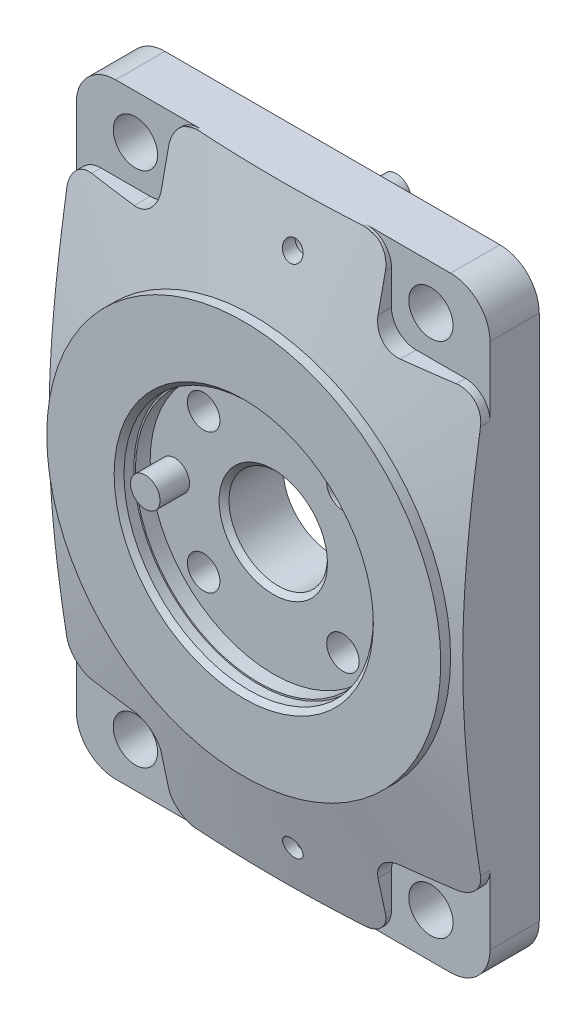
ISO-10303-21;
HEADER;
FILE_DESCRIPTION(('STEP AP214'),'2;1');
FILE_NAME('part.step','',(''),(''),'','','');
FILE_SCHEMA(('AUTOMOTIVE_DESIGN { 1 0 10303 214 1 1 1 1 }'));
ENDSEC;
DATA;
#1=APPLICATION_CONTEXT('core data for automotive mechanical design processes');
#2=APPLICATION_PROTOCOL_DEFINITION('international standard','automotive_design',2000,#1);
#3=PRODUCT_CONTEXT('',#1,'mechanical');
#4=PRODUCT('Part','Part','',(#3));
#5=PRODUCT_RELATED_PRODUCT_CATEGORY('part','',(#4));
#6=PRODUCT_DEFINITION_FORMATION('','',#4);
#7=PRODUCT_DEFINITION_CONTEXT('part definition',#1,'design');
#8=PRODUCT_DEFINITION('design','',#6,#7);
#9=PRODUCT_DEFINITION_SHAPE('','',#8);
#10=(LENGTH_UNIT() NAMED_UNIT(*) SI_UNIT(.MILLI.,.METRE.));
#11=(NAMED_UNIT(*) PLANE_ANGLE_UNIT() SI_UNIT($,.RADIAN.));
#12=(NAMED_UNIT(*) SI_UNIT($,.STERADIAN.) SOLID_ANGLE_UNIT());
#13=UNCERTAINTY_MEASURE_WITH_UNIT(LENGTH_MEASURE(1.E-05),#10,'distance_accuracy_value','');
#14=(GEOMETRIC_REPRESENTATION_CONTEXT(3) GLOBAL_UNCERTAINTY_ASSIGNED_CONTEXT((#13)) GLOBAL_UNIT_ASSIGNED_CONTEXT((#10,
#11,#12)) REPRESENTATION_CONTEXT('',''));
#15=CARTESIAN_POINT('',(0.,0.,0.));
#16=DIRECTION('',(0.,0.,1.));
#17=DIRECTION('',(1.,0.,0.));
#18=AXIS2_PLACEMENT_3D('',#15,#16,#17);
#19=CARTESIAN_POINT('',(0.,0.,0.));
#20=DIRECTION('',(0.,0.,1.));
#21=DIRECTION('',(1.,0.,0.));
#22=AXIS2_PLACEMENT_3D('',#19,#20,#21);
#23=PLANE('',#22);
#24=CARTESIAN_POINT('',(-30.,-52.5,1.04744440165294E-13));
#25=DIRECTION('',(0.,0.,1.));
#26=DIRECTION('',(1.,0.,0.));
#27=AXIS2_PLACEMENT_3D('',#24,#25,#26);
#28=CIRCLE('',#27,4.5);
#29=CARTESIAN_POINT('',(-25.5,-52.5,0.));
#30=VERTEX_POINT('',#29);
#31=EDGE_CURVE('E1302',#30,#30,#28,.F.);
#32=ORIENTED_EDGE('',*,*,#31,.F.);
#33=EDGE_LOOP('',(#32));
#34=FACE_BOUND('',#33,.T.);
#35=CARTESIAN_POINT('',(30.,-52.5,-1.04744440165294E-13));
#36=DIRECTION('',(0.,0.,1.));
#37=DIRECTION('',(1.,0.,0.));
#38=AXIS2_PLACEMENT_3D('',#35,#36,#37);
#39=CIRCLE('',#38,4.5);
#40=CARTESIAN_POINT('',(34.5,-52.5,-1.20456106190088E-13));
#41=VERTEX_POINT('',#40);
#42=EDGE_CURVE('E1299',#41,#41,#39,.F.);
#43=ORIENTED_EDGE('',*,*,#42,.F.);
#44=EDGE_LOOP('',(#43));
#45=FACE_BOUND('',#44,.T.);
#46=CARTESIAN_POINT('',(30.,52.5,-1.04744440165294E-13));
#47=DIRECTION('',(0.,0.,1.));
#48=DIRECTION('',(1.,0.,0.));
#49=AXIS2_PLACEMENT_3D('',#46,#47,#48);
#50=CIRCLE('',#49,4.5);
#51=CARTESIAN_POINT('',(34.5,52.5,-1.20456106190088E-13));
#52=VERTEX_POINT('',#51);
#53=EDGE_CURVE('E1296',#52,#52,#50,.F.);
#54=ORIENTED_EDGE('',*,*,#53,.F.);
#55=EDGE_LOOP('',(#54));
#56=FACE_BOUND('',#55,.T.);
#57=CARTESIAN_POINT('',(-30.,52.5,1.04744440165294E-13));
#58=DIRECTION('',(0.,0.,1.));
#59=DIRECTION('',(1.,0.,0.));
#60=AXIS2_PLACEMENT_3D('',#57,#58,#59);
#61=CIRCLE('',#60,4.5);
#62=CARTESIAN_POINT('',(-25.5,52.5,0.));
#63=VERTEX_POINT('',#62);
#64=EDGE_CURVE('E1293',#63,#63,#61,.F.);
#65=ORIENTED_EDGE('',*,*,#64,.F.);
#66=EDGE_LOOP('',(#65));
#67=FACE_BOUND('',#66,.T.);
#68=CARTESIAN_POINT('',(4.99999999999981,52.5,0.));
#69=DIRECTION('',(0.,0.,-1.));
#70=DIRECTION('',(-1.,0.,0.));
#71=AXIS2_PLACEMENT_3D('',#68,#69,#70);
#72=CIRCLE('',#71,3.);
#73=CARTESIAN_POINT('',(1.99999999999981,52.5,0.));
#74=VERTEX_POINT('',#73);
#75=EDGE_CURVE('E1290',#74,#74,#72,.T.);
#76=ORIENTED_EDGE('',*,*,#75,.F.);
#77=EDGE_LOOP('',(#76));
#78=FACE_BOUND('',#77,.T.);
#79=CARTESIAN_POINT('',(5.00000000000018,-52.5,0.));
#80=DIRECTION('',(0.,0.,-1.));
#81=DIRECTION('',(-1.,0.,0.));
#82=AXIS2_PLACEMENT_3D('',#79,#80,#81);
#83=CIRCLE('',#82,3.);
#84=CARTESIAN_POINT('',(2.00000000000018,-52.5,0.));
#85=VERTEX_POINT('',#84);
#86=EDGE_CURVE('E1287',#85,#85,#83,.T.);
#87=ORIENTED_EDGE('',*,*,#86,.F.);
#88=EDGE_LOOP('',(#87));
#89=FACE_BOUND('',#88,.T.);
#90=CARTESIAN_POINT('',(-20.,0.,0.));
#91=DIRECTION('',(0.,0.,1.));
#92=DIRECTION('',(1.,0.,0.));
#93=AXIS2_PLACEMENT_3D('',#90,#91,#92);
#94=CIRCLE('',#93,2.);
#95=CARTESIAN_POINT('',(-18.,0.,0.));
#96=VERTEX_POINT('',#95);
#97=EDGE_CURVE('E1284',#96,#96,#94,.F.);
#98=ORIENTED_EDGE('',*,*,#97,.F.);
#99=EDGE_LOOP('',(#98));
#100=FACE_BOUND('',#99,.T.);
#101=CARTESIAN_POINT('',(-14.1421356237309,-14.142135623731,0.));
#102=DIRECTION('',(0.,0.,-1.));
#103=DIRECTION('',(-1.,0.,0.));
#104=AXIS2_PLACEMENT_3D('',#101,#102,#103);
#105=CIRCLE('',#104,5.5);
#106=CARTESIAN_POINT('',(-19.6421356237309,-14.142135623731,0.));
#107=VERTEX_POINT('',#106);
#108=EDGE_CURVE('E1281',#107,#107,#105,.T.);
#109=ORIENTED_EDGE('',*,*,#108,.F.);
#110=EDGE_LOOP('',(#109));
#111=FACE_BOUND('',#110,.T.);
#112=CARTESIAN_POINT('',(14.1421356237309,-14.1421356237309,0.));
#113=DIRECTION('',(0.,0.,-1.));
#114=DIRECTION('',(-1.,0.,0.));
#115=AXIS2_PLACEMENT_3D('',#112,#113,#114);
#116=CIRCLE('',#115,5.5);
#117=CARTESIAN_POINT('',(8.64213562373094,-14.1421356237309,0.));
#118=VERTEX_POINT('',#117);
#119=EDGE_CURVE('E1273',#118,#118,#116,.T.);
#120=ORIENTED_EDGE('',*,*,#119,.F.);
#121=EDGE_LOOP('',(#120));
#122=FACE_BOUND('',#121,.T.);
#123=CARTESIAN_POINT('',(-14.142135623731,14.1421356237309,0.));
#124=DIRECTION('',(0.,0.,-1.));
#125=DIRECTION('',(-1.,0.,0.));
#126=AXIS2_PLACEMENT_3D('',#123,#124,#125);
#127=CIRCLE('',#126,5.5);
#128=CARTESIAN_POINT('',(-19.642135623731,14.1421356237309,0.));
#129=VERTEX_POINT('',#128);
#130=EDGE_CURVE('E1267',#129,#129,#127,.T.);
#131=ORIENTED_EDGE('',*,*,#130,.F.);
#132=EDGE_LOOP('',(#131));
#133=FACE_BOUND('',#132,.T.);
#134=CARTESIAN_POINT('',(14.1421356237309,14.1421356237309,0.));
#135=DIRECTION('',(0.,0.,-1.));
#136=DIRECTION('',(-1.,0.,0.));
#137=AXIS2_PLACEMENT_3D('',#134,#135,#136);
#138=CIRCLE('',#137,5.5);
#139=CARTESIAN_POINT('',(8.64213562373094,14.1421356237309,0.));
#140=VERTEX_POINT('',#139);
#141=EDGE_CURVE('E1264',#140,#140,#138,.T.);
#142=ORIENTED_EDGE('',*,*,#141,.F.);
#143=EDGE_LOOP('',(#142));
#144=FACE_BOUND('',#143,.T.);
#145=CARTESIAN_POINT('',(-34.,53.5,1.18710365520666E-13));
#146=DIRECTION('',(0.,0.,1.));
#147=DIRECTION('',(1.,0.,0.));
#148=AXIS2_PLACEMENT_3D('',#145,#146,#147);
#149=CIRCLE('',#148,8.);
#150=CARTESIAN_POINT('',(-34.,61.5,1.18710365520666E-13));
#151=VERTEX_POINT('',#150);
#152=CARTESIAN_POINT('',(-42.,53.5,1.46642216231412E-13));
#153=VERTEX_POINT('',#152);
#154=EDGE_CURVE('E39',#151,#153,#149,.T.);
#155=ORIENTED_EDGE('',*,*,#154,.F.);
#156=DIRECTION('',(1.,0.,0.));
#157=VECTOR('',#156,1.);
#158=CARTESIAN_POINT('',(-2.07787208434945E-13,61.5,0.));
#159=LINE('',#158,#157);
#160=CARTESIAN_POINT('',(34.,61.5,-1.18710365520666E-13));
#161=VERTEX_POINT('',#160);
#162=EDGE_CURVE('E32',#151,#161,#159,.T.);
#163=ORIENTED_EDGE('',*,*,#162,.T.);
#164=CARTESIAN_POINT('',(34.,53.5,-1.18710365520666E-13));
#165=DIRECTION('',(0.,0.,1.));
#166=DIRECTION('',(1.,0.,0.));
#167=AXIS2_PLACEMENT_3D('',#164,#165,#166);
#168=CIRCLE('',#167,8.);
#169=CARTESIAN_POINT('',(42.,53.5,-1.46642216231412E-13));
#170=VERTEX_POINT('',#169);
#171=EDGE_CURVE('E1453',#170,#161,#168,.T.);
#172=ORIENTED_EDGE('',*,*,#171,.F.);
#173=DIRECTION('',(0.,-1.,0.));
#174=VECTOR('',#173,1.);
#175=CARTESIAN_POINT('',(42.,1.43172769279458E-13,-1.46642216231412E-13));
#176=LINE('',#175,#174);
#177=CARTESIAN_POINT('',(42.,-53.5,-1.46642216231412E-13));
#178=VERTEX_POINT('',#177);
#179=EDGE_CURVE('E1457',#170,#178,#176,.T.);
#180=ORIENTED_EDGE('',*,*,#179,.T.);
#181=CARTESIAN_POINT('',(34.,-53.5,-1.18710365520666E-13));
#182=DIRECTION('',(0.,0.,1.));
#183=DIRECTION('',(1.,0.,0.));
#184=AXIS2_PLACEMENT_3D('',#181,#182,#183);
#185=CIRCLE('',#184,8.);
#186=CARTESIAN_POINT('',(34.,-61.5,-1.18710365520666E-13));
#187=VERTEX_POINT('',#186);
#188=EDGE_CURVE('E1749',#187,#178,#185,.T.);
#189=ORIENTED_EDGE('',*,*,#188,.F.);
#190=DIRECTION('',(-1.,0.,0.));
#191=VECTOR('',#190,1.);
#192=CARTESIAN_POINT('',(2.2166499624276E-13,-61.5,0.));
#193=LINE('',#192,#191);
#194=CARTESIAN_POINT('',(-34.,-61.5,1.18710365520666E-13));
#195=VERTEX_POINT('',#194);
#196=EDGE_CURVE('E1745',#187,#195,#193,.T.);
#197=ORIENTED_EDGE('',*,*,#196,.T.);
#198=CARTESIAN_POINT('',(-34.,-53.5,1.18710365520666E-13));
#199=DIRECTION('',(0.,0.,1.));
#200=DIRECTION('',(1.,0.,0.));
#201=AXIS2_PLACEMENT_3D('',#198,#199,#200);
#202=CIRCLE('',#201,8.);
#203=CARTESIAN_POINT('',(-42.,-53.5,1.46642216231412E-13));
#204=VERTEX_POINT('',#203);
#205=EDGE_CURVE('E1748',#204,#195,#202,.T.);
#206=ORIENTED_EDGE('',*,*,#205,.F.);
#207=DIRECTION('',(0.,1.,0.));
#208=VECTOR('',#207,1.);
#209=CARTESIAN_POINT('',(-42.,-1.50111663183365E-13,1.46642216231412E-13));
#210=LINE('',#209,#208);
#211=EDGE_CURVE('E1751',#204,#153,#210,.T.);
#212=ORIENTED_EDGE('',*,*,#211,.T.);
#213=EDGE_LOOP('',(#155,#163,#172,#180,#189,#197,#206,#212));
#214=FACE_BOUND('',#213,.T.);
#215=CARTESIAN_POINT('',(0.,0.,0.));
#216=DIRECTION('',(0.,0.,1.));
#217=DIRECTION('',(1.,0.,0.));
#218=AXIS2_PLACEMENT_3D('',#215,#216,#217);
#219=CIRCLE('',#218,10.);
#220=CARTESIAN_POINT('',(10.,0.,0.));
#221=VERTEX_POINT('',#220);
#222=EDGE_CURVE('E11',#221,#221,#219,.T.);
#223=ORIENTED_EDGE('',*,*,#222,.T.);
#224=EDGE_LOOP('',(#223));
#225=FACE_BOUND('',#224,.T.);
#226=ADVANCED_FACE('F17',(#34,#45,#56,#67,#78,#89,#100,#111,#122,#133,#144,#214,#225),#23,.F.);
#227=CARTESIAN_POINT('',(-20.,-2.67846096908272,18.));
#228=DIRECTION('',(0.,0.,-1.));
#229=DIRECTION('',(0.,1.,0.));
#230=AXIS2_PLACEMENT_3D('',#227,#228,#229);
#231=PLANE('',#230);
#232=CARTESIAN_POINT('',(-20.,0.,18.));
#233=DIRECTION('',(0.,0.,-1.));
#234=DIRECTION('',(0.,1.,0.));
#235=AXIS2_PLACEMENT_3D('',#232,#233,#234);
#236=CIRCLE('',#235,3.);
#237=CARTESIAN_POINT('',(-20.,2.99999999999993,18.));
#238=VERTEX_POINT('',#237);
#239=EDGE_CURVE('E25',#238,#238,#236,.T.);
#240=ORIENTED_EDGE('',*,*,#239,.F.);
#241=EDGE_LOOP('',(#240));
#242=FACE_BOUND('',#241,.T.);
#243=ADVANCED_FACE('F487',(#242),#231,.F.);
#244=CARTESIAN_POINT('',(-20.,0.,18.));
#245=DIRECTION('',(0.,0.,-1.));
#246=DIRECTION('',(-1.,0.,0.));
#247=AXIS2_PLACEMENT_3D('',#244,#245,#246);
#248=CYLINDRICAL_SURFACE('',#247,3.);
#249=CARTESIAN_POINT('',(-20.,0.,12.0000000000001));
#250=DIRECTION('',(0.,0.,-1.));
#251=DIRECTION('',(-1.,0.,0.));
#252=AXIS2_PLACEMENT_3D('',#249,#250,#251);
#253=CIRCLE('',#252,3.);
#254=CARTESIAN_POINT('',(-23.,0.,12.0000000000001));
#255=VERTEX_POINT('',#254);
#256=EDGE_CURVE('E1417',#255,#255,#253,.T.);
#257=ORIENTED_EDGE('',*,*,#256,.F.);
#258=EDGE_LOOP('',(#257));
#259=FACE_BOUND('',#258,.T.);
#260=ORIENTED_EDGE('',*,*,#239,.T.);
#261=EDGE_LOOP('',(#260));
#262=FACE_BOUND('',#261,.T.);
#263=ADVANCED_FACE('F476',(#259,#262),#248,.T.);
#264=CARTESIAN_POINT('',(4.9999999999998,49.8215390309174,-8.));
#265=DIRECTION('',(0.,0.,1.));
#266=DIRECTION('',(0.,-1.,0.));
#267=AXIS2_PLACEMENT_3D('',#264,#265,#266);
#268=PLANE('',#267);
#269=CARTESIAN_POINT('',(4.99999999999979,52.5,-8.));
#270=DIRECTION('',(0.,0.,1.));
#271=DIRECTION('',(0.,-1.,0.));
#272=AXIS2_PLACEMENT_3D('',#269,#270,#271);
#273=CIRCLE('',#272,3.);
#274=CARTESIAN_POINT('',(4.9999999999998,49.5,-8.));
#275=VERTEX_POINT('',#274);
#276=EDGE_CURVE('E1762',#275,#275,#273,.T.);
#277=ORIENTED_EDGE('',*,*,#276,.F.);
#278=EDGE_LOOP('',(#277));
#279=FACE_BOUND('',#278,.T.);
#280=ADVANCED_FACE('F473',(#279),#268,.F.);
#281=CARTESIAN_POINT('',(4.99999999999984,52.5,8.));
#282=DIRECTION('',(0.,0.,-1.));
#283=DIRECTION('',(-1.,0.,0.));
#284=AXIS2_PLACEMENT_3D('',#281,#282,#283);
#285=CYLINDRICAL_SURFACE('',#284,3.);
#286=ORIENTED_EDGE('',*,*,#75,.T.);
#287=EDGE_LOOP('',(#286));
#288=FACE_BOUND('',#287,.T.);
#289=ORIENTED_EDGE('',*,*,#276,.T.);
#290=EDGE_LOOP('',(#289));
#291=FACE_BOUND('',#290,.T.);
#292=ADVANCED_FACE('F468',(#288,#291),#285,.T.);
#293=CARTESIAN_POINT('',(5.00000000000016,-55.1784609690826,-8.));
#294=DIRECTION('',(0.,0.,1.));
#295=DIRECTION('',(0.,-1.,0.));
#296=AXIS2_PLACEMENT_3D('',#293,#294,#295);
#297=PLANE('',#296);
#298=CARTESIAN_POINT('',(5.00000000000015,-52.5,-8.));
#299=DIRECTION('',(0.,0.,1.));
#300=DIRECTION('',(0.,-1.,0.));
#301=AXIS2_PLACEMENT_3D('',#298,#299,#300);
#302=CIRCLE('',#301,3.);
#303=CARTESIAN_POINT('',(5.00000000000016,-55.5,-8.));
#304=VERTEX_POINT('',#303);
#305=EDGE_CURVE('E1759',#304,#304,#302,.T.);
#306=ORIENTED_EDGE('',*,*,#305,.F.);
#307=EDGE_LOOP('',(#306));
#308=FACE_BOUND('',#307,.T.);
#309=ADVANCED_FACE('F464',(#308),#297,.F.);
#310=CARTESIAN_POINT('',(5.00000000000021,-52.5,8.));
#311=DIRECTION('',(0.,0.,-1.));
#312=DIRECTION('',(-1.,0.,0.));
#313=AXIS2_PLACEMENT_3D('',#310,#311,#312);
#314=CYLINDRICAL_SURFACE('',#313,3.);
#315=ORIENTED_EDGE('',*,*,#86,.T.);
#316=EDGE_LOOP('',(#315));
#317=FACE_BOUND('',#316,.T.);
#318=ORIENTED_EDGE('',*,*,#305,.T.);
#319=EDGE_LOOP('',(#318));
#320=FACE_BOUND('',#319,.T.);
#321=ADVANCED_FACE('F467',(#317,#320),#314,.T.);
#322=CARTESIAN_POINT('',(-42.,61.5,18.));
#323=DIRECTION('',(0.,-1.,0.));
#324=DIRECTION('',(1.,0.,0.));
#325=AXIS2_PLACEMENT_3D('',#322,#323,#324);
#326=PLANE('',#325);
#327=ORIENTED_EDGE('',*,*,#162,.F.);
#328=DIRECTION('',(0.,0.,-1.));
#329=VECTOR('',#328,1.);
#330=CARTESIAN_POINT('',(-34.,61.5,18.));
#331=LINE('',#330,#329);
#332=CARTESIAN_POINT('',(-34.,61.5,10.0000000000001));
#333=VERTEX_POINT('',#332);
#334=EDGE_CURVE('E1342',#333,#151,#331,.T.);
#335=ORIENTED_EDGE('',*,*,#334,.F.);
#336=DIRECTION('',(1.,0.,0.));
#337=VECTOR('',#336,1.);
#338=CARTESIAN_POINT('',(-42.,61.5,10.0000000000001));
#339=LINE('',#338,#337);
#340=CARTESIAN_POINT('',(-17.,61.5,10.));
#341=VERTEX_POINT('',#340);
#342=EDGE_CURVE('E1556',#341,#333,#339,.F.);
#343=ORIENTED_EDGE('',*,*,#342,.F.);
#344=DIRECTION('',(0.,0.,1.));
#345=VECTOR('',#344,1.);
#346=CARTESIAN_POINT('',(-17.,61.5,18.));
#347=LINE('',#346,#345);
#348=CARTESIAN_POINT('',(-17.,61.5,10.5038715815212));
#349=VERTEX_POINT('',#348);
#350=EDGE_CURVE('E1399',#349,#341,#347,.F.);
#351=ORIENTED_EDGE('',*,*,#350,.F.);
#352=CARTESIAN_POINT('',(-47.9581979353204,61.5,7.22961544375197));
#353=CARTESIAN_POINT('',(-46.6130814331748,61.5,7.42056771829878));
#354=CARTESIAN_POINT('',(-45.2672656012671,61.5,7.60664948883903));
#355=CARTESIAN_POINT('',(-42.5741567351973,61.5,7.96800053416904));
#356=CARTESIAN_POINT('',(-41.2268636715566,61.5,8.14326958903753));
#357=CARTESIAN_POINT('',(-38.5304717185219,61.5,8.48195414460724));
#358=CARTESIAN_POINT('',(-37.1813724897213,61.5,8.64536695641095));
#359=CARTESIAN_POINT('',(-34.481671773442,61.5,8.95913413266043));
#360=CARTESIAN_POINT('',(-33.1310702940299,61.5,9.10948856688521));
#361=CARTESIAN_POINT('',(-29.0846823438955,61.5,9.53834191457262));
#362=CARTESIAN_POINT('',(-26.3865749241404,61.5000000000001,9.79561623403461));
#363=CARTESIAN_POINT('',(-22.3354217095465,61.5000000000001,10.1317608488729));
#364=CARTESIAN_POINT('',(-20.9844062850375,61.5000000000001,10.23551257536));
#365=CARTESIAN_POINT('',(-18.2811358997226,61.5000000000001,10.4253071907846));
#366=CARTESIAN_POINT('',(-16.9288809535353,61.5000000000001,10.5113502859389));
#367=CARTESIAN_POINT('',(-14.2220354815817,61.5000000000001,10.6647799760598));
#368=CARTESIAN_POINT('',(-12.867443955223,61.5000000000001,10.7321489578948));
#369=CARTESIAN_POINT('',(-10.1574229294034,61.5000000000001,10.8472681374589));
#370=CARTESIAN_POINT('',(-8.80199342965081,61.5000000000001,10.8950183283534));
#371=CARTESIAN_POINT('',(-6.09053122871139,61.5000000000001,10.9702619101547));
#372=CARTESIAN_POINT('',(-4.73449851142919,61.5000000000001,10.9977547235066));
#373=CARTESIAN_POINT('',(-2.02217238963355,61.5000000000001,11.0321008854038));
#374=CARTESIAN_POINT('',(-0.665878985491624,61.5000000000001,11.0389542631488));
#375=CARTESIAN_POINT('',(2.0504160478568,61.5000000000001,11.0319145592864));
#376=CARTESIAN_POINT('',(3.41041752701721,61.5000000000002,11.0179638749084));
#377=CARTESIAN_POINT('',(6.13005832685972,61.5000000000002,10.9694101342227));
#378=CARTESIAN_POINT('',(7.48969764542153,61.5000000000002,10.9348069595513));
#379=CARTESIAN_POINT('',(10.2083489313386,61.5000000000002,10.8454125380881));
#380=CARTESIAN_POINT('',(11.5673608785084,61.5000000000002,10.790620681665));
#381=CARTESIAN_POINT('',(14.2844438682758,61.5000000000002,10.6616180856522));
#382=CARTESIAN_POINT('',(15.6425149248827,61.5000000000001,10.5874076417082));
#383=CARTESIAN_POINT('',(17.,61.5,10.5038715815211));
#384=B_SPLINE_CURVE_WITH_KNOTS('',3,(#352,#353,#354,#355,#356,#357,#358,#359,#360,#361,#362,
#363,#364,#365,#366,#367,#368,#369,#370,#371,#372,#373,#374,#375,#376,#377,#378,#379,#380,#381,
#382,#383),.UNSPECIFIED.,.F.,.F.,(4,2,2,2,2,2,2,2,2,2,2,2,2,2,2,4),(0.,4.07580995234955,
8.15170277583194,12.228517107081,16.3053096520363,24.4354988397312,28.5003871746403,
32.5652281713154,36.6338901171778,40.7025534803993,44.7713328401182,48.8401064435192,
52.9201666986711,57.0002503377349,61.0804571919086,65.1606019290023),.UNSPECIFIED.);
#385=CARTESIAN_POINT('',(17.,61.5,10.5038715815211));
#386=VERTEX_POINT('',#385);
#387=EDGE_CURVE('E407',#386,#349,#384,.F.);
#388=ORIENTED_EDGE('',*,*,#387,.F.);
#389=DIRECTION('',(0.,0.,1.));
#390=VECTOR('',#389,1.);
#391=CARTESIAN_POINT('',(16.9999999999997,61.5,-26.2488094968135));
#392=LINE('',#391,#390);
#393=CARTESIAN_POINT('',(17.,61.5,10.));
#394=VERTEX_POINT('',#393);
#395=EDGE_CURVE('E1404',#394,#386,#392,.T.);
#396=ORIENTED_EDGE('',*,*,#395,.F.);
#397=DIRECTION('',(1.,0.,0.));
#398=VECTOR('',#397,1.);
#399=CARTESIAN_POINT('',(-42.,61.5,10.0000000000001));
#400=LINE('',#399,#398);
#401=CARTESIAN_POINT('',(34.,61.5,9.99999999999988));
#402=VERTEX_POINT('',#401);
#403=EDGE_CURVE('E1570',#402,#394,#400,.F.);
#404=ORIENTED_EDGE('',*,*,#403,.F.);
#405=DIRECTION('',(0.,0.,1.));
#406=VECTOR('',#405,1.);
#407=CARTESIAN_POINT('',(34.,61.5,18.));
#408=LINE('',#407,#406);
#409=EDGE_CURVE('E1347',#161,#402,#408,.T.);
#410=ORIENTED_EDGE('',*,*,#409,.F.);
#411=EDGE_LOOP('',(#327,#335,#343,#351,#388,#396,#404,#410));
#412=FACE_BOUND('',#411,.T.);
#413=ADVANCED_FACE('F463',(#412),#326,.F.);
#414=CARTESIAN_POINT('',(-34.,53.5,18.));
#415=DIRECTION('',(0.,0.,-1.));
#416=DIRECTION('',(-1.,0.,0.));
#417=AXIS2_PLACEMENT_3D('',#414,#415,#416);
#418=CYLINDRICAL_SURFACE('',#417,8.);
#419=ORIENTED_EDGE('',*,*,#334,.T.);
#420=ORIENTED_EDGE('',*,*,#154,.T.);
#421=DIRECTION('',(0.,0.,1.));
#422=VECTOR('',#421,1.);
#423=CARTESIAN_POINT('',(-42.,53.5,18.));
#424=LINE('',#423,#422);
#425=CARTESIAN_POINT('',(-42.,53.5,10.0000000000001));
#426=VERTEX_POINT('',#425);
#427=EDGE_CURVE('E1343',#153,#426,#424,.T.);
#428=ORIENTED_EDGE('',*,*,#427,.T.);
#429=CARTESIAN_POINT('',(-34.,53.5,10.0000000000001));
#430=DIRECTION('',(0.,0.,-1.));
#431=DIRECTION('',(-1.,0.,0.));
#432=AXIS2_PLACEMENT_3D('',#429,#430,#431);
#433=CIRCLE('',#432,8.);
#434=EDGE_CURVE('E1339',#426,#333,#433,.T.);
#435=ORIENTED_EDGE('',*,*,#434,.T.);
#436=EDGE_LOOP('',(#419,#420,#428,#435));
#437=FACE_BOUND('',#436,.T.);
#438=ADVANCED_FACE('F460',(#437),#418,.T.);
#439=CARTESIAN_POINT('',(-42.,-61.5,18.));
#440=DIRECTION('',(1.,0.,0.));
#441=DIRECTION('',(0.,1.,0.));
#442=AXIS2_PLACEMENT_3D('',#439,#440,#441);
#443=PLANE('',#442);
#444=ORIENTED_EDGE('',*,*,#211,.F.);
#445=DIRECTION('',(0.,0.,-1.));
#446=VECTOR('',#445,1.);
#447=CARTESIAN_POINT('',(-42.,-53.5,18.));
#448=LINE('',#447,#446);
#449=CARTESIAN_POINT('',(-42.,-53.5,10.0000000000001));
#450=VERTEX_POINT('',#449);
#451=EDGE_CURVE('E1305',#450,#204,#448,.T.);
#452=ORIENTED_EDGE('',*,*,#451,.F.);
#453=DIRECTION('',(0.,1.,0.));
#454=VECTOR('',#453,1.);
#455=CARTESIAN_POINT('',(-42.,-61.5,10.0000000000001));
#456=LINE('',#455,#454);
#457=CARTESIAN_POINT('',(-42.,-39.5,10.0000000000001));
#458=VERTEX_POINT('',#457);
#459=EDGE_CURVE('E275',#458,#450,#456,.F.);
#460=ORIENTED_EDGE('',*,*,#459,.F.);
#461=DIRECTION('',(0.,0.,1.));
#462=VECTOR('',#461,1.);
#463=CARTESIAN_POINT('',(-42.,-39.5,18.));
#464=LINE('',#463,#462);
#465=CARTESIAN_POINT('',(-42.,-39.5,11.9237198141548));
#466=VERTEX_POINT('',#465);
#467=EDGE_CURVE('E270',#466,#458,#464,.F.);
#468=ORIENTED_EDGE('',*,*,#467,.F.);
#469=CARTESIAN_POINT('',(-42.,39.5000000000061,11.9237198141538));
#470=CARTESIAN_POINT('',(-42.0000000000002,38.281223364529,12.1164583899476));
#471=CARTESIAN_POINT('',(-42.0000000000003,37.061714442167,12.3046391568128));
#472=CARTESIAN_POINT('',(-42.0000000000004,34.6210682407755,12.6704218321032));
#473=CARTESIAN_POINT('',(-42.0000000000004,33.3999309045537,12.8480233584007));
#474=CARTESIAN_POINT('',(-42.0000000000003,30.955378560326,13.1912507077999));
#475=CARTESIAN_POINT('',(-42.0000000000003,29.7319627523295,13.3568708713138));
#476=CARTESIAN_POINT('',(-42.0000000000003,27.2833695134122,13.6743479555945));
#477=CARTESIAN_POINT('',(-42.0000000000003,26.0581920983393,13.8262049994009));
#478=CARTESIAN_POINT('',(-42.0000000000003,22.3785381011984,14.258557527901));
#479=CARTESIAN_POINT('',(-42.0000000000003,19.9211989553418,14.5156538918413));
#480=CARTESIAN_POINT('',(-42.0000000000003,16.2302249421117,14.8427599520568));
#481=CARTESIAN_POINT('',(-42.0000000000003,14.9991469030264,14.9420346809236));
#482=CARTESIAN_POINT('',(-42.0000000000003,12.5354364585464,15.1192036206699));
#483=CARTESIAN_POINT('',(-42.0000000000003,11.3028040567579,15.1970978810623));
#484=CARTESIAN_POINT('',(-42.0000000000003,8.84936040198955,15.329154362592));
#485=CARTESIAN_POINT('',(-42.0000000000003,7.62856227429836,15.3835592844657));
#486=CARTESIAN_POINT('',(-42.0000000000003,5.18613250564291,15.4685971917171));
#487=CARTESIAN_POINT('',(-42.0000000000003,3.96450086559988,15.4992302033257));
#488=CARTESIAN_POINT('',(-42.0000000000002,1.52083581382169,15.5359923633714));
#489=CARTESIAN_POINT('',(-42.0000000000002,0.298802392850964,15.5421209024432));
#490=CARTESIAN_POINT('',(-42.0000000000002,-2.14513758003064,15.5297222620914));
#491=CARTESIAN_POINT('',(-42.0000000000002,-3.36704413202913,15.5111950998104));
#492=CARTESIAN_POINT('',(-42.0000000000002,-5.80948471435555,15.4499544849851));
#493=CARTESIAN_POINT('',(-42.0000000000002,-7.03001912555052,15.4072561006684));
#494=CARTESIAN_POINT('',(-42.0000000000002,-9.47005479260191,15.2986785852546));
#495=CARTESIAN_POINT('',(-42.0000000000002,-10.689556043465,15.2327993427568));
#496=CARTESIAN_POINT('',(-42.0000000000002,-13.1271535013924,15.0792903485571));
#497=CARTESIAN_POINT('',(-42.0000000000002,-14.345249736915,14.9916610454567));
#498=CARTESIAN_POINT('',(-42.0000000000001,-16.7798351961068,14.7963710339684));
#499=CARTESIAN_POINT('',(-42.,-17.9963244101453,14.6887102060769));
#500=CARTESIAN_POINT('',(-42.,-20.0590174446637,14.4906206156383));
#501=CARTESIAN_POINT('',(-42.0000000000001,-20.9056745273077,14.4048624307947));
#502=CARTESIAN_POINT('',(-42.0000000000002,-22.5980787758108,14.2251739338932));
#503=CARTESIAN_POINT('',(-42.0000000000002,-23.4438259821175,14.1312440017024));
#504=CARTESIAN_POINT('',(-42.0000000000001,-25.9798064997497,13.8381444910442));
#505=CARTESIAN_POINT('',(-42.0000000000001,-27.6687429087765,13.6276686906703));
#506=CARTESIAN_POINT('',(-42.0000000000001,-30.2029833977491,13.2924829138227));
#507=CARTESIAN_POINT('',(-42.0000000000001,-31.0495657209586,13.177258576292));
#508=CARTESIAN_POINT('',(-42.0000000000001,-32.7419151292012,12.9409612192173));
#509=CARTESIAN_POINT('',(-42.0000000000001,-33.5876822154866,12.8198882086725));
#510=CARTESIAN_POINT('',(-42.0000000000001,-35.2783060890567,12.5724304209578));
#511=CARTESIAN_POINT('',(-42.0000000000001,-36.1231629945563,12.4460464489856));
#512=CARTESIAN_POINT('',(-42.0000000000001,-37.8121300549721,12.1884148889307));
#513=CARTESIAN_POINT('',(-42.0000000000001,-38.6562402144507,12.0571673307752));
#514=CARTESIAN_POINT('',(-42.,-39.5,11.9237198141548));
#515=B_SPLINE_CURVE_WITH_KNOTS('',3,(#469,#470,#471,#472,#473,#474,#475,#476,#477,#478,#479,
#480,#481,#482,#483,#484,#485,#486,#487,#488,#489,#490,#491,#492,#493,#494,#495,#496,#497,#498,
#499,#500,#501,#502,#503,#504,#505,#506,#507,#508,#509,#510,#511,#512,#513,#514),.UNSPECIFIED.,
.F.,.F.,(4,2,2,2,2,2,2,2,2,2,2,2,2,2,2,2,2,2,2,2,2,2,4),(0.,3.70177456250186,7.40368275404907,
11.1073283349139,14.8109408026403,22.221981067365,25.9270556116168,29.632121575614,
33.297931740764,36.9637378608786,40.6296351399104,44.2955298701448,47.9591418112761,
51.6227713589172,55.2863253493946,58.9499011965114,61.5028292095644,64.0556386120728,
69.1613653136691,71.7245151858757,74.2876611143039,76.8504198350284,79.4131627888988),.UNSPECIFIED.);
#516=CARTESIAN_POINT('',(-42.,39.5000000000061,11.9237198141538));
#517=VERTEX_POINT('',#516);
#518=EDGE_CURVE('E415',#517,#466,#515,.T.);
#519=ORIENTED_EDGE('',*,*,#518,.F.);
#520=DIRECTION('',(0.,0.,1.));
#521=VECTOR('',#520,1.);
#522=CARTESIAN_POINT('',(-42.,39.5,18.));
#523=LINE('',#522,#521);
#524=CARTESIAN_POINT('',(-42.,39.5,10.0000000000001));
#525=VERTEX_POINT('',#524);
#526=EDGE_CURVE('E1552',#525,#517,#523,.T.);
#527=ORIENTED_EDGE('',*,*,#526,.F.);
#528=DIRECTION('',(0.,1.,0.));
#529=VECTOR('',#528,1.);
#530=CARTESIAN_POINT('',(-42.,-61.5,10.0000000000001));
#531=LINE('',#530,#529);
#532=EDGE_CURVE('E1717',#426,#525,#531,.F.);
#533=ORIENTED_EDGE('',*,*,#532,.F.);
#534=ORIENTED_EDGE('',*,*,#427,.F.);
#535=EDGE_LOOP('',(#444,#452,#460,#468,#519,#527,#533,#534));
#536=FACE_BOUND('',#535,.T.);
#537=ADVANCED_FACE('F442',(#536),#443,.F.);
#538=CARTESIAN_POINT('',(-34.,-53.5,18.));
#539=DIRECTION('',(0.,0.,-1.));
#540=DIRECTION('',(-1.,0.,0.));
#541=AXIS2_PLACEMENT_3D('',#538,#539,#540);
#542=CYLINDRICAL_SURFACE('',#541,8.);
#543=ORIENTED_EDGE('',*,*,#451,.T.);
#544=ORIENTED_EDGE('',*,*,#205,.T.);
#545=DIRECTION('',(0.,0.,-1.));
#546=VECTOR('',#545,1.);
#547=CARTESIAN_POINT('',(-34.,-61.5,18.));
#548=LINE('',#547,#546);
#549=CARTESIAN_POINT('',(-34.,-61.5,10.0000000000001));
#550=VERTEX_POINT('',#549);
#551=EDGE_CURVE('E1338',#195,#550,#548,.F.);
#552=ORIENTED_EDGE('',*,*,#551,.T.);
#553=CARTESIAN_POINT('',(-34.,-53.5,10.0000000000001));
#554=DIRECTION('',(0.,0.,-1.));
#555=DIRECTION('',(-1.,0.,0.));
#556=AXIS2_PLACEMENT_3D('',#553,#554,#555);
#557=CIRCLE('',#556,8.);
#558=EDGE_CURVE('E1335',#550,#450,#557,.T.);
#559=ORIENTED_EDGE('',*,*,#558,.T.);
#560=EDGE_LOOP('',(#543,#544,#552,#559));
#561=FACE_BOUND('',#560,.T.);
#562=ADVANCED_FACE('F440',(#561),#542,.T.);
#563=CARTESIAN_POINT('',(-42.,-61.5,18.));
#564=DIRECTION('',(0.,1.,0.));
#565=DIRECTION('',(-1.,0.,0.));
#566=AXIS2_PLACEMENT_3D('',#563,#564,#565);
#567=PLANE('',#566);
#568=ORIENTED_EDGE('',*,*,#196,.F.);
#569=DIRECTION('',(0.,0.,-1.));
#570=VECTOR('',#569,1.);
#571=CARTESIAN_POINT('',(34.,-61.5,18.));
#572=LINE('',#571,#570);
#573=CARTESIAN_POINT('',(34.,-61.5,9.99999999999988));
#574=VERTEX_POINT('',#573);
#575=EDGE_CURVE('E1703',#574,#187,#572,.T.);
#576=ORIENTED_EDGE('',*,*,#575,.F.);
#577=DIRECTION('',(-1.,0.,0.));
#578=VECTOR('',#577,1.);
#579=CARTESIAN_POINT('',(-42.,-61.5,10.0000000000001));
#580=LINE('',#579,#578);
#581=CARTESIAN_POINT('',(17.0000000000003,-61.5,10.));
#582=VERTEX_POINT('',#581);
#583=EDGE_CURVE('E1365',#582,#574,#580,.F.);
#584=ORIENTED_EDGE('',*,*,#583,.F.);
#585=DIRECTION('',(0.,0.,1.));
#586=VECTOR('',#585,1.);
#587=CARTESIAN_POINT('',(17.0000000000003,-61.5,18.));
#588=LINE('',#587,#586);
#589=CARTESIAN_POINT('',(17.0000000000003,-61.5,10.5038715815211));
#590=VERTEX_POINT('',#589);
#591=EDGE_CURVE('E1387',#590,#582,#588,.F.);
#592=ORIENTED_EDGE('',*,*,#591,.F.);
#593=CARTESIAN_POINT('',(-16.9999999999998,-61.5,10.5038715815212));
#594=CARTESIAN_POINT('',(-15.5844226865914,-61.4999999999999,10.5909880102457));
#595=CARTESIAN_POINT('',(-14.1682066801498,-61.4999999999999,10.6679562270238));
#596=CARTESIAN_POINT('',(-11.3347577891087,-61.4999999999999,10.8007403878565));
#597=CARTESIAN_POINT('',(-9.91752488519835,-61.4999999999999,10.8565559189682));
#598=CARTESIAN_POINT('',(-7.08374907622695,-61.4999999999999,10.946131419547));
#599=CARTESIAN_POINT('',(-5.66720685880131,-61.4999999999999,10.9799129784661));
#600=CARTESIAN_POINT('',(-2.83377642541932,-61.4999999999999,11.0250141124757));
#601=CARTESIAN_POINT('',(-1.41688821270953,-61.4999999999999,11.0363338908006));
#602=CARTESIAN_POINT('',(1.41688821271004,-61.4999999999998,11.0363338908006));
#603=CARTESIAN_POINT('',(2.83377642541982,-61.4999999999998,11.0250141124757));
#604=CARTESIAN_POINT('',(5.66720685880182,-61.4999999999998,10.979912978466));
#605=CARTESIAN_POINT('',(7.08374907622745,-61.4999999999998,10.9461314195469));
#606=CARTESIAN_POINT('',(9.91752488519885,-61.4999999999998,10.8565559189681));
#607=CARTESIAN_POINT('',(11.3347577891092,-61.4999999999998,10.8007403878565));
#608=CARTESIAN_POINT('',(14.1682066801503,-61.4999999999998,10.6679562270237));
#609=CARTESIAN_POINT('',(15.5844226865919,-61.4999999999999,10.5909880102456));
#610=CARTESIAN_POINT('',(17.0000000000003,-61.5,10.5038715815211));
#611=B_SPLINE_CURVE_WITH_KNOTS('',3,(#593,#594,#595,#596,#597,#598,#599,#600,#601,#602,#603,
#604,#605,#606,#607,#608,#609,#610),.UNSPECIFIED.,.F.,.F.,(4,2,2,2,2,2,2,2,4),(0.,
4.25475086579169,8.50958478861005,12.7602434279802,17.0108636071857,21.2614837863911,
25.5121424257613,29.7669763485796,34.0217272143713),.UNSPECIFIED.);
#612=CARTESIAN_POINT('',(-16.9999999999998,-61.5,10.5038715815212));
#613=VERTEX_POINT('',#612);
#614=EDGE_CURVE('E422',#613,#590,#611,.T.);
#615=ORIENTED_EDGE('',*,*,#614,.F.);
#616=DIRECTION('',(0.,0.,1.));
#617=VECTOR('',#616,1.);
#618=CARTESIAN_POINT('',(-17.,-61.5,-26.2488094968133));
#619=LINE('',#618,#617);
#620=CARTESIAN_POINT('',(-16.9999999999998,-61.5,10.));
#621=VERTEX_POINT('',#620);
#622=EDGE_CURVE('E1375',#621,#613,#619,.T.);
#623=ORIENTED_EDGE('',*,*,#622,.F.);
#624=DIRECTION('',(-1.,0.,0.));
#625=VECTOR('',#624,1.);
#626=CARTESIAN_POINT('',(-42.,-61.5,10.0000000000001));
#627=LINE('',#626,#625);
#628=EDGE_CURVE('E277',#550,#621,#627,.F.);
#629=ORIENTED_EDGE('',*,*,#628,.F.);
#630=ORIENTED_EDGE('',*,*,#551,.F.);
#631=EDGE_LOOP('',(#568,#576,#584,#592,#615,#623,#629,#630));
#632=FACE_BOUND('',#631,.T.);
#633=ADVANCED_FACE('F436',(#632),#567,.F.);
#634=CARTESIAN_POINT('',(34.,-53.5,18.));
#635=DIRECTION('',(0.,0.,-1.));
#636=DIRECTION('',(-1.,0.,0.));
#637=AXIS2_PLACEMENT_3D('',#634,#635,#636);
#638=CYLINDRICAL_SURFACE('',#637,8.);
#639=ORIENTED_EDGE('',*,*,#575,.T.);
#640=ORIENTED_EDGE('',*,*,#188,.T.);
#641=DIRECTION('',(0.,0.,1.));
#642=VECTOR('',#641,1.);
#643=CARTESIAN_POINT('',(42.,-53.5,18.));
#644=LINE('',#643,#642);
#645=CARTESIAN_POINT('',(42.,-53.5,9.99999999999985));
#646=VERTEX_POINT('',#645);
#647=EDGE_CURVE('E1307',#178,#646,#644,.T.);
#648=ORIENTED_EDGE('',*,*,#647,.T.);
#649=CARTESIAN_POINT('',(34.,-53.5,9.99999999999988));
#650=DIRECTION('',(0.,0.,-1.));
#651=DIRECTION('',(-1.,0.,0.));
#652=AXIS2_PLACEMENT_3D('',#649,#650,#651);
#653=CIRCLE('',#652,8.);
#654=EDGE_CURVE('E281',#646,#574,#653,.T.);
#655=ORIENTED_EDGE('',*,*,#654,.T.);
#656=EDGE_LOOP('',(#639,#640,#648,#655));
#657=FACE_BOUND('',#656,.T.);
#658=ADVANCED_FACE('F439',(#657),#638,.T.);
#659=CARTESIAN_POINT('',(42.,1.46642216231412E-13,18.));
#660=DIRECTION('',(-1.,0.,0.));
#661=DIRECTION('',(0.,-1.,0.));
#662=AXIS2_PLACEMENT_3D('',#659,#660,#661);
#663=PLANE('',#662);
#664=ORIENTED_EDGE('',*,*,#179,.F.);
#665=DIRECTION('',(0.,0.,-1.));
#666=VECTOR('',#665,1.);
#667=CARTESIAN_POINT('',(42.,53.5,18.));
#668=LINE('',#667,#666);
#669=CARTESIAN_POINT('',(42.,53.5,9.99999999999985));
#670=VERTEX_POINT('',#669);
#671=EDGE_CURVE('E1346',#670,#170,#668,.T.);
#672=ORIENTED_EDGE('',*,*,#671,.F.);
#673=DIRECTION('',(0.,-1.,0.));
#674=VECTOR('',#673,1.);
#675=CARTESIAN_POINT('',(42.,1.46642216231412E-13,9.99999999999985));
#676=LINE('',#675,#674);
#677=CARTESIAN_POINT('',(42.,39.5000000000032,9.99999999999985));
#678=VERTEX_POINT('',#677);
#679=EDGE_CURVE('E1562',#678,#670,#676,.F.);
#680=ORIENTED_EDGE('',*,*,#679,.F.);
#681=DIRECTION('',(0.,0.,1.));
#682=VECTOR('',#681,1.);
#683=CARTESIAN_POINT('',(42.,39.5000000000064,18.));
#684=LINE('',#683,#682);
#685=CARTESIAN_POINT('',(42.,39.4999999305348,11.9237198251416));
#686=VERTEX_POINT('',#685);
#687=EDGE_CURVE('E1348',#686,#678,#684,.F.);
#688=ORIENTED_EDGE('',*,*,#687,.F.);
#689=CARTESIAN_POINT('',(42.,-39.5,11.9237198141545));
#690=CARTESIAN_POINT('',(42.0000000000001,-38.2824176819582,12.1162696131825));
#691=CARTESIAN_POINT('',(42.0000000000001,-37.064104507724,12.304270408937));
#692=CARTESIAN_POINT('',(42.0000000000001,-34.6258531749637,12.6697152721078));
#693=CARTESIAN_POINT('',(42.0000000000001,-33.4059149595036,12.8471589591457));
#694=CARTESIAN_POINT('',(42.0000000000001,-30.9637871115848,13.1900941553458));
#695=CARTESIAN_POINT('',(42.0000000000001,-29.7415967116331,13.3555802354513));
#696=CARTESIAN_POINT('',(42.0000000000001,-27.2954579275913,13.6728217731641));
#697=CARTESIAN_POINT('',(42.0000000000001,-26.0715095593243,13.8245773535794));
#698=CARTESIAN_POINT('',(42.0000000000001,-22.4000435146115,14.2561551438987));
#699=CARTESIAN_POINT('',(42.0000000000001,-19.9496837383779,14.5127501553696));
#700=CARTESIAN_POINT('',(42.,-16.269187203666,14.8394924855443));
#701=CARTESIAN_POINT('',(42.,-15.0415949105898,14.9387111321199));
#702=CARTESIAN_POINT('',(42.,-12.584861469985,15.1159104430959));
#703=CARTESIAN_POINT('',(42.,-11.3557203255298,15.193891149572));
#704=CARTESIAN_POINT('',(42.,-8.90368056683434,15.3265708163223));
#705=CARTESIAN_POINT('',(42.,-7.68078950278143,15.3814086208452));
#706=CARTESIAN_POINT('',(42.,-5.23416542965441,15.4672437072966));
#707=CARTESIAN_POINT('',(42.,-4.01043242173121,15.4982410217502));
#708=CARTESIAN_POINT('',(42.,-1.56258306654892,15.5356520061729));
#709=CARTESIAN_POINT('',(42.,-0.338466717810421,15.5420655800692));
#710=CARTESIAN_POINT('',(42.,2.10964514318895,15.5301511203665));
#711=CARTESIAN_POINT('',(42.,3.33364065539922,15.5118230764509));
#712=CARTESIAN_POINT('',(42.,5.78077364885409,15.4508786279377));
#713=CARTESIAN_POINT('',(42.,7.00391125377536,15.4082671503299));
#714=CARTESIAN_POINT('',(42.,9.44914655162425,15.2997568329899));
#715=CARTESIAN_POINT('',(42.,10.6712442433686,15.2338579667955));
#716=CARTESIAN_POINT('',(42.,13.1140656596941,15.0802079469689));
#717=CARTESIAN_POINT('',(41.9999999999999,14.3347893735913,14.992456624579));
#718=CARTESIAN_POINT('',(42.,16.7746118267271,14.7968332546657));
#719=CARTESIAN_POINT('',(42.,17.9937105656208,14.6889612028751));
#720=CARTESIAN_POINT('',(42.,20.7528319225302,14.4239905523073));
#721=CARTESIAN_POINT('',(41.9999999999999,22.2923285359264,14.2614212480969));
#722=CARTESIAN_POINT('',(41.9999999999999,25.3684421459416,13.9109602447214));
#723=CARTESIAN_POINT('',(41.9999999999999,26.905059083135,13.7230680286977));
#724=CARTESIAN_POINT('',(41.9999999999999,29.9756677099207,13.3255891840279));
#725=CARTESIAN_POINT('',(41.9999999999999,31.5096590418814,13.1159998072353));
#726=CARTESIAN_POINT('',(41.9999999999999,34.5749905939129,12.6784289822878));
#727=CARTESIAN_POINT('',(41.9999999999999,36.1063308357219,12.4504476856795));
#728=CARTESIAN_POINT('',(41.9999999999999,39.1673825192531,11.9788236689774));
#729=CARTESIAN_POINT('',(41.9999999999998,40.6970927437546,11.7351730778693));
#730=CARTESIAN_POINT('',(41.9999999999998,43.7543601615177,11.2347425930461));
#731=CARTESIAN_POINT('',(41.9999999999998,45.2819173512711,10.9779626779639));
#732=CARTESIAN_POINT('',(41.9999999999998,48.3350302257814,10.4533279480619));
#733=CARTESIAN_POINT('',(41.9999999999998,49.8605860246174,10.185473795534));
#734=CARTESIAN_POINT('',(41.9999999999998,52.910014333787,9.64037390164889));
#735=CARTESIAN_POINT('',(41.9999999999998,54.433886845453,9.36312816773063));
#736=CARTESIAN_POINT('',(41.9999999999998,57.4849191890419,8.79977449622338));
#737=CARTESIAN_POINT('',(41.9999999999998,59.0120743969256,8.51364155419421));
#738=CARTESIAN_POINT('',(41.9999999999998,62.0650831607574,7.93452210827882));
#739=CARTESIAN_POINT('',(41.9999999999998,63.5909367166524,7.64153560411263));
#740=CARTESIAN_POINT('',(41.9999999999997,66.6415154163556,7.04968714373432));
#741=CARTESIAN_POINT('',(41.9999999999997,68.1662405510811,6.75082514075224));
#742=CARTESIAN_POINT('',(41.9999999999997,71.2146901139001,6.14803714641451));
#743=CARTESIAN_POINT('',(41.9999999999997,72.7384145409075,5.8441111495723));
#744=CARTESIAN_POINT('',(41.9999999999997,77.3073257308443,4.92597903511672));
#745=CARTESIAN_POINT('',(41.9999999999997,80.3511988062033,4.30523385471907));
#746=CARTESIAN_POINT('',(41.9999999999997,86.4362003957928,3.05052998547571));
#747=CARTESIAN_POINT('',(41.9999999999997,89.4773289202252,2.41657134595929));
#748=CARTESIAN_POINT('',(41.9999999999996,95.6283521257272,1.12350067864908));
#749=CARTESIAN_POINT('',(41.9999999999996,98.738195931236,0.464146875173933));
#750=CARTESIAN_POINT('',(41.9999999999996,104.956092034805,-0.862956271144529));
#751=CARTESIAN_POINT('',(41.9999999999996,108.06414433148,-1.53070562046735));
#752=CARTESIAN_POINT('',(41.9999999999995,114.279101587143,-2.87294850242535));
#753=CARTESIAN_POINT('',(41.9999999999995,117.38600640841,-3.54744267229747));
#754=CARTESIAN_POINT('',(41.9999999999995,123.598639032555,-4.90182206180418));
#755=CARTESIAN_POINT('',(41.9999999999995,126.704366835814,-5.58170727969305));
#756=CARTESIAN_POINT('',(41.9999999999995,132.897386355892,-6.94204739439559));
#757=CARTESIAN_POINT('',(41.9999999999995,135.984683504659,-7.62247757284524));
#758=CARTESIAN_POINT('',(41.9999999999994,142.158480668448,-8.98694612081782));
#759=CARTESIAN_POINT('',(41.9999999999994,145.244980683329,-9.67098449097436));
#760=CARTESIAN_POINT('',(41.9999999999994,151.416984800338,-11.0420012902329));
#761=CARTESIAN_POINT('',(41.9999999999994,154.502488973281,-11.7289794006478));
#762=CARTESIAN_POINT('',(41.9999999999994,160.672924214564,-13.1054967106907));
#763=CARTESIAN_POINT('',(41.9999999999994,163.757855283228,-13.7950359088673));
#764=CARTESIAN_POINT('',(41.9999999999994,166.842549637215,-14.4856306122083));
#765=B_SPLINE_CURVE_WITH_KNOTS('',3,(#689,#690,#691,#692,#693,#694,#695,#696,#697,#698,#699,
#700,#701,#702,#703,#704,#705,#706,#707,#708,#709,#710,#711,#712,#713,#714,#715,#716,#717,#718,
#719,#720,#721,#722,#723,#724,#725,#726,#727,#728,#729,#730,#731,#732,#733,#734,#735,#736,#737,
#738,#739,#740,#741,#742,#743,#744,#745,#746,#747,#748,#749,#750,#751,#752,#753,#754,#755,#756,
#757,#758,#759,#760,#761,#762,#763,#764),.UNSPECIFIED.,.F.,.F.,(4,2,2,2,2,2,2,2,2,2,2,2,2,2,2,2,
2,2,2,2,2,2,2,2,2,2,2,2,2,2,2,2,2,2,2,2,2,4),(0.,3.69814710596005,7.39642737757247,
11.0963763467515,14.7962922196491,22.1863638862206,25.8810030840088,29.5756349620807,
33.2477747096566,36.9199094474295,40.5920585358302,44.2642091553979,47.9356149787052,
51.6070249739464,55.2784633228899,58.9499024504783,63.593816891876,68.2378261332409,
72.8824243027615,77.5269842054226,82.1738956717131,86.820814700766,91.4674562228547,
96.1140940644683,100.775264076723,105.43643427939,110.097641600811,114.758853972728,
124.078379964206,133.397871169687,142.934778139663,152.471692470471,162.009516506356,
171.547337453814,181.031505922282,190.51567605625,199.998842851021,209.482004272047),.UNSPECIFIED.);
#766=CARTESIAN_POINT('',(42.,-39.5,11.9237198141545));
#767=VERTEX_POINT('',#766);
#768=EDGE_CURVE('E429',#767,#686,#765,.T.);
#769=ORIENTED_EDGE('',*,*,#768,.F.);
#770=DIRECTION('',(0.,0.,1.));
#771=VECTOR('',#770,1.);
#772=CARTESIAN_POINT('',(42.,-39.5,18.));
#773=LINE('',#772,#771);
#774=CARTESIAN_POINT('',(42.,-39.5,9.99999999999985));
#775=VERTEX_POINT('',#774);
#776=EDGE_CURVE('E1573',#775,#767,#773,.T.);
#777=ORIENTED_EDGE('',*,*,#776,.F.);
#778=DIRECTION('',(0.,-1.,0.));
#779=VECTOR('',#778,1.);
#780=CARTESIAN_POINT('',(42.,1.46642216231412E-13,9.99999999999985));
#781=LINE('',#780,#779);
#782=EDGE_CURVE('E1731',#646,#775,#781,.F.);
#783=ORIENTED_EDGE('',*,*,#782,.F.);
#784=ORIENTED_EDGE('',*,*,#647,.F.);
#785=EDGE_LOOP('',(#664,#672,#680,#688,#769,#777,#783,#784));
#786=FACE_BOUND('',#785,.T.);
#787=ADVANCED_FACE('F444',(#786),#663,.F.);
#788=CARTESIAN_POINT('',(34.,53.5,18.));
#789=DIRECTION('',(0.,0.,-1.));
#790=DIRECTION('',(-1.,0.,0.));
#791=AXIS2_PLACEMENT_3D('',#788,#789,#790);
#792=CYLINDRICAL_SURFACE('',#791,8.);
#793=ORIENTED_EDGE('',*,*,#671,.T.);
#794=ORIENTED_EDGE('',*,*,#171,.T.);
#795=ORIENTED_EDGE('',*,*,#409,.T.);
#796=CARTESIAN_POINT('',(34.,53.5,9.99999999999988));
#797=DIRECTION('',(0.,0.,-1.));
#798=DIRECTION('',(-1.,0.,0.));
#799=AXIS2_PLACEMENT_3D('',#796,#797,#798);
#800=CIRCLE('',#799,8.);
#801=EDGE_CURVE('E1344',#402,#670,#800,.T.);
#802=ORIENTED_EDGE('',*,*,#801,.T.);
#803=EDGE_LOOP('',(#793,#794,#795,#802));
#804=FACE_BOUND('',#803,.T.);
#805=ADVANCED_FACE('F448',(#804),#792,.T.);
#806=CARTESIAN_POINT('',(0.,0.,12.));
#807=DIRECTION('',(0.,0.,1.));
#808=DIRECTION('',(1.,0.,0.));
#809=AXIS2_PLACEMENT_3D('',#806,#807,#808);
#810=PLANE('',#809);
#811=CARTESIAN_POINT('',(0.,0.,12.));
#812=DIRECTION('',(0.,0.,1.));
#813=DIRECTION('',(1.,0.,0.));
#814=AXIS2_PLACEMENT_3D('',#811,#812,#813);
#815=CIRCLE('',#814,11.);
#816=CARTESIAN_POINT('',(11.,0.,12.));
#817=VERTEX_POINT('',#816);
#818=EDGE_CURVE('E1411',#817,#817,#815,.F.);
#819=ORIENTED_EDGE('',*,*,#818,.T.);
#820=EDGE_LOOP('',(#819));
#821=FACE_BOUND('',#820,.T.);
#822=CARTESIAN_POINT('',(14.142135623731,14.1421356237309,12.));
#823=DIRECTION('',(0.,0.,-1.));
#824=DIRECTION('',(-1.,0.,0.));
#825=AXIS2_PLACEMENT_3D('',#822,#823,#824);
#826=CIRCLE('',#825,3.3);
#827=CARTESIAN_POINT('',(10.842135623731,14.1421356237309,12.));
#828=VERTEX_POINT('',#827);
#829=EDGE_CURVE('E1485',#828,#828,#826,.T.);
#830=ORIENTED_EDGE('',*,*,#829,.T.);
#831=EDGE_LOOP('',(#830));
#832=FACE_BOUND('',#831,.T.);
#833=CARTESIAN_POINT('',(-14.1421356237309,14.1421356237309,12.));
#834=DIRECTION('',(0.,0.,-1.));
#835=DIRECTION('',(-1.,0.,0.));
#836=AXIS2_PLACEMENT_3D('',#833,#834,#835);
#837=CIRCLE('',#836,3.3);
#838=CARTESIAN_POINT('',(-17.4421356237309,14.1421356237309,12.));
#839=VERTEX_POINT('',#838);
#840=EDGE_CURVE('E1488',#839,#839,#837,.T.);
#841=ORIENTED_EDGE('',*,*,#840,.T.);
#842=EDGE_LOOP('',(#841));
#843=FACE_BOUND('',#842,.T.);
#844=CARTESIAN_POINT('',(14.142135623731,-14.1421356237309,12.));
#845=DIRECTION('',(0.,0.,-1.));
#846=DIRECTION('',(-1.,0.,0.));
#847=AXIS2_PLACEMENT_3D('',#844,#845,#846);
#848=CIRCLE('',#847,3.3);
#849=CARTESIAN_POINT('',(10.842135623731,-14.1421356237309,12.));
#850=VERTEX_POINT('',#849);
#851=EDGE_CURVE('E1491',#850,#850,#848,.T.);
#852=ORIENTED_EDGE('',*,*,#851,.T.);
#853=EDGE_LOOP('',(#852));
#854=FACE_BOUND('',#853,.T.);
#855=CARTESIAN_POINT('',(-14.1421356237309,-14.142135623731,12.));
#856=DIRECTION('',(0.,0.,-1.));
#857=DIRECTION('',(-1.,0.,0.));
#858=AXIS2_PLACEMENT_3D('',#855,#856,#857);
#859=CIRCLE('',#858,3.3);
#860=CARTESIAN_POINT('',(-17.4421356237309,-14.142135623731,12.));
#861=VERTEX_POINT('',#860);
#862=EDGE_CURVE('E1494',#861,#861,#859,.T.);
#863=ORIENTED_EDGE('',*,*,#862,.T.);
#864=EDGE_LOOP('',(#863));
#865=FACE_BOUND('',#864,.T.);
#866=ORIENTED_EDGE('',*,*,#256,.T.);
#867=EDGE_LOOP('',(#866));
#868=FACE_BOUND('',#867,.T.);
#869=CARTESIAN_POINT('',(0.,0.,12.));
#870=DIRECTION('',(0.,0.,1.));
#871=DIRECTION('',(1.,0.,0.));
#872=AXIS2_PLACEMENT_3D('',#869,#870,#871);
#873=CIRCLE('',#872,25.);
#874=CARTESIAN_POINT('',(25.,0.,11.9999999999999));
#875=VERTEX_POINT('',#874);
#876=EDGE_CURVE('E1451',#875,#875,#873,.T.);
#877=ORIENTED_EDGE('',*,*,#876,.T.);
#878=EDGE_LOOP('',(#877));
#879=FACE_BOUND('',#878,.T.);
#880=ADVANCED_FACE('F452',(#821,#832,#843,#854,#865,#868,#879),#810,.T.);
#881=CARTESIAN_POINT('',(4.99999999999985,49.8215390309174,8.));
#882=DIRECTION('',(0.,0.,-1.));
#883=DIRECTION('',(0.,1.,0.));
#884=AXIS2_PLACEMENT_3D('',#881,#882,#883);
#885=PLANE('',#884);
#886=CARTESIAN_POINT('',(4.99999999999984,52.5,7.99999999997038));
#887=DIRECTION('',(0.,0.,-1.));
#888=DIRECTION('',(-1.,0.,0.));
#889=AXIS2_PLACEMENT_3D('',#886,#887,#888);
#890=CIRCLE('',#889,2.67846096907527);
#891=CARTESIAN_POINT('',(2.32153903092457,52.5,7.99999999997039));
#892=VERTEX_POINT('',#891);
#893=EDGE_CURVE('E1436',#892,#892,#890,.T.);
#894=ORIENTED_EDGE('',*,*,#893,.F.);
#895=EDGE_LOOP('',(#894));
#896=FACE_BOUND('',#895,.T.);
#897=ADVANCED_FACE('F564',(#896),#885,.F.);
#898=CARTESIAN_POINT('',(5.00000000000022,-55.1784609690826,8.));
#899=DIRECTION('',(0.,0.,-1.));
#900=DIRECTION('',(0.,1.,0.));
#901=AXIS2_PLACEMENT_3D('',#898,#899,#900);
#902=PLANE('',#901);
#903=CARTESIAN_POINT('',(5.00000000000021,-52.5,8.00000000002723));
#904=DIRECTION('',(0.,0.,-1.));
#905=DIRECTION('',(-1.,0.,0.));
#906=AXIS2_PLACEMENT_3D('',#903,#904,#905);
#907=CIRCLE('',#906,2.67846096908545);
#908=CARTESIAN_POINT('',(2.32153903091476,-52.5,8.00000000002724));
#909=VERTEX_POINT('',#908);
#910=EDGE_CURVE('E1433',#909,#909,#907,.T.);
#911=ORIENTED_EDGE('',*,*,#910,.F.);
#912=EDGE_LOOP('',(#911));
#913=FACE_BOUND('',#912,.T.);
#914=ADVANCED_FACE('F573',(#913),#902,.F.);
#915=CARTESIAN_POINT('',(0.,0.,15.));
#916=DIRECTION('',(0.,0.,1.));
#917=DIRECTION('',(1.,0.,0.));
#918=AXIS2_PLACEMENT_3D('',#915,#916,#917);
#919=CYLINDRICAL_SURFACE('',#918,25.315);
#920=CARTESIAN_POINT('',(0.,0.,15.));
#921=DIRECTION('',(0.,0.,1.));
#922=DIRECTION('',(1.,0.,0.));
#923=AXIS2_PLACEMENT_3D('',#920,#921,#922);
#924=CIRCLE('',#923,25.315);
#925=CARTESIAN_POINT('',(25.3150000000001,0.,14.9999999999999));
#926=VERTEX_POINT('',#925);
#927=EDGE_CURVE('E1439',#926,#926,#924,.T.);
#928=ORIENTED_EDGE('',*,*,#927,.F.);
#929=EDGE_LOOP('',(#928));
#930=FACE_BOUND('',#929,.T.);
#931=CARTESIAN_POINT('',(0.,0.,17.));
#932=DIRECTION('',(0.,0.,1.));
#933=DIRECTION('',(1.,0.,0.));
#934=AXIS2_PLACEMENT_3D('',#931,#932,#933);
#935=CIRCLE('',#934,25.315);
#936=CARTESIAN_POINT('',(25.3150000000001,0.,16.9999999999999));
#937=VERTEX_POINT('',#936);
#938=EDGE_CURVE('E1276',#937,#937,#935,.T.);
#939=ORIENTED_EDGE('',*,*,#938,.T.);
#940=EDGE_LOOP('',(#939));
#941=FACE_BOUND('',#940,.T.);
#942=ADVANCED_FACE('F582',(#930,#941),#919,.F.);
#943=CARTESIAN_POINT('',(0.,0.,15.));
#944=DIRECTION('',(0.,0.,1.));
#945=DIRECTION('',(1.,0.,0.));
#946=AXIS2_PLACEMENT_3D('',#943,#944,#945);
#947=PLANE('',#946);
#948=CARTESIAN_POINT('',(0.,0.,15.));
#949=DIRECTION('',(0.,0.,-1.));
#950=DIRECTION('',(-1.,0.,0.));
#951=AXIS2_PLACEMENT_3D('',#948,#949,#950);
#952=CIRCLE('',#951,25.);
#953=CARTESIAN_POINT('',(-25.,0.,15.0000000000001));
#954=VERTEX_POINT('',#953);
#955=EDGE_CURVE('E1444',#954,#954,#952,.T.);
#956=ORIENTED_EDGE('',*,*,#955,.T.);
#957=EDGE_LOOP('',(#956));
#958=FACE_BOUND('',#957,.T.);
#959=ORIENTED_EDGE('',*,*,#927,.T.);
#960=EDGE_LOOP('',(#959));
#961=FACE_BOUND('',#960,.T.);
#962=ADVANCED_FACE('F591',(#958,#961),#947,.T.);
#963=CARTESIAN_POINT('',(4.99999999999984,52.5,6.80000000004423));
#964=DIRECTION('',(0.,0.,-1.));
#965=DIRECTION('',(-1.,0.,0.));
#966=AXIS2_PLACEMENT_3D('',#963,#964,#965);
#967=CONICAL_SURFACE('',#966,2.99999999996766,0.261799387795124);
#968=CARTESIAN_POINT('',(4.99999999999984,52.5,6.8));
#969=DIRECTION('',(0.,0.,-1.));
#970=DIRECTION('',(-1.,0.,0.));
#971=AXIS2_PLACEMENT_3D('',#968,#969,#970);
#972=CIRCLE('',#971,3.);
#973=CARTESIAN_POINT('',(1.99999999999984,52.5,6.80000000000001));
#974=VERTEX_POINT('',#973);
#975=EDGE_CURVE('E1437',#974,#974,#972,.F.);
#976=ORIENTED_EDGE('',*,*,#975,.T.);
#977=EDGE_LOOP('',(#976));
#978=FACE_BOUND('',#977,.T.);
#979=ORIENTED_EDGE('',*,*,#893,.T.);
#980=EDGE_LOOP('',(#979));
#981=FACE_BOUND('',#980,.T.);
#982=ADVANCED_FACE('F600',(#978,#981),#967,.T.);
#983=CARTESIAN_POINT('',(5.00000000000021,-52.5,6.79999999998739));
#984=DIRECTION('',(0.,0.,-1.));
#985=DIRECTION('',(-1.,0.,0.));
#986=AXIS2_PLACEMENT_3D('',#983,#984,#985);
#987=CONICAL_SURFACE('',#986,3.00000000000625,0.261799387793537);
#988=CARTESIAN_POINT('',(5.00000000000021,-52.5,6.8));
#989=DIRECTION('',(0.,0.,-1.));
#990=DIRECTION('',(-1.,0.,0.));
#991=AXIS2_PLACEMENT_3D('',#988,#989,#990);
#992=CIRCLE('',#991,3.);
#993=CARTESIAN_POINT('',(2.00000000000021,-52.5,6.80000000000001));
#994=VERTEX_POINT('',#993);
#995=EDGE_CURVE('E1434',#994,#994,#992,.F.);
#996=ORIENTED_EDGE('',*,*,#995,.T.);
#997=EDGE_LOOP('',(#996));
#998=FACE_BOUND('',#997,.T.);
#999=ORIENTED_EDGE('',*,*,#910,.T.);
#1000=EDGE_LOOP('',(#999));
#1001=FACE_BOUND('',#1000,.T.);
#1002=ADVANCED_FACE('F609',(#998,#1001),#987,.T.);
#1003=CARTESIAN_POINT('',(0.,0.,18.));
#1004=DIRECTION('',(0.,0.,1.));
#1005=DIRECTION('',(0.,-1.,0.));
#1006=AXIS2_PLACEMENT_3D('',#1003,#1004,#1005);
#1007=CONICAL_SURFACE('',#1006,26.315,0.785398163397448);
#1008=ORIENTED_EDGE('',*,*,#938,.F.);
#1009=EDGE_LOOP('',(#1008));
#1010=FACE_BOUND('',#1009,.T.);
#1011=CARTESIAN_POINT('',(0.,0.,18.));
#1012=DIRECTION('',(0.,0.,1.));
#1013=DIRECTION('',(0.,-1.,0.));
#1014=AXIS2_PLACEMENT_3D('',#1011,#1012,#1013);
#1015=CIRCLE('',#1014,26.315);
#1016=CARTESIAN_POINT('',(1.54724995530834E-13,-26.315,18.));
#1017=VERTEX_POINT('',#1016);
#1018=EDGE_CURVE('E1426',#1017,#1017,#1015,.F.);
#1019=ORIENTED_EDGE('',*,*,#1018,.F.);
#1020=EDGE_LOOP('',(#1019));
#1021=FACE_BOUND('',#1020,.T.);
#1022=ADVANCED_FACE('F618',(#1010,#1021),#1007,.F.);
#1023=CARTESIAN_POINT('',(0.,0.,6.44282740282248));
#1024=DIRECTION('',(0.,0.,-1.));
#1025=DIRECTION('',(-1.,0.,0.));
#1026=AXIS2_PLACEMENT_3D('',#1023,#1024,#1025);
#1027=CYLINDRICAL_SURFACE('',#1026,25.);
#1028=ORIENTED_EDGE('',*,*,#876,.F.);
#1029=EDGE_LOOP('',(#1028));
#1030=FACE_BOUND('',#1029,.T.);
#1031=ORIENTED_EDGE('',*,*,#955,.F.);
#1032=EDGE_LOOP('',(#1031));
#1033=FACE_BOUND('',#1032,.T.);
#1034=ADVANCED_FACE('F507',(#1030,#1033),#1027,.F.);
#1035=CARTESIAN_POINT('',(4.99999999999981,52.5,0.));
#1036=DIRECTION('',(0.,0.,-1.));
#1037=DIRECTION('',(-1.,0.,0.));
#1038=AXIS2_PLACEMENT_3D('',#1035,#1036,#1037);
#1039=CYLINDRICAL_SURFACE('',#1038,3.);
#1040=ORIENTED_EDGE('',*,*,#975,.F.);
#1041=EDGE_LOOP('',(#1040));
#1042=FACE_BOUND('',#1041,.T.);
#1043=CARTESIAN_POINT('',(4.99999999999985,52.5,9.99999999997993));
#1044=DIRECTION('',(0.,0.,-1.));
#1045=DIRECTION('',(-1.,0.,0.));
#1046=AXIS2_PLACEMENT_3D('',#1043,#1044,#1045);
#1047=CIRCLE('',#1046,3.00000000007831);
#1048=CARTESIAN_POINT('',(1.99999999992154,52.5,9.99999999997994));
#1049=VERTEX_POINT('',#1048);
#1050=EDGE_CURVE('E1430',#1049,#1049,#1047,.F.);
#1051=ORIENTED_EDGE('',*,*,#1050,.T.);
#1052=EDGE_LOOP('',(#1051));
#1053=FACE_BOUND('',#1052,.T.);
#1054=ADVANCED_FACE('F635',(#1042,#1053),#1039,.F.);
#1055=CARTESIAN_POINT('',(5.00000000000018,-52.5,0.));
#1056=DIRECTION('',(0.,0.,-1.));
#1057=DIRECTION('',(-1.,0.,0.));
#1058=AXIS2_PLACEMENT_3D('',#1055,#1056,#1057);
#1059=CYLINDRICAL_SURFACE('',#1058,3.);
#1060=ORIENTED_EDGE('',*,*,#995,.F.);
#1061=EDGE_LOOP('',(#1060));
#1062=FACE_BOUND('',#1061,.T.);
#1063=CARTESIAN_POINT('',(5.00000000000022,-52.5,9.99999999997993));
#1064=DIRECTION('',(0.,0.,-1.));
#1065=DIRECTION('',(-1.,0.,0.));
#1066=AXIS2_PLACEMENT_3D('',#1063,#1064,#1065);
#1067=CIRCLE('',#1066,3.00000000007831);
#1068=CARTESIAN_POINT('',(1.99999999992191,-52.5,9.99999999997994));
#1069=VERTEX_POINT('',#1068);
#1070=EDGE_CURVE('E1427',#1069,#1069,#1067,.F.);
#1071=ORIENTED_EDGE('',*,*,#1070,.T.);
#1072=EDGE_LOOP('',(#1071));
#1073=FACE_BOUND('',#1072,.T.);
#1074=ADVANCED_FACE('F643',(#1062,#1073),#1059,.F.);
#1075=CARTESIAN_POINT('',(0.,0.,18.));
#1076=DIRECTION('',(0.,0.,1.));
#1077=DIRECTION('',(1.,0.,0.));
#1078=AXIS2_PLACEMENT_3D('',#1075,#1076,#1077);
#1079=PLANE('',#1078);
#1080=CARTESIAN_POINT('',(0.,0.,18.));
#1081=DIRECTION('',(0.,0.,-1.));
#1082=DIRECTION('',(-1.,0.,0.));
#1083=AXIS2_PLACEMENT_3D('',#1080,#1081,#1082);
#1084=CIRCLE('',#1083,40.);
#1085=CARTESIAN_POINT('',(-39.9999999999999,-1.39659253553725E-13,18.0000000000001));
#1086=VERTEX_POINT('',#1085);
#1087=EDGE_CURVE('E1422',#1086,#1086,#1084,.T.);
#1088=ORIENTED_EDGE('',*,*,#1087,.F.);
#1089=EDGE_LOOP('',(#1088));
#1090=FACE_BOUND('',#1089,.T.);
#1091=ORIENTED_EDGE('',*,*,#1018,.T.);
#1092=EDGE_LOOP('',(#1091));
#1093=FACE_BOUND('',#1092,.T.);
#1094=ADVANCED_FACE('F652',(#1090,#1093),#1079,.T.);
#1095=CARTESIAN_POINT('',(-20.,-2.67846096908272,2.00000000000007));
#1096=DIRECTION('',(0.,0.,1.));
#1097=DIRECTION('',(0.,-1.,0.));
#1098=AXIS2_PLACEMENT_3D('',#1095,#1096,#1097);
#1099=PLANE('',#1098);
#1100=CARTESIAN_POINT('',(-20.,0.,2.0000000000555));
#1101=DIRECTION('',(0.,0.,1.));
#1102=DIRECTION('',(1.,0.,0.));
#1103=AXIS2_PLACEMENT_3D('',#1100,#1101,#1102);
#1104=CIRCLE('',#1103,2.67846096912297);
#1105=CARTESIAN_POINT('',(-17.321539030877,0.,2.0000000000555));
#1106=VERTEX_POINT('',#1105);
#1107=EDGE_CURVE('E1418',#1106,#1106,#1104,.T.);
#1108=ORIENTED_EDGE('',*,*,#1107,.F.);
#1109=EDGE_LOOP('',(#1108));
#1110=FACE_BOUND('',#1109,.T.);
#1111=ADVANCED_FACE('F661',(#1110),#1099,.F.);
#1112=CARTESIAN_POINT('',(14.1421356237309,14.1421356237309,0.));
#1113=DIRECTION('',(0.,0.,-1.));
#1114=DIRECTION('',(-1.,0.,0.));
#1115=AXIS2_PLACEMENT_3D('',#1112,#1113,#1114);
#1116=CYLINDRICAL_SURFACE('',#1115,3.3);
#1117=ORIENTED_EDGE('',*,*,#829,.F.);
#1118=EDGE_LOOP('',(#1117));
#1119=FACE_BOUND('',#1118,.T.);
#1120=CARTESIAN_POINT('',(14.142135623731,14.1421356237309,6.5));
#1121=DIRECTION('',(0.,0.,-1.));
#1122=DIRECTION('',(-1.,0.,0.));
#1123=AXIS2_PLACEMENT_3D('',#1120,#1121,#1122);
#1124=CIRCLE('',#1123,3.3);
#1125=CARTESIAN_POINT('',(10.842135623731,14.1421356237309,6.50000000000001));
#1126=VERTEX_POINT('',#1125);
#1127=EDGE_CURVE('E1266',#1126,#1126,#1124,.F.);
#1128=ORIENTED_EDGE('',*,*,#1127,.F.);
#1129=EDGE_LOOP('',(#1128));
#1130=FACE_BOUND('',#1129,.T.);
#1131=ADVANCED_FACE('F670',(#1119,#1130),#1116,.F.);
#1132=CARTESIAN_POINT('',(-14.142135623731,14.1421356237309,0.));
#1133=DIRECTION('',(0.,0.,-1.));
#1134=DIRECTION('',(-1.,0.,0.));
#1135=AXIS2_PLACEMENT_3D('',#1132,#1133,#1134);
#1136=CYLINDRICAL_SURFACE('',#1135,3.3);
#1137=ORIENTED_EDGE('',*,*,#840,.F.);
#1138=EDGE_LOOP('',(#1137));
#1139=FACE_BOUND('',#1138,.T.);
#1140=CARTESIAN_POINT('',(-14.142135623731,14.1421356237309,6.5));
#1141=DIRECTION('',(0.,0.,-1.));
#1142=DIRECTION('',(-1.,0.,0.));
#1143=AXIS2_PLACEMENT_3D('',#1140,#1141,#1142);
#1144=CIRCLE('',#1143,3.3);
#1145=CARTESIAN_POINT('',(-17.442135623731,14.1421356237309,6.50000000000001));
#1146=VERTEX_POINT('',#1145);
#1147=EDGE_CURVE('E1270',#1146,#1146,#1144,.F.);
#1148=ORIENTED_EDGE('',*,*,#1147,.F.);
#1149=EDGE_LOOP('',(#1148));
#1150=FACE_BOUND('',#1149,.T.);
#1151=ADVANCED_FACE('F679',(#1139,#1150),#1136,.F.);
#1152=CARTESIAN_POINT('',(14.1421356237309,-14.1421356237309,0.));
#1153=DIRECTION('',(0.,0.,-1.));
#1154=DIRECTION('',(-1.,0.,0.));
#1155=AXIS2_PLACEMENT_3D('',#1152,#1153,#1154);
#1156=CYLINDRICAL_SURFACE('',#1155,3.3);
#1157=ORIENTED_EDGE('',*,*,#851,.F.);
#1158=EDGE_LOOP('',(#1157));
#1159=FACE_BOUND('',#1158,.T.);
#1160=CARTESIAN_POINT('',(14.142135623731,-14.1421356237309,6.5));
#1161=DIRECTION('',(0.,0.,-1.));
#1162=DIRECTION('',(-1.,0.,0.));
#1163=AXIS2_PLACEMENT_3D('',#1160,#1161,#1162);
#1164=CIRCLE('',#1163,3.3);
#1165=CARTESIAN_POINT('',(10.842135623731,-14.1421356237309,6.50000000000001));
#1166=VERTEX_POINT('',#1165);
#1167=EDGE_CURVE('E1459',#1166,#1166,#1164,.F.);
#1168=ORIENTED_EDGE('',*,*,#1167,.F.);
#1169=EDGE_LOOP('',(#1168));
#1170=FACE_BOUND('',#1169,.T.);
#1171=ADVANCED_FACE('F688',(#1159,#1170),#1156,.F.);
#1172=CARTESIAN_POINT('',(-14.1421356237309,-14.142135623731,0.));
#1173=DIRECTION('',(0.,0.,-1.));
#1174=DIRECTION('',(-1.,0.,0.));
#1175=AXIS2_PLACEMENT_3D('',#1172,#1173,#1174);
#1176=CYLINDRICAL_SURFACE('',#1175,3.3);
#1177=ORIENTED_EDGE('',*,*,#862,.F.);
#1178=EDGE_LOOP('',(#1177));
#1179=FACE_BOUND('',#1178,.T.);
#1180=CARTESIAN_POINT('',(-14.1421356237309,-14.142135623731,6.5));
#1181=DIRECTION('',(0.,0.,-1.));
#1182=DIRECTION('',(-1.,0.,0.));
#1183=AXIS2_PLACEMENT_3D('',#1180,#1181,#1182);
#1184=CIRCLE('',#1183,3.3);
#1185=CARTESIAN_POINT('',(-17.4421356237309,-14.142135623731,6.50000000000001));
#1186=VERTEX_POINT('',#1185);
#1187=EDGE_CURVE('E1454',#1186,#1186,#1184,.F.);
#1188=ORIENTED_EDGE('',*,*,#1187,.F.);
#1189=EDGE_LOOP('',(#1188));
#1190=FACE_BOUND('',#1189,.T.);
#1191=ADVANCED_FACE('F697',(#1179,#1190),#1176,.F.);
#1192=CARTESIAN_POINT('',(4.99999999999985,52.5,9.99999999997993));
#1193=DIRECTION('',(0.,0.,-1.));
#1194=DIRECTION('',(-1.,0.,0.));
#1195=AXIS2_PLACEMENT_3D('',#1192,#1193,#1194);
#1196=CONICAL_SURFACE('',#1195,3.00000000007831,1.02974425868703);
#1197=ORIENTED_EDGE('',*,*,#1050,.F.);
#1198=EDGE_LOOP('',(#1197));
#1199=FACE_BOUND('',#1198,.T.);
#1200=CARTESIAN_POINT('',(4.99999999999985,52.5,10.6008606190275));
#1201=DIRECTION('',(0.,0.,-1.));
#1202=DIRECTION('',(-1.,0.,0.));
#1203=AXIS2_PLACEMENT_3D('',#1200,#1201,#1202);
#1204=CIRCLE('',#1203,2.);
#1205=CARTESIAN_POINT('',(2.99999999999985,52.5,10.6008606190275));
#1206=VERTEX_POINT('',#1205);
#1207=EDGE_CURVE('E1423',#1206,#1206,#1204,.F.);
#1208=ORIENTED_EDGE('',*,*,#1207,.T.);
#1209=EDGE_LOOP('',(#1208));
#1210=FACE_BOUND('',#1209,.T.);
#1211=ADVANCED_FACE('F706',(#1199,#1210),#1196,.F.);
#1212=CARTESIAN_POINT('',(5.00000000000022,-52.5,9.99999999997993));
#1213=DIRECTION('',(0.,0.,-1.));
#1214=DIRECTION('',(-1.,0.,0.));
#1215=AXIS2_PLACEMENT_3D('',#1212,#1213,#1214);
#1216=CONICAL_SURFACE('',#1215,3.00000000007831,1.02974425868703);
#1217=ORIENTED_EDGE('',*,*,#1070,.F.);
#1218=EDGE_LOOP('',(#1217));
#1219=FACE_BOUND('',#1218,.T.);
#1220=CARTESIAN_POINT('',(5.00000000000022,-52.5,10.6008606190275));
#1221=DIRECTION('',(0.,0.,-1.));
#1222=DIRECTION('',(-1.,0.,0.));
#1223=AXIS2_PLACEMENT_3D('',#1220,#1221,#1222);
#1224=CIRCLE('',#1223,2.);
#1225=CARTESIAN_POINT('',(3.00000000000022,-52.5,10.6008606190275));
#1226=VERTEX_POINT('',#1225);
#1227=EDGE_CURVE('E1419',#1226,#1226,#1224,.F.);
#1228=ORIENTED_EDGE('',*,*,#1227,.T.);
#1229=EDGE_LOOP('',(#1228));
#1230=FACE_BOUND('',#1229,.T.);
#1231=ADVANCED_FACE('F485',(#1219,#1230),#1216,.F.);
#1232=CARTESIAN_POINT('',(0.,0.,0.));
#1233=DIRECTION('',(0.,0.,-1.));
#1234=DIRECTION('',(-1.,0.,0.));
#1235=AXIS2_PLACEMENT_3D('',#1232,#1233,#1234);
#1236=CYLINDRICAL_SURFACE('',#1235,40.);
#1237=ORIENTED_EDGE('',*,*,#1087,.T.);
#1238=EDGE_LOOP('',(#1237));
#1239=FACE_BOUND('',#1238,.T.);
#1240=CARTESIAN_POINT('',(0.,0.,16.));
#1241=DIRECTION('',(0.,0.,-1.));
#1242=DIRECTION('',(-1.,0.,0.));
#1243=AXIS2_PLACEMENT_3D('',#1240,#1241,#1242);
#1244=CIRCLE('',#1243,40.);
#1245=CARTESIAN_POINT('',(-39.9999999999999,-1.39659253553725E-13,16.0000000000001));
#1246=VERTEX_POINT('',#1245);
#1247=EDGE_CURVE('E1765',#1246,#1246,#1244,.F.);
#1248=ORIENTED_EDGE('',*,*,#1247,.T.);
#1249=EDGE_LOOP('',(#1248));
#1250=FACE_BOUND('',#1249,.T.);
#1251=ADVANCED_FACE('F481',(#1239,#1250),#1236,.T.);
#1252=CARTESIAN_POINT('',(-20.,0.,3.19999999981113));
#1253=DIRECTION('',(0.,0.,1.));
#1254=DIRECTION('',(1.,0.,0.));
#1255=AXIS2_PLACEMENT_3D('',#1252,#1253,#1254);
#1256=CONICAL_SURFACE('',#1255,2.99999999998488,0.261799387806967);
#1257=ORIENTED_EDGE('',*,*,#1107,.T.);
#1258=EDGE_LOOP('',(#1257));
#1259=FACE_BOUND('',#1258,.T.);
#1260=CARTESIAN_POINT('',(-20.,0.,3.20000000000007));
#1261=DIRECTION('',(0.,0.,1.));
#1262=DIRECTION('',(1.,0.,0.));
#1263=AXIS2_PLACEMENT_3D('',#1260,#1261,#1262);
#1264=CIRCLE('',#1263,3.);
#1265=CARTESIAN_POINT('',(-17.,0.,3.20000000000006));
#1266=VERTEX_POINT('',#1265);
#1267=EDGE_CURVE('E1414',#1266,#1266,#1264,.F.);
#1268=ORIENTED_EDGE('',*,*,#1267,.T.);
#1269=EDGE_LOOP('',(#1268));
#1270=FACE_BOUND('',#1269,.T.);
#1271=ADVANCED_FACE('F484',(#1259,#1270),#1256,.T.);
#1272=CARTESIAN_POINT('',(4.99999999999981,52.5,0.));
#1273=DIRECTION('',(0.,0.,-1.));
#1274=DIRECTION('',(-1.,0.,0.));
#1275=AXIS2_PLACEMENT_3D('',#1272,#1273,#1274);
#1276=CYLINDRICAL_SURFACE('',#1275,2.);
#1277=ORIENTED_EDGE('',*,*,#1207,.F.);
#1278=EDGE_LOOP('',(#1277));
#1279=FACE_BOUND('',#1278,.T.);
#1280=CARTESIAN_POINT('',(6.99999999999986,52.5,13.0068837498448));
#1281=CARTESIAN_POINT('',(6.99999559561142,52.3850640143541,13.0331862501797));
#1282=CARTESIAN_POINT('',(6.99005585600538,52.2700378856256,13.059811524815));
#1283=CARTESIAN_POINT('',(6.95054610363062,52.0431896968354,13.1129302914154));
#1284=CARTESIAN_POINT('',(6.92093289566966,51.9313752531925,13.1394233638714));
#1285=CARTESIAN_POINT('',(6.84283333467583,51.7143486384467,13.191465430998));
#1286=CARTESIAN_POINT('',(6.79435680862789,51.6091330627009,13.2170149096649));
#1287=CARTESIAN_POINT('',(6.67980203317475,51.4083886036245,13.2663988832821));
#1288=CARTESIAN_POINT('',(6.61373292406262,51.3128547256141,13.290234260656));
#1289=CARTESIAN_POINT('',(6.4663192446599,51.1350325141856,13.3352671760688));
#1290=CARTESIAN_POINT('',(6.38510260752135,51.0526432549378,13.3564844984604));
#1291=CARTESIAN_POINT('',(6.2092345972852,50.9027854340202,13.3957985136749));
#1292=CARTESIAN_POINT('',(6.11458364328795,50.835316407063,13.4138953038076));
#1293=CARTESIAN_POINT('',(5.91691544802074,50.7189588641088,13.4459400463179));
#1294=CARTESIAN_POINT('',(5.81414904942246,50.6696686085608,13.4599760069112));
#1295=CARTESIAN_POINT('',(5.60132164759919,50.5891493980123,13.4839526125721));
#1296=CARTESIAN_POINT('',(5.49126193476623,50.5579172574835,13.4938939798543));
#1297=CARTESIAN_POINT('',(5.27008559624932,50.5152062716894,13.5091038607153));
#1298=CARTESIAN_POINT('',(5.15907305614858,50.5032290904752,13.5144884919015));
#1299=CARTESIAN_POINT('',(4.93648002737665,50.4979123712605,13.5208209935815));
#1300=CARTESIAN_POINT('',(4.82489960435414,50.5045707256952,13.5217693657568));
#1301=CARTESIAN_POINT('',(4.60622949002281,50.5360872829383,13.519215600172));
#1302=CARTESIAN_POINT('',(4.49909646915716,50.5606517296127,13.5157846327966));
#1303=CARTESIAN_POINT('',(4.29048812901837,50.6268825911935,13.5047192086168));
#1304=CARTESIAN_POINT('',(4.18901280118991,50.6685489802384,13.497084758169));
#1305=CARTESIAN_POINT('',(3.9943207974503,50.7677839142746,13.4778633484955));
#1306=CARTESIAN_POINT('',(3.90112108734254,50.8253841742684,13.4662684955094));
#1307=CARTESIAN_POINT('',(3.72567888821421,50.9546901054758,13.4395260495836));
#1308=CARTESIAN_POINT('',(3.64343629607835,51.0263956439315,13.4243784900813));
#1309=CARTESIAN_POINT('',(3.49057001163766,51.1832487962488,13.3907119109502));
#1310=CARTESIAN_POINT('',(3.4201876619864,51.2686192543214,13.3721360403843));
#1311=CARTESIAN_POINT('',(3.29460784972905,51.4494010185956,13.3323794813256));
#1312=CARTESIAN_POINT('',(3.23941943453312,51.544818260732,13.3111972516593));
#1313=CARTESIAN_POINT('',(3.144274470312,51.7456966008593,13.2662645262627));
#1314=CARTESIAN_POINT('',(3.10477152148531,51.8513598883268,13.2424599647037));
#1315=CARTESIAN_POINT('',(3.04414409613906,52.0673680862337,13.1935044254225));
#1316=CARTESIAN_POINT('',(3.02298367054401,52.1777033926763,13.1683561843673));
#1317=CARTESIAN_POINT('',(3.00745424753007,52.3238994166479,13.1348660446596));
#1318=CARTESIAN_POINT('',(3.00466037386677,52.3590645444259,13.1267978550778));
#1319=CARTESIAN_POINT('',(3.00093258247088,52.4294824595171,13.1106164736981));
#1320=CARTESIAN_POINT('',(2.99999865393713,52.4647352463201,13.1025032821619));
#1321=CARTESIAN_POINT('',(3.000004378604,52.6147126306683,13.0679346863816));
#1322=CARTESIAN_POINT('',(3.00990521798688,52.7295518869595,13.0413350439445));
#1323=CARTESIAN_POINT('',(3.04930008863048,52.9561137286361,12.9885942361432));
#1324=CARTESIAN_POINT('',(3.078836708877,53.0678289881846,12.9624541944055));
#1325=CARTESIAN_POINT('',(3.15678611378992,53.2847479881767,12.911406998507));
#1326=CARTESIAN_POINT('',(3.20519152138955,53.3899542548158,12.8864993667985));
#1327=CARTESIAN_POINT('',(3.31962264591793,53.5907232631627,12.8386258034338));
#1328=CARTESIAN_POINT('',(3.38563910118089,53.686291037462,12.8156588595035));
#1329=CARTESIAN_POINT('',(3.53280983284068,53.8640117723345,12.7725320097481));
#1330=CARTESIAN_POINT('',(3.61380453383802,53.9462904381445,12.7523461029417));
#1331=CARTESIAN_POINT('',(3.78916630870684,54.0959849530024,12.7150996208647));
#1332=CARTESIAN_POINT('',(3.88353297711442,54.1634012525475,12.6980389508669));
#1333=CARTESIAN_POINT('',(4.08063196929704,54.2797633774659,12.6679129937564));
#1334=CARTESIAN_POINT('',(4.18312147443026,54.3290989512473,12.6547647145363));
#1335=CARTESIAN_POINT('',(4.39534740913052,54.4097844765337,12.6323412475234));
#1336=CARTESIAN_POINT('',(4.50508272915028,54.4411371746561,12.6230654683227));
#1337=CARTESIAN_POINT('',(4.72597901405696,54.4842597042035,12.6088377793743));
#1338=CARTESIAN_POINT('',(4.83704956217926,54.4964621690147,12.6037915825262));
#1339=CARTESIAN_POINT('',(5.05977969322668,54.5022070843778,12.5978208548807));
#1340=CARTESIAN_POINT('',(5.17143922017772,54.495751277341,12.5968959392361));
#1341=CARTESIAN_POINT('',(5.39061590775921,54.4645638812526,12.599179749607));
#1342=CARTESIAN_POINT('',(5.49816834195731,54.4400754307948,12.6023339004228));
#1343=CARTESIAN_POINT('',(5.70762422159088,54.3738548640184,12.6125880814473));
#1344=CARTESIAN_POINT('',(5.80952768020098,54.3321227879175,12.6196881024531));
#1345=CARTESIAN_POINT('',(6.0050135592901,54.2326268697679,12.6376412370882));
#1346=CARTESIAN_POINT('',(6.09858282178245,54.1748382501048,12.6485001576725));
#1347=CARTESIAN_POINT('',(6.27471225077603,54.0450174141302,12.6736586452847));
#1348=CARTESIAN_POINT('',(6.35727269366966,53.9729855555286,12.687958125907));
#1349=CARTESIAN_POINT('',(6.51043736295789,53.8156058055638,12.7198448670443));
#1350=CARTESIAN_POINT('',(6.58084128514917,53.7300725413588,12.7374786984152));
#1351=CARTESIAN_POINT('',(6.70642061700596,53.5489424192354,12.7754151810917));
#1352=CARTESIAN_POINT('',(6.7615872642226,53.4533398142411,12.7957193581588));
#1353=CARTESIAN_POINT('',(6.85648439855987,53.2524048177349,12.8389624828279));
#1354=CARTESIAN_POINT('',(6.89581203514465,53.1468938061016,12.8619530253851));
#1355=CARTESIAN_POINT('',(6.9561454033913,52.9312638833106,12.9095125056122));
#1356=CARTESIAN_POINT('',(6.97718680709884,52.8211543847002,12.9340782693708));
#1357=CARTESIAN_POINT('',(6.99260843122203,52.6753618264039,12.9669770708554));
#1358=CARTESIAN_POINT('',(6.99537908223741,52.640338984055,12.9749080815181));
#1359=CARTESIAN_POINT('',(6.9990755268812,52.5702135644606,12.9908439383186));
#1360=CARTESIAN_POINT('',(7.0000013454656,52.5351109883,12.9988487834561));
#1361=CARTESIAN_POINT('',(6.99999999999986,52.5,13.0068837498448));
#1362=B_SPLINE_CURVE_WITH_KNOTS('',3,(#1280,#1281,#1282,#1283,#1284,#1285,#1286,#1287,#1288,
#1289,#1290,#1291,#1292,#1293,#1294,#1295,#1296,#1297,#1298,#1299,#1300,#1301,#1302,#1303,#1304,
#1305,#1306,#1307,#1308,#1309,#1310,#1311,#1312,#1313,#1314,#1315,#1316,#1317,#1318,#1319,#1320,
#1321,#1322,#1323,#1324,#1325,#1326,#1327,#1328,#1329,#1330,#1331,#1332,#1333,#1334,#1335,#1336,
#1337,#1338,#1339,#1340,#1341,#1342,#1343,#1344,#1345,#1346,#1347,#1348,#1349,#1350,#1351,#1352,
#1353,#1354,#1355,#1356,#1357,#1358,#1359,#1360,#1361),.UNSPECIFIED.,.T.,.F.,(4,2,2,2,2,2,2,2,2,
2,2,2,2,2,2,2,2,2,2,2,2,2,2,2,2,2,2,2,2,2,2,2,2,2,2,2,2,2,2,2,4),(0.,0.353585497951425,
0.707949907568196,1.06212995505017,1.41612634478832,1.76725824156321,2.11837918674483,
2.4611950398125,2.80395040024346,3.1376832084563,3.4713782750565,3.79971874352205,
4.12805871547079,4.45705698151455,4.78605215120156,5.12109433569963,5.45633559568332,
5.80066714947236,6.14432232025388,6.2528491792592,6.36137540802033,6.71440011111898,
7.06819301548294,7.42184773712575,7.77531683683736,8.12521699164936,8.47510653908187,
8.81693517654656,9.15871159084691,9.49264950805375,9.8265562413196,10.1560414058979,
10.4855258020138,10.8155214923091,11.1455088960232,11.4805005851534,11.8156845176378,
12.158924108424,12.5014926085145,12.6095084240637,12.7175227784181),.UNSPECIFIED.);
#1363=CARTESIAN_POINT('',(6.99999999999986,52.5,13.0068837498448));
#1364=VERTEX_POINT('',#1363);
#1365=EDGE_CURVE('E296',#1364,#1364,#1362,.T.);
#1366=ORIENTED_EDGE('',*,*,#1365,.F.);
#1367=EDGE_LOOP('',(#1366));
#1368=FACE_BOUND('',#1367,.T.);
#1369=ADVANCED_FACE('F736',(#1279,#1368),#1276,.F.);
#1370=CARTESIAN_POINT('',(27.,44.5,-26.2488094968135));
#1371=DIRECTION('',(0.,-1.,0.));
#1372=DIRECTION('',(1.,0.,0.));
#1373=AXIS2_PLACEMENT_3D('',#1370,#1371,#1372);
#1374=PLANE('',#1373);
#1375=DIRECTION('',(0.,0.,1.));
#1376=VECTOR('',#1375,1.);
#1377=CARTESIAN_POINT('',(37.,44.5,18.));
#1378=LINE('',#1377,#1376);
#1379=CARTESIAN_POINT('',(37.,44.5,9.99999999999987));
#1380=VERTEX_POINT('',#1379);
#1381=CARTESIAN_POINT('',(37.,44.5,11.8737608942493));
#1382=VERTEX_POINT('',#1381);
#1383=EDGE_CURVE('E1350',#1380,#1382,#1378,.T.);
#1384=ORIENTED_EDGE('',*,*,#1383,.F.);
#1385=DIRECTION('',(1.,0.,0.));
#1386=VECTOR('',#1385,1.);
#1387=CARTESIAN_POINT('',(-1.20456106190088E-13,44.5,10.));
#1388=LINE('',#1387,#1386);
#1389=CARTESIAN_POINT('',(27.,44.5,10.));
#1390=VERTEX_POINT('',#1389);
#1391=EDGE_CURVE('E1563',#1390,#1380,#1388,.T.);
#1392=ORIENTED_EDGE('',*,*,#1391,.F.);
#1393=DIRECTION('',(0.,0.,1.));
#1394=VECTOR('',#1393,1.);
#1395=CARTESIAN_POINT('',(27.,44.5,-26.2488094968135));
#1396=LINE('',#1395,#1394);
#1397=CARTESIAN_POINT('',(27.,44.5,13.2179329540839));
#1398=VERTEX_POINT('',#1397);
#1399=EDGE_CURVE('E1408',#1390,#1398,#1396,.T.);
#1400=ORIENTED_EDGE('',*,*,#1399,.T.);
#1401=CARTESIAN_POINT('',(37.,44.5,11.8737608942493));
#1402=CARTESIAN_POINT('',(36.1681429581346,44.5,11.9965394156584));
#1403=CARTESIAN_POINT('',(35.3359309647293,44.5,12.1169324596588));
#1404=CARTESIAN_POINT('',(33.6708074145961,44.5,12.3524899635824));
#1405=CARTESIAN_POINT('',(32.83789589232,44.5,12.4676546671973));
#1406=CARTESIAN_POINT('',(31.171300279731,44.5,12.6923101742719));
#1407=CARTESIAN_POINT('',(30.33761618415,44.5,12.8018009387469));
#1408=CARTESIAN_POINT('',(28.6694224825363,44.5,13.0146168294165));
#1409=CARTESIAN_POINT('',(27.8349128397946,44.5,13.117941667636));
#1410=CARTESIAN_POINT('',(27.,44.5,13.2179329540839));
#1411=B_SPLINE_CURVE_WITH_KNOTS('',3,(#1401,#1402,#1403,#1404,#1405,#1406,#1407,#1408,#1409,
#1410),.UNSPECIFIED.,.F.,.F.,(4,2,2,2,4),(0.,2.52260767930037,5.04509765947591,7.56760496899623,
10.0902299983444),.UNSPECIFIED.);
#1412=EDGE_CURVE('E1530',#1382,#1398,#1411,.T.);
#1413=ORIENTED_EDGE('',*,*,#1412,.F.);
#1414=EDGE_LOOP('',(#1384,#1392,#1400,#1413));
#1415=FACE_BOUND('',#1414,.T.);
#1416=ADVANCED_FACE('F745',(#1415),#1374,.F.);
#1417=CARTESIAN_POINT('',(27.,49.5,-26.2488094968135));
#1418=DIRECTION('',(0.,0.,1.));
#1419=DIRECTION('',(1.,0.,0.));
#1420=AXIS2_PLACEMENT_3D('',#1417,#1418,#1419);
#1421=CYLINDRICAL_SURFACE('',#1420,5.);
#1422=CARTESIAN_POINT('',(27.,44.5,13.2179329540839));
#1423=CARTESIAN_POINT('',(26.8636120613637,44.4999843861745,13.2342703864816));
#1424=CARTESIAN_POINT('',(26.7270782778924,44.5055799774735,13.2494256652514));
#1425=CARTESIAN_POINT('',(26.4546684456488,44.5279531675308,13.2772414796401));
#1426=CARTESIAN_POINT('',(26.3187924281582,44.5447312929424,13.2899018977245));
#1427=CARTESIAN_POINT('',(26.0487264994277,44.5894182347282,13.3125904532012));
#1428=CARTESIAN_POINT('',(25.9145357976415,44.6173216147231,13.3226198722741));
#1429=CARTESIAN_POINT('',(25.6487387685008,44.6841027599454,13.3399523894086));
#1430=CARTESIAN_POINT('',(25.5171323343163,44.7229800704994,13.3472556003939));
#1431=CARTESIAN_POINT('',(25.2573471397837,44.8115026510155,13.3590641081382));
#1432=CARTESIAN_POINT('',(25.1291711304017,44.8611562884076,13.3635672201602));
#1433=CARTESIAN_POINT('',(24.8772383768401,44.9708976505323,13.3697198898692));
#1434=CARTESIAN_POINT('',(24.7534832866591,45.030989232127,13.3713683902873));
#1435=CARTESIAN_POINT('',(24.5114273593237,45.1611206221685,13.3717907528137));
#1436=CARTESIAN_POINT('',(24.393122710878,45.2311533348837,13.3705666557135));
#1437=CARTESIAN_POINT('',(24.1626826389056,45.3807154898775,13.3652601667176));
#1438=CARTESIAN_POINT('',(24.0505495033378,45.460248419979,13.3611767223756));
#1439=CARTESIAN_POINT('',(23.8341584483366,45.6275329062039,13.3502375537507));
#1440=CARTESIAN_POINT('',(23.7298451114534,45.7152142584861,13.3434040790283));
#1441=CARTESIAN_POINT('',(23.5287967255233,45.898711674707,13.3270334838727));
#1442=CARTESIAN_POINT('',(23.4320644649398,45.9945307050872,13.3174953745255));
#1443=CARTESIAN_POINT('',(23.2468850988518,46.193551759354,13.2958157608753));
#1444=CARTESIAN_POINT('',(23.1584362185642,46.2967521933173,13.2836748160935));
#1445=CARTESIAN_POINT('',(22.9903382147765,46.5098434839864,13.2569037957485));
#1446=CARTESIAN_POINT('',(22.9106923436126,46.6197367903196,13.2422728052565));
#1447=CARTESIAN_POINT('',(22.7600473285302,46.8464197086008,13.2105216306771));
#1448=CARTESIAN_POINT('',(22.6891333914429,46.9632629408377,13.1933800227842));
#1449=CARTESIAN_POINT('',(22.5572049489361,47.2021318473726,13.1568645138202));
#1450=CARTESIAN_POINT('',(22.4961942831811,47.3241595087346,13.1374897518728));
#1451=CARTESIAN_POINT('',(22.3844690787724,47.5724639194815,13.0966954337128));
#1452=CARTESIAN_POINT('',(22.3337509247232,47.6987391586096,13.0752765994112));
#1453=CARTESIAN_POINT('',(22.2428418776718,47.9547108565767,13.0305772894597));
#1454=CARTESIAN_POINT('',(22.2026539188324,48.0844082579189,13.0072962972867));
#1455=CARTESIAN_POINT('',(22.1119974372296,48.4254816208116,12.944495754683));
#1456=CARTESIAN_POINT('',(22.0699475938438,48.6389405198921,12.9036511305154));
#1457=CARTESIAN_POINT('',(22.0279546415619,48.9610110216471,12.8398615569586));
#1458=CARTESIAN_POINT('',(22.0174706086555,49.0686294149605,12.8181889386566));
#1459=CARTESIAN_POINT('',(22.003494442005,49.2841755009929,12.774086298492));
#1460=CARTESIAN_POINT('',(22.0000029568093,49.3921032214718,12.7516562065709));
#1461=CARTESIAN_POINT('',(22.,49.5,12.728893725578));
#1462=B_SPLINE_CURVE_WITH_KNOTS('',3,(#1422,#1423,#1424,#1425,#1426,#1427,#1428,#1429,#1430,
#1431,#1432,#1433,#1434,#1435,#1436,#1437,#1438,#1439,#1440,#1441,#1442,#1443,#1444,#1445,#1446,
#1447,#1448,#1449,#1450,#1451,#1452,#1453,#1454,#1455,#1456,#1457,#1458,#1459,#1460,#1461),
.UNSPECIFIED.,.F.,.F.,(4,2,2,2,2,2,2,2,2,2,2,2,2,2,2,2,2,2,2,4),(0.,0.411976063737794,
0.823971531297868,1.23576592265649,1.6475432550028,2.05964146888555,2.47189227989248,
2.88385030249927,3.2959600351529,3.70480048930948,4.11379062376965,4.52269292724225,
4.93174580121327,5.3445180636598,5.75744998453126,6.17023660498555,6.58313812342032,
7.24507499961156,7.57572601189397,7.90640769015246),.UNSPECIFIED.);
#1463=CARTESIAN_POINT('',(22.,49.5,12.728893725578));
#1464=VERTEX_POINT('',#1463);
#1465=EDGE_CURVE('E1524',#1398,#1464,#1462,.T.);
#1466=ORIENTED_EDGE('',*,*,#1465,.F.);
#1467=ORIENTED_EDGE('',*,*,#1399,.F.);
#1468=CARTESIAN_POINT('',(27.,49.5,10.));
#1469=DIRECTION('',(0.,0.,1.));
#1470=DIRECTION('',(1.,0.,0.));
#1471=AXIS2_PLACEMENT_3D('',#1468,#1469,#1470);
#1472=CIRCLE('',#1471,5.);
#1473=CARTESIAN_POINT('',(22.,49.5,10.));
#1474=VERTEX_POINT('',#1473);
#1475=EDGE_CURVE('E1327',#1474,#1390,#1472,.T.);
#1476=ORIENTED_EDGE('',*,*,#1475,.F.);
#1477=DIRECTION('',(0.,0.,1.));
#1478=VECTOR('',#1477,1.);
#1479=CARTESIAN_POINT('',(21.9999999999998,49.5,-26.2488094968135));
#1480=LINE('',#1479,#1478);
#1481=EDGE_CURVE('E1405',#1474,#1464,#1480,.T.);
#1482=ORIENTED_EDGE('',*,*,#1481,.T.);
#1483=EDGE_LOOP('',(#1466,#1467,#1476,#1482));
#1484=FACE_BOUND('',#1483,.T.);
#1485=ADVANCED_FACE('F754',(#1484),#1421,.F.);
#1486=CARTESIAN_POINT('',(21.9999999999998,49.5,-26.2488094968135));
#1487=DIRECTION('',(-1.,0.,0.));
#1488=DIRECTION('',(0.,-1.,0.));
#1489=AXIS2_PLACEMENT_3D('',#1486,#1487,#1488);
#1490=PLANE('',#1489);
#1491=DIRECTION('',(0.,0.,1.));
#1492=VECTOR('',#1491,1.);
#1493=CARTESIAN_POINT('',(21.9999999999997,56.5,-26.2488094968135));
#1494=LINE('',#1493,#1492);
#1495=CARTESIAN_POINT('',(22.,56.4999996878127,11.2367074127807));
#1496=VERTEX_POINT('',#1495);
#1497=CARTESIAN_POINT('',(22.,56.5,10.));
#1498=VERTEX_POINT('',#1497);
#1499=EDGE_CURVE('E1402',#1496,#1498,#1494,.F.);
#1500=ORIENTED_EDGE('',*,*,#1499,.F.);
#1501=CARTESIAN_POINT('',(22.,49.5,12.728893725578));
#1502=CARTESIAN_POINT('',(21.9999999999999,50.0835942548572,12.6057717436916));
#1503=CARTESIAN_POINT('',(21.9999999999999,50.6671163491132,12.4823080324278));
#1504=CARTESIAN_POINT('',(21.9999999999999,51.8340263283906,12.2347507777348));
#1505=CARTESIAN_POINT('',(21.9999999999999,52.4174142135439,12.1106572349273));
#1506=CARTESIAN_POINT('',(21.9999999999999,53.5840669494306,11.8618937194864));
#1507=CARTESIAN_POINT('',(21.9999999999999,54.1673318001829,11.7372237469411));
#1508=CARTESIAN_POINT('',(21.9999999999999,55.3337483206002,11.4873526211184));
#1509=CARTESIAN_POINT('',(21.9999999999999,55.9168999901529,11.3621514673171));
#1510=CARTESIAN_POINT('',(22.,56.4999993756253,11.2367074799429));
#1511=B_SPLINE_CURVE_WITH_KNOTS('',3,(#1501,#1502,#1503,#1504,#1505,#1506,#1507,#1508,#1509,
#1510),.UNSPECIFIED.,.F.,.F.,(4,2,2,2,4),(0.,1.78932132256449,3.57864087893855,5.36796016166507,
7.15728121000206),.UNSPECIFIED.);
#1512=EDGE_CURVE('E1517',#1464,#1496,#1511,.T.);
#1513=ORIENTED_EDGE('',*,*,#1512,.F.);
#1514=ORIENTED_EDGE('',*,*,#1481,.F.);
#1515=DIRECTION('',(0.,1.,0.));
#1516=VECTOR('',#1515,1.);
#1517=CARTESIAN_POINT('',(22.,0.,10.));
#1518=LINE('',#1517,#1516);
#1519=EDGE_CURVE('E1566',#1498,#1474,#1518,.F.);
#1520=ORIENTED_EDGE('',*,*,#1519,.F.);
#1521=EDGE_LOOP('',(#1500,#1513,#1514,#1520));
#1522=FACE_BOUND('',#1521,.T.);
#1523=ADVANCED_FACE('F763',(#1522),#1490,.F.);
#1524=CARTESIAN_POINT('',(16.9999999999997,56.5,-26.2488094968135));
#1525=DIRECTION('',(0.,0.,1.));
#1526=DIRECTION('',(1.,0.,0.));
#1527=AXIS2_PLACEMENT_3D('',#1524,#1525,#1526);
#1528=CYLINDRICAL_SURFACE('',#1527,5.);
#1529=CARTESIAN_POINT('',(22.,56.4999993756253,11.2367074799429));
#1530=CARTESIAN_POINT('',(22.0000138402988,56.6411389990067,11.2063418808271));
#1531=CARTESIAN_POINT('',(21.9940243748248,56.7823822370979,11.1764427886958));
#1532=CARTESIAN_POINT('',(21.9700851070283,57.0640941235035,11.1177624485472));
#1533=CARTESIAN_POINT('',(21.9521345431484,57.2045627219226,11.0889812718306));
#1534=CARTESIAN_POINT('',(21.9043237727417,57.4836995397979,11.0327306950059));
#1535=CARTESIAN_POINT('',(21.8744657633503,57.6223680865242,11.0052610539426));
#1536=CARTESIAN_POINT('',(21.8029899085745,57.8969277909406,10.9518063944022));
#1537=CARTESIAN_POINT('',(21.761372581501,58.03281907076,10.9258213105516));
#1538=CARTESIAN_POINT('',(21.6665373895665,58.3010245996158,10.8754685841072));
#1539=CARTESIAN_POINT('',(21.61330329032,58.43333354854,10.8511032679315));
#1540=CARTESIAN_POINT('',(21.4955858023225,58.6931830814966,10.8041914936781));
#1541=CARTESIAN_POINT('',(21.431102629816,58.8207237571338,10.7816450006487));
#1542=CARTESIAN_POINT('',(21.2913296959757,59.0699995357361,10.7385327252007));
#1543=CARTESIAN_POINT('',(21.2160457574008,59.1917377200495,10.7179658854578));
#1544=CARTESIAN_POINT('',(21.0551782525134,59.4284805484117,10.6789477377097));
#1545=CARTESIAN_POINT('',(20.969599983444,59.5434886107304,10.6604953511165));
#1546=CARTESIAN_POINT('',(20.7963158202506,59.7565666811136,10.6272801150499));
#1547=CARTESIAN_POINT('',(20.7093942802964,59.8552477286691,10.6123374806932));
#1548=CARTESIAN_POINT('',(20.5278990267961,60.0455917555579,10.5844097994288));
#1549=CARTESIAN_POINT('',(20.4333259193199,60.1372552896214,10.5714245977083));
#1550=CARTESIAN_POINT('',(20.2369009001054,60.3131188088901,10.5474642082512));
#1551=CARTESIAN_POINT('',(20.1350350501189,60.3973037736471,10.5364930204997));
#1552=CARTESIAN_POINT('',(19.924815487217,60.5574565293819,10.5166530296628));
#1553=CARTESIAN_POINT('',(19.8164606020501,60.6334228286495,10.5077846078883));
#1554=CARTESIAN_POINT('',(19.7051928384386,60.7049889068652,10.5));
#1555=B_SPLINE_CURVE_WITH_KNOTS('',3,(#1529,#1530,#1531,#1532,#1533,#1534,#1535,#1536,#1537,
#1538,#1539,#1540,#1541,#1542,#1543,#1544,#1545,#1546,#1547,#1548,#1549,#1550,#1551,#1552,#1553,
#1554),.UNSPECIFIED.,.F.,.F.,(4,2,2,2,2,2,2,2,2,2,2,2,4),(0.,0.432987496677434,
0.866002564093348,1.2989377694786,1.73185389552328,2.16537893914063,2.5988956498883,
3.03217952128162,3.46524138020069,3.86187901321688,4.25848525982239,4.65587087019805,
5.05332848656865),.UNSPECIFIED.);
#1556=CARTESIAN_POINT('',(19.7051928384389,60.7049889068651,10.5));
#1557=VERTEX_POINT('',#1556);
#1558=EDGE_CURVE('E1509',#1496,#1557,#1555,.T.);
#1559=ORIENTED_EDGE('',*,*,#1558,.F.);
#1560=ORIENTED_EDGE('',*,*,#1499,.T.);
#1561=CARTESIAN_POINT('',(17.,56.5,10.));
#1562=DIRECTION('',(0.,0.,1.));
#1563=DIRECTION('',(1.,0.,0.));
#1564=AXIS2_PLACEMENT_3D('',#1561,#1562,#1563);
#1565=CIRCLE('',#1564,5.);
#1566=EDGE_CURVE('E1567',#394,#1498,#1565,.F.);
#1567=ORIENTED_EDGE('',*,*,#1566,.F.);
#1568=ORIENTED_EDGE('',*,*,#395,.T.);
#1569=CARTESIAN_POINT('',(17.,61.5,10.5038715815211));
#1570=CARTESIAN_POINT('',(17.0107204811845,61.5000000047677,10.5032121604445));
#1571=CARTESIAN_POINT('',(17.0214411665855,61.4999655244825,10.5025598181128));
#1572=CARTESIAN_POINT('',(17.0428829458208,61.499827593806,10.5012692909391));
#1573=CARTESIAN_POINT('',(17.053604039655,61.4997241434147,10.5006311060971));
#1574=CARTESIAN_POINT('',(17.0643253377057,61.4995862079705,10.5));
#1575=B_SPLINE_CURVE_WITH_KNOTS('',3,(#1569,#1570,#1571,#1572,#1573,#1574),.UNSPECIFIED.,.F.,
.F.,(4,2,4),(0.,0.0322217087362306,0.0644434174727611),.UNSPECIFIED.);
#1576=CARTESIAN_POINT('',(17.0643253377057,61.4995862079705,10.5));
#1577=VERTEX_POINT('',#1576);
#1578=EDGE_CURVE('E1413',#386,#1577,#1575,.T.);
#1579=ORIENTED_EDGE('',*,*,#1578,.T.);
#1580=CARTESIAN_POINT('',(17.,56.5,10.5));
#1581=DIRECTION('',(0.,0.,1.));
#1582=DIRECTION('',(1.,0.,0.));
#1583=AXIS2_PLACEMENT_3D('',#1580,#1581,#1582);
#1584=CIRCLE('',#1583,5.);
#1585=EDGE_CURVE('E1401',#1577,#1557,#1584,.F.);
#1586=ORIENTED_EDGE('',*,*,#1585,.T.);
#1587=EDGE_LOOP('',(#1559,#1560,#1567,#1568,#1579,#1586));
#1588=FACE_BOUND('',#1587,.T.);
#1589=ADVANCED_FACE('F772',(#1588),#1528,.T.);
#1590=CARTESIAN_POINT('',(-1.86176669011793E-13,63.8231173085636,10.5));
#1591=DIRECTION('',(0.,0.,-1.));
#1592=DIRECTION('',(-1.,0.,0.));
#1593=AXIS2_PLACEMENT_3D('',#1590,#1591,#1592);
#1594=PLANE('',#1593);
#1595=ORIENTED_EDGE('',*,*,#1585,.F.);
#1596=CARTESIAN_POINT('',(0.,0.,10.5));
#1597=DIRECTION('',(0.,0.,-1.));
#1598=DIRECTION('',(0.,1.,0.));
#1599=AXIS2_PLACEMENT_3D('',#1596,#1597,#1598);
#1600=CIRCLE('',#1599,63.8231173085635);
#1601=EDGE_CURVE('E1516',#1557,#1577,#1600,.F.);
#1602=ORIENTED_EDGE('',*,*,#1601,.F.);
#1603=EDGE_LOOP('',(#1595,#1602));
#1604=FACE_BOUND('',#1603,.T.);
#1605=ADVANCED_FACE('F781',(#1604),#1594,.F.);
#1606=CARTESIAN_POINT('',(-1.86176669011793E-13,63.8231173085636,10.5));
#1607=DIRECTION('',(0.,0.,-1.));
#1608=DIRECTION('',(-1.,0.,0.));
#1609=AXIS2_PLACEMENT_3D('',#1606,#1607,#1608);
#1610=PLANE('',#1609);
#1611=CARTESIAN_POINT('',(-17.,56.5,10.5));
#1612=DIRECTION('',(0.,0.,1.));
#1613=DIRECTION('',(1.,0.,0.));
#1614=AXIS2_PLACEMENT_3D('',#1611,#1612,#1613);
#1615=CIRCLE('',#1614,5.);
#1616=CARTESIAN_POINT('',(-19.7051928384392,60.7049889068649,10.5));
#1617=VERTEX_POINT('',#1616);
#1618=CARTESIAN_POINT('',(-17.0643253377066,61.4995862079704,10.5));
#1619=VERTEX_POINT('',#1618);
#1620=EDGE_CURVE('E1395',#1617,#1619,#1615,.F.);
#1621=ORIENTED_EDGE('',*,*,#1620,.F.);
#1622=CARTESIAN_POINT('',(0.,0.,10.5));
#1623=DIRECTION('',(0.,0.,-1.));
#1624=DIRECTION('',(0.,1.,0.));
#1625=AXIS2_PLACEMENT_3D('',#1622,#1623,#1624);
#1626=CIRCLE('',#1625,63.8231173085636);
#1627=EDGE_CURVE('E1594',#1619,#1617,#1626,.F.);
#1628=ORIENTED_EDGE('',*,*,#1627,.F.);
#1629=EDGE_LOOP('',(#1621,#1628));
#1630=FACE_BOUND('',#1629,.T.);
#1631=ADVANCED_FACE('F790',(#1630),#1610,.F.);
#1632=CARTESIAN_POINT('',(-17.,56.5,18.));
#1633=DIRECTION('',(0.,0.,1.));
#1634=DIRECTION('',(1.,0.,0.));
#1635=AXIS2_PLACEMENT_3D('',#1632,#1633,#1634);
#1636=CYLINDRICAL_SURFACE('',#1635,5.);
#1637=CARTESIAN_POINT('',(-17.,61.5,10.5038715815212));
#1638=CARTESIAN_POINT('',(-17.0107204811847,61.5000000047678,10.5032121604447));
#1639=CARTESIAN_POINT('',(-17.0214411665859,61.4999655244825,10.5025598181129));
#1640=CARTESIAN_POINT('',(-17.0428829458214,61.499827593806,10.5012692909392));
#1641=CARTESIAN_POINT('',(-17.0536040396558,61.4997241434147,10.5006311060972));
#1642=CARTESIAN_POINT('',(-17.0643253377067,61.4995862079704,10.5));
#1643=B_SPLINE_CURVE_WITH_KNOTS('',3,(#1637,#1638,#1639,#1640,#1641,#1642),.UNSPECIFIED.,.F.,
.F.,(4,2,4),(0.,0.0322217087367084,0.0644434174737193),.UNSPECIFIED.);
#1644=EDGE_CURVE('E1587',#349,#1619,#1643,.T.);
#1645=ORIENTED_EDGE('',*,*,#1644,.F.);
#1646=ORIENTED_EDGE('',*,*,#350,.T.);
#1647=CARTESIAN_POINT('',(-17.,56.5,10.));
#1648=DIRECTION('',(0.,0.,1.));
#1649=DIRECTION('',(1.,0.,0.));
#1650=AXIS2_PLACEMENT_3D('',#1647,#1648,#1649);
#1651=CIRCLE('',#1650,5.);
#1652=CARTESIAN_POINT('',(-22.,56.5,10.));
#1653=VERTEX_POINT('',#1652);
#1654=EDGE_CURVE('E1553',#1653,#341,#1651,.F.);
#1655=ORIENTED_EDGE('',*,*,#1654,.F.);
#1656=DIRECTION('',(0.,0.,1.));
#1657=VECTOR('',#1656,1.);
#1658=CARTESIAN_POINT('',(-22.0000000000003,56.5,-26.2488094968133));
#1659=LINE('',#1658,#1657);
#1660=CARTESIAN_POINT('',(-22.,56.5,11.2367073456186));
#1661=VERTEX_POINT('',#1660);
#1662=EDGE_CURVE('E1396',#1653,#1661,#1659,.T.);
#1663=ORIENTED_EDGE('',*,*,#1662,.T.);
#1664=CARTESIAN_POINT('',(-19.7051928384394,60.7049889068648,10.5000000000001));
#1665=CARTESIAN_POINT('',(-19.8228692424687,60.629302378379,10.5082327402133));
#1666=CARTESIAN_POINT('',(-19.9372834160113,60.5486953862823,10.5176776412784));
#1667=CARTESIAN_POINT('',(-20.1588169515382,60.3783192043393,10.5389162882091));
#1668=CARTESIAN_POINT('',(-20.2659373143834,60.2885512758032,10.550709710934));
#1669=CARTESIAN_POINT('',(-20.4718715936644,60.1007606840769,10.576537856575));
#1670=CARTESIAN_POINT('',(-20.5707068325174,60.0027605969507,10.5905665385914));
#1671=CARTESIAN_POINT('',(-20.7597055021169,59.7990814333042,10.6207885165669));
#1672=CARTESIAN_POINT('',(-20.8498688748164,59.6934023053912,10.6369818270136));
#1673=CARTESIAN_POINT('',(-21.106477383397,59.3659400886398,10.6886688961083));
#1674=CARTESIAN_POINT('',(-21.2591592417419,59.1336238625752,10.7272846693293));
#1675=CARTESIAN_POINT('',(-21.5236347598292,58.647853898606,10.8118492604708));
#1676=CARTESIAN_POINT('',(-21.6354030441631,58.3943871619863,10.8578026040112));
#1677=CARTESIAN_POINT('',(-21.7709094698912,58.0026222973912,10.9315743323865));
#1678=CARTESIAN_POINT('',(-21.8108565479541,57.8693007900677,10.9571341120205));
#1679=CARTESIAN_POINT('',(-21.8794714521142,57.6000196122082,11.0096735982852));
#1680=CARTESIAN_POINT('',(-21.9081387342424,57.464059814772,11.0366533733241));
#1681=CARTESIAN_POINT('',(-21.9540447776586,57.1904299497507,11.0918688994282));
#1682=CARTESIAN_POINT('',(-21.9712790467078,57.0527592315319,11.120105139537));
#1683=CARTESIAN_POINT('',(-21.9942619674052,56.7766937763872,11.1776472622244));
#1684=CARTESIAN_POINT('',(-22.0000113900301,56.6382990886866,11.2069530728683));
#1685=CARTESIAN_POINT('',(-22.,56.5,11.2367073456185));
#1686=B_SPLINE_CURVE_WITH_KNOTS('',3,(#1664,#1665,#1666,#1667,#1668,#1669,#1670,#1671,#1672,
#1673,#1674,#1675,#1676,#1677,#1678,#1679,#1680,#1681,#1682,#1683,#1684,#1685),.UNSPECIFIED.,
.F.,.F.,(4,2,2,2,2,2,2,2,2,2,4),(0.,0.420325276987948,0.84059275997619,1.25974313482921,
1.67889631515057,2.51672549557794,3.35507343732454,3.77918513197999,4.20331727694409,
4.6276159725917,5.05188618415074),.UNSPECIFIED.);
#1687=EDGE_CURVE('E1589',#1617,#1661,#1686,.T.);
#1688=ORIENTED_EDGE('',*,*,#1687,.F.);
#1689=ORIENTED_EDGE('',*,*,#1620,.T.);
#1690=EDGE_LOOP('',(#1645,#1646,#1655,#1663,#1688,#1689));
#1691=FACE_BOUND('',#1690,.T.);
#1692=ADVANCED_FACE('F799',(#1691),#1636,.T.);
#1693=CARTESIAN_POINT('',(-22.0000000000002,49.5,-26.2488094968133));
#1694=DIRECTION('',(1.,0.,0.));
#1695=DIRECTION('',(0.,1.,0.));
#1696=AXIS2_PLACEMENT_3D('',#1693,#1694,#1695);
#1697=PLANE('',#1696);
#1698=ORIENTED_EDGE('',*,*,#1662,.F.);
#1699=DIRECTION('',(0.,1.,0.));
#1700=VECTOR('',#1699,1.);
#1701=CARTESIAN_POINT('',(-22.,0.,10.));
#1702=LINE('',#1701,#1700);
#1703=CARTESIAN_POINT('',(-22.,49.5,10.));
#1704=VERTEX_POINT('',#1703);
#1705=EDGE_CURVE('E1326',#1704,#1653,#1702,.T.);
#1706=ORIENTED_EDGE('',*,*,#1705,.F.);
#1707=DIRECTION('',(0.,0.,1.));
#1708=VECTOR('',#1707,1.);
#1709=CARTESIAN_POINT('',(-22.0000000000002,49.5,-26.2488094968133));
#1710=LINE('',#1709,#1708);
#1711=CARTESIAN_POINT('',(-22.,49.5,12.7288937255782));
#1712=VERTEX_POINT('',#1711);
#1713=EDGE_CURVE('E1392',#1704,#1712,#1710,.T.);
#1714=ORIENTED_EDGE('',*,*,#1713,.T.);
#1715=CARTESIAN_POINT('',(-22.,56.5,11.2367073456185));
#1716=CARTESIAN_POINT('',(-22.0000000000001,55.9169005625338,11.3621513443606));
#1717=CARTESIAN_POINT('',(-22.0000000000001,55.3337488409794,11.4873525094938));
#1718=CARTESIAN_POINT('',(-22.0000000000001,54.1673322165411,11.7372236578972));
#1719=CARTESIAN_POINT('',(-22.0000000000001,53.5840673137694,11.8618936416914));
#1720=CARTESIAN_POINT('',(-22.0000000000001,52.4174144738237,12.1106571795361));
#1721=CARTESIAN_POINT('',(-22.0000000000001,51.8340265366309,12.2347507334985));
#1722=CARTESIAN_POINT('',(-22.0000000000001,50.6671164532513,12.4823080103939));
#1723=CARTESIAN_POINT('',(-22.0000000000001,50.0835943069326,12.605771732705));
#1724=CARTESIAN_POINT('',(-22.,49.5,12.7288937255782));
#1725=B_SPLINE_CURVE_WITH_KNOTS('',3,(#1715,#1716,#1717,#1718,#1719,#1720,#1721,#1722,#1723,
#1724),.UNSPECIFIED.,.F.,.F.,(4,2,2,2,4),(0.,1.78932120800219,3.57864065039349,5.36796036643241,
7.15728184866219),.UNSPECIFIED.);
#1726=EDGE_CURVE('E1598',#1661,#1712,#1725,.T.);
#1727=ORIENTED_EDGE('',*,*,#1726,.F.);
#1728=EDGE_LOOP('',(#1698,#1706,#1714,#1727));
#1729=FACE_BOUND('',#1728,.T.);
#1730=ADVANCED_FACE('F808',(#1729),#1697,.F.);
#1731=CARTESIAN_POINT('',(-27.,49.5,-26.2488094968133));
#1732=DIRECTION('',(0.,0.,1.));
#1733=DIRECTION('',(1.,0.,0.));
#1734=AXIS2_PLACEMENT_3D('',#1731,#1732,#1733);
#1735=CYLINDRICAL_SURFACE('',#1734,5.);
#1736=CARTESIAN_POINT('',(-22.,49.5,12.7288937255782));
#1737=CARTESIAN_POINT('',(-21.9999867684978,49.3598273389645,12.7584665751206));
#1738=CARTESIAN_POINT('',(-22.0058940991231,49.2195342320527,12.7874902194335));
#1739=CARTESIAN_POINT('',(-22.029516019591,48.9396634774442,12.8442111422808));
#1740=CARTESIAN_POINT('',(-22.0472316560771,48.8000858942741,12.8719083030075));
#1741=CARTESIAN_POINT('',(-22.0944467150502,48.5225665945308,12.925754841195));
#1742=CARTESIAN_POINT('',(-22.123951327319,48.3846256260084,12.951903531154));
#1743=CARTESIAN_POINT('',(-22.1946094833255,48.1114304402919,13.0024112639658));
#1744=CARTESIAN_POINT('',(-22.2357624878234,47.9761760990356,13.0267703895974));
#1745=CARTESIAN_POINT('',(-22.3295546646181,47.7091957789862,13.0735024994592));
#1746=CARTESIAN_POINT('',(-22.3822054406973,47.5774735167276,13.0958734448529));
#1747=CARTESIAN_POINT('',(-22.4986897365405,47.3186347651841,13.1383963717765));
#1748=CARTESIAN_POINT('',(-22.5625274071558,47.1915200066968,13.1585475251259));
#1749=CARTESIAN_POINT('',(-22.7009149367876,46.9430344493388,13.1964035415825));
#1750=CARTESIAN_POINT('',(-22.7754548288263,46.8216584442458,13.2141106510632));
#1751=CARTESIAN_POINT('',(-22.934834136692,46.5854272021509,13.2469240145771));
#1752=CARTESIAN_POINT('',(-23.0196772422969,46.4705743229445,13.2620293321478));
#1753=CARTESIAN_POINT('',(-23.1971366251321,46.2507297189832,13.2891759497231));
#1754=CARTESIAN_POINT('',(-23.2895477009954,46.1455795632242,13.3012759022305));
#1755=CARTESIAN_POINT('',(-23.4830541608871,45.943218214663,13.322699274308));
#1756=CARTESIAN_POINT('',(-23.5841525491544,45.846009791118,13.332021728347));
#1757=CARTESIAN_POINT('',(-23.7942767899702,45.6603394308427,13.3477826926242));
#1758=CARTESIAN_POINT('',(-23.9033018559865,45.5718766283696,13.3542214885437));
#1759=CARTESIAN_POINT('',(-24.1284920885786,45.4043763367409,13.3641455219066));
#1760=CARTESIAN_POINT('',(-24.2446571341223,45.3253386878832,13.3676308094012));
#1761=CARTESIAN_POINT('',(-24.4805155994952,45.1790031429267,13.3715634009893));
#1762=CARTESIAN_POINT('',(-24.6000663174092,45.1114769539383,13.3720787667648));
#1763=CARTESIAN_POINT('',(-24.8442529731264,44.986513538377,13.3702486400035));
#1764=CARTESIAN_POINT('',(-24.9688870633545,44.9290726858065,13.3679041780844));
#1765=CARTESIAN_POINT('',(-25.2223693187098,44.8246593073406,13.3603807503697));
#1766=CARTESIAN_POINT('',(-25.3512169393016,44.7776854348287,13.3552021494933));
#1767=CARTESIAN_POINT('',(-25.6121548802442,44.6945189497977,13.3420697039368));
#1768=CARTESIAN_POINT('',(-25.7442445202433,44.6583240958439,13.3341164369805));
#1769=CARTESIAN_POINT('',(-26.0619501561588,44.585142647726,13.3119387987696));
#1770=CARTESIAN_POINT('',(-26.2486732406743,44.5531720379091,13.2964791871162));
#1771=CARTESIAN_POINT('',(-26.5299674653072,44.5212466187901,13.269666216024));
#1772=CARTESIAN_POINT('',(-26.6238845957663,44.5132765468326,13.2601305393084));
#1773=CARTESIAN_POINT('',(-26.8118818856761,44.5026541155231,13.239894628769));
#1774=CARTESIAN_POINT('',(-26.9059620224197,44.500001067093,13.2291945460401));
#1775=CARTESIAN_POINT('',(-27.,44.5,13.2179329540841));
#1776=B_SPLINE_CURVE_WITH_KNOTS('',3,(#1736,#1737,#1738,#1739,#1740,#1741,#1742,#1743,#1744,
#1745,#1746,#1747,#1748,#1749,#1750,#1751,#1752,#1753,#1754,#1755,#1756,#1757,#1758,#1759,#1760,
#1761,#1762,#1763,#1764,#1765,#1766,#1767,#1768,#1769,#1770,#1771,#1772,#1773,#1774,#1775),
.UNSPECIFIED.,.F.,.F.,(4,2,2,2,2,2,2,2,2,2,2,2,2,2,2,2,2,2,2,4),(0.,0.429658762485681,
0.859355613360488,1.28924183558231,1.7191081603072,2.14941033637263,2.57987251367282,
3.00993637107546,3.44015469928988,3.86116632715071,4.28232413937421,4.70344021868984,
5.12454916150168,5.53596794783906,5.94723851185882,6.35845613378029,6.76958818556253,
7.33833385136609,7.62241103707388,7.90645140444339),.UNSPECIFIED.);
#1777=CARTESIAN_POINT('',(-27.,44.5,13.2179329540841));
#1778=VERTEX_POINT('',#1777);
#1779=EDGE_CURVE('E1618',#1712,#1778,#1776,.T.);
#1780=ORIENTED_EDGE('',*,*,#1779,.F.);
#1781=ORIENTED_EDGE('',*,*,#1713,.F.);
#1782=CARTESIAN_POINT('',(-27.,49.5,10.));
#1783=DIRECTION('',(0.,0.,1.));
#1784=DIRECTION('',(1.,0.,0.));
#1785=AXIS2_PLACEMENT_3D('',#1782,#1783,#1784);
#1786=CIRCLE('',#1785,5.);
#1787=CARTESIAN_POINT('',(-27.,44.5,10.));
#1788=VERTEX_POINT('',#1787);
#1789=EDGE_CURVE('E1322',#1788,#1704,#1786,.T.);
#1790=ORIENTED_EDGE('',*,*,#1789,.F.);
#1791=DIRECTION('',(0.,0.,1.));
#1792=VECTOR('',#1791,1.);
#1793=CARTESIAN_POINT('',(-27.,44.5,-26.2488094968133));
#1794=LINE('',#1793,#1792);
#1795=EDGE_CURVE('E1389',#1788,#1778,#1794,.T.);
#1796=ORIENTED_EDGE('',*,*,#1795,.T.);
#1797=EDGE_LOOP('',(#1780,#1781,#1790,#1796));
#1798=FACE_BOUND('',#1797,.T.);
#1799=ADVANCED_FACE('F817',(#1798),#1735,.F.);
#1800=CARTESIAN_POINT('',(-27.,44.5,-26.2488094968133));
#1801=DIRECTION('',(0.,-1.,0.));
#1802=DIRECTION('',(1.,0.,0.));
#1803=AXIS2_PLACEMENT_3D('',#1800,#1801,#1802);
#1804=PLANE('',#1803);
#1805=DIRECTION('',(0.,0.,1.));
#1806=VECTOR('',#1805,1.);
#1807=CARTESIAN_POINT('',(-37.,44.5,-26.2488094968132));
#1808=LINE('',#1807,#1806);
#1809=CARTESIAN_POINT('',(-36.9999996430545,44.5,11.8737609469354));
#1810=VERTEX_POINT('',#1809);
#1811=CARTESIAN_POINT('',(-37.,44.5,10.0000000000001));
#1812=VERTEX_POINT('',#1811);
#1813=EDGE_CURVE('E1321',#1810,#1812,#1808,.F.);
#1814=ORIENTED_EDGE('',*,*,#1813,.F.);
#1815=CARTESIAN_POINT('',(-27.,44.5,13.2179329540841));
#1816=CARTESIAN_POINT('',(-27.8349127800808,44.5,13.1179416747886));
#1817=CARTESIAN_POINT('',(-28.6694223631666,44.5,13.014616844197));
#1818=CARTESIAN_POINT('',(-30.3376159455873,44.5,12.8018009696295));
#1819=CARTESIAN_POINT('',(-31.1712999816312,44.5,12.6923102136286));
#1820=CARTESIAN_POINT('',(-32.8378954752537,44.5,12.4676547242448));
#1821=CARTESIAN_POINT('',(-33.6708069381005,44.5,12.3524900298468));
#1822=CARTESIAN_POINT('',(-35.3359303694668,44.5,12.11693254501));
#1823=CARTESIAN_POINT('',(-36.1681423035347,44.5,11.9965395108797));
#1824=CARTESIAN_POINT('',(-36.9999992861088,44.5,11.8737609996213));
#1825=B_SPLINE_CURVE_WITH_KNOTS('',3,(#1815,#1816,#1817,#1818,#1819,#1820,#1821,#1822,#1823,
#1824),.UNSPECIFIED.,.F.,.F.,(4,2,2,2,4),(0.,2.5226248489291,5.04513197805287,7.56762177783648,
10.0902292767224),.UNSPECIFIED.);
#1826=EDGE_CURVE('E1624',#1778,#1810,#1825,.T.);
#1827=ORIENTED_EDGE('',*,*,#1826,.F.);
#1828=ORIENTED_EDGE('',*,*,#1795,.F.);
#1829=DIRECTION('',(1.,0.,0.));
#1830=VECTOR('',#1829,1.);
#1831=CARTESIAN_POINT('',(-1.20456106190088E-13,44.5,10.));
#1832=LINE('',#1831,#1830);
#1833=EDGE_CURVE('E1559',#1812,#1788,#1832,.T.);
#1834=ORIENTED_EDGE('',*,*,#1833,.F.);
#1835=EDGE_LOOP('',(#1814,#1827,#1828,#1834));
#1836=FACE_BOUND('',#1835,.T.);
#1837=ADVANCED_FACE('F826',(#1836),#1804,.F.);
#1838=CARTESIAN_POINT('',(5.00000000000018,-52.5,0.));
#1839=DIRECTION('',(0.,0.,-1.));
#1840=DIRECTION('',(-1.,0.,0.));
#1841=AXIS2_PLACEMENT_3D('',#1838,#1839,#1840);
#1842=CYLINDRICAL_SURFACE('',#1841,2.);
#1843=ORIENTED_EDGE('',*,*,#1227,.F.);
#1844=EDGE_LOOP('',(#1843));
#1845=FACE_BOUND('',#1844,.T.);
#1846=CARTESIAN_POINT('',(7.00000000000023,-52.5,13.0068837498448));
#1847=CARTESIAN_POINT('',(6.99999557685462,-52.613913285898,12.9808156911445));
#1848=CARTESIAN_POINT('',(6.99023279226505,-52.7280410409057,12.9549952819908));
#1849=CARTESIAN_POINT('',(6.95129502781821,-52.9533975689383,12.9045901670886));
#1850=CARTESIAN_POINT('',(6.92207972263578,-53.0646198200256,12.8800081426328));
#1851=CARTESIAN_POINT('',(6.84485977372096,-53.2808045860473,12.8327997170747));
#1852=CARTESIAN_POINT('',(6.79685657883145,-53.3857675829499,12.8101731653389));
#1853=CARTESIAN_POINT('',(6.68326421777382,-53.5862261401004,12.7675355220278));
#1854=CARTESIAN_POINT('',(6.61768424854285,-53.6817266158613,12.7475230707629));
#1855=CARTESIAN_POINT('',(6.47175620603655,-53.8590135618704,12.7109630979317));
#1856=CARTESIAN_POINT('',(6.39164211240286,-53.9409827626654,12.6943684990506));
#1857=CARTESIAN_POINT('',(6.21820172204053,-54.0903065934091,12.6647690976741));
#1858=CARTESIAN_POINT('',(6.12487610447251,-54.1576619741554,12.65176411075));
#1859=CARTESIAN_POINT('',(5.93011318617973,-54.2741053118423,12.6300128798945));
#1860=CARTESIAN_POINT('',(5.82892824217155,-54.3235975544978,12.6211707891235));
#1861=CARTESIAN_POINT('',(5.61945390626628,-54.4049663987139,12.6075526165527));
#1862=CARTESIAN_POINT('',(5.51116545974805,-54.4368453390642,12.6027759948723));
#1863=CARTESIAN_POINT('',(5.29273758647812,-54.481540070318,12.5974844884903));
#1864=CARTESIAN_POINT('',(5.18267046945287,-54.4947006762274,12.5968916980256));
#1865=CARTESIAN_POINT('',(4.96193058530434,-54.5026847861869,12.5997790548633));
#1866=CARTESIAN_POINT('',(4.85125785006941,-54.497509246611,12.6032589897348));
#1867=CARTESIAN_POINT('',(4.63308361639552,-54.4691135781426,12.6141573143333));
#1868=CARTESIAN_POINT('',(4.52556795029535,-54.4459935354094,12.6215537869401));
#1869=CARTESIAN_POINT('',(4.31605737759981,-54.3826051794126,12.6400569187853));
#1870=CARTESIAN_POINT('',(4.21406269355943,-54.3423361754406,12.6511637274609));
#1871=CARTESIAN_POINT('',(4.01741590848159,-54.2454672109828,12.676895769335));
#1872=CARTESIAN_POINT('',(3.92284266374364,-54.1887159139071,12.6915533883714));
#1873=CARTESIAN_POINT('',(3.74462264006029,-54.0607889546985,12.7239210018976));
#1874=CARTESIAN_POINT('',(3.66097593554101,-53.9896131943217,12.7416310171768));
#1875=CARTESIAN_POINT('',(3.50513080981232,-53.8333380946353,12.7800170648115));
#1876=CARTESIAN_POINT('',(3.43320059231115,-53.7479844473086,12.8007462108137));
#1877=CARTESIAN_POINT('',(3.30466223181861,-53.5668505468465,12.844341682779));
#1878=CARTESIAN_POINT('',(3.24806306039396,-53.4710642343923,12.8672092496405));
#1879=CARTESIAN_POINT('',(3.1504011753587,-53.2693230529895,12.9150507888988));
#1880=CARTESIAN_POINT('',(3.10975525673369,-53.1631759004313,12.9400627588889));
#1881=CARTESIAN_POINT('',(3.04707371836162,-52.9458942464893,12.9909802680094));
#1882=CARTESIAN_POINT('',(3.0250015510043,-52.8347699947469,13.0168839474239));
#1883=CARTESIAN_POINT('',(3.00829695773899,-52.6857668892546,13.0514479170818));
#1884=CARTESIAN_POINT('',(3.00518780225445,-52.6486867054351,13.060035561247));
#1885=CARTESIAN_POINT('',(3.00103859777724,-52.5744106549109,13.0772102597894));
#1886=CARTESIAN_POINT('',(2.99999855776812,-52.5372147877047,13.0857973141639));
#1887=CARTESIAN_POINT('',(3.0000044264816,-52.3857808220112,13.1207016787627));
#1888=CARTESIAN_POINT('',(3.00981952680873,-52.2713834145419,13.1469404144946));
#1889=CARTESIAN_POINT('',(3.04893180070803,-52.0455653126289,13.1984632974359));
#1890=CARTESIAN_POINT('',(3.07826981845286,-51.9341513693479,13.2237453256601));
#1891=CARTESIAN_POINT('',(3.15578033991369,-51.7176565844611,13.2725625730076));
#1892=CARTESIAN_POINT('',(3.2039502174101,-51.6125748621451,13.2960980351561));
#1893=CARTESIAN_POINT('',(3.31791756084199,-51.4119261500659,13.3406665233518));
#1894=CARTESIAN_POINT('',(3.38370580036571,-51.3163542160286,13.3617008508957));
#1895=CARTESIAN_POINT('',(3.53014617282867,-51.1389074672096,13.4002979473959));
#1896=CARTESIAN_POINT('',(3.61057337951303,-51.0568570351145,13.4179058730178));
#1897=CARTESIAN_POINT('',(3.7847177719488,-50.9074401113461,13.4494026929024));
#1898=CARTESIAN_POINT('',(3.87843407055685,-50.8400726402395,13.4632918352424));
#1899=CARTESIAN_POINT('',(4.07379649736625,-50.7238467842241,13.4865207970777));
#1900=CARTESIAN_POINT('',(4.17516362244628,-50.6745416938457,13.4959723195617));
#1901=CARTESIAN_POINT('',(4.38500718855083,-50.5935831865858,13.5105159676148));
#1902=CARTESIAN_POINT('',(4.49348250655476,-50.5619269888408,13.5156087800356));
#1903=CARTESIAN_POINT('',(4.71186655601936,-50.5178005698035,13.5211802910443));
#1904=CARTESIAN_POINT('',(4.82169002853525,-50.504920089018,13.5217588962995));
#1905=CARTESIAN_POINT('',(5.04189055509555,-50.4974068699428,13.5185441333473));
#1906=CARTESIAN_POINT('',(5.15226757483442,-50.5027730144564,13.5147510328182));
#1907=CARTESIAN_POINT('',(5.36967518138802,-50.5314261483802,13.5029721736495));
#1908=CARTESIAN_POINT('',(5.47672325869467,-50.5545925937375,13.4950147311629));
#1909=CARTESIAN_POINT('',(5.68528735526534,-50.6179106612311,13.4752045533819));
#1910=CARTESIAN_POINT('',(5.78680309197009,-50.658063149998,13.4633516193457));
#1911=CARTESIAN_POINT('',(5.98273834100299,-50.7546363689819,13.4359902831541));
#1912=CARTESIAN_POINT('',(6.07706075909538,-50.8112422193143,13.4204406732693));
#1913=CARTESIAN_POINT('',(6.25481724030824,-50.9387816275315,13.3862722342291));
#1914=CARTESIAN_POINT('',(6.33825103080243,-51.0097155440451,13.3676533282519));
#1915=CARTESIAN_POINT('',(6.49401955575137,-51.165704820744,13.3274403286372));
#1916=CARTESIAN_POINT('',(6.56604058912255,-51.2510577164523,13.3057856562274));
#1917=CARTESIAN_POINT('',(6.69476046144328,-51.4322255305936,13.2604981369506));
#1918=CARTESIAN_POINT('',(6.75145006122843,-51.5280467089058,13.2368641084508));
#1919=CARTESIAN_POINT('',(6.84937446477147,-51.7300946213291,13.1876649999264));
#1920=CARTESIAN_POINT('',(6.89016232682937,-51.8365291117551,13.1620654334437));
#1921=CARTESIAN_POINT('',(6.95303125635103,-52.0544789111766,13.1102715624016));
#1922=CARTESIAN_POINT('',(6.97514965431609,-52.1659836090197,13.0840785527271));
#1923=CARTESIAN_POINT('',(6.99178952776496,-52.3152038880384,13.0494229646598));
#1924=CARTESIAN_POINT('',(6.99486594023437,-52.3520853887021,13.040889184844));
#1925=CARTESIAN_POINT('',(6.99897190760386,-52.4259703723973,13.0238561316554));
#1926=CARTESIAN_POINT('',(7.0000014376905,-52.4629738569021,13.0153568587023));
#1927=CARTESIAN_POINT('',(7.00000000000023,-52.5,13.0068837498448));
#1928=B_SPLINE_CURVE_WITH_KNOTS('',3,(#1846,#1847,#1848,#1849,#1850,#1851,#1852,#1853,#1854,
#1855,#1856,#1857,#1858,#1859,#1860,#1861,#1862,#1863,#1864,#1865,#1866,#1867,#1868,#1869,#1870,
#1871,#1872,#1873,#1874,#1875,#1876,#1877,#1878,#1879,#1880,#1881,#1882,#1883,#1884,#1885,#1886,
#1887,#1888,#1889,#1890,#1891,#1892,#1893,#1894,#1895,#1896,#1897,#1898,#1899,#1900,#1901,#1902,
#1903,#1904,#1905,#1906,#1907,#1908,#1909,#1910,#1911,#1912,#1913,#1914,#1915,#1916,#1917,#1918,
#1919,#1920,#1921,#1922,#1923,#1924,#1925,#1926,#1927),.UNSPECIFIED.,.T.,.F.,(4,2,2,2,2,2,2,2,2,
2,2,2,2,2,2,2,2,2,2,2,2,2,2,2,2,2,2,2,2,2,2,2,2,2,2,2,2,2,2,2,4),(0.,0.350431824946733,
0.701592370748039,1.05272584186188,1.40367594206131,1.74940999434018,2.09512628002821,
2.43243797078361,2.76970486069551,3.10067463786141,3.43162715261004,3.76074691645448,
4.08987993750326,4.42213605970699,4.75439444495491,5.09342750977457,5.43265854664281,
5.78024108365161,6.12713807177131,6.24166264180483,6.35618770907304,6.70768666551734,
7.0599233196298,7.41211086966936,7.76411434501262,8.11110688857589,8.45807627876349,
8.79576905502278,9.13340860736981,9.46355384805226,9.79367887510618,10.1215877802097,
10.4495134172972,10.7812817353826,11.1130583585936,11.4527814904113,11.7927088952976,
12.1415997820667,12.4897913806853,12.6036936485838,12.7175972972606),.UNSPECIFIED.);
#1929=CARTESIAN_POINT('',(7.00000000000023,-52.5,13.0068837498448));
#1930=VERTEX_POINT('',#1929);
#1931=EDGE_CURVE('E317',#1930,#1930,#1928,.T.);
#1932=ORIENTED_EDGE('',*,*,#1931,.F.);
#1933=EDGE_LOOP('',(#1932));
#1934=FACE_BOUND('',#1933,.T.);
#1935=ADVANCED_FACE('F835',(#1845,#1934),#1842,.F.);
#1936=CARTESIAN_POINT('',(-1.86176669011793E-13,63.8231173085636,10.5));
#1937=DIRECTION('',(0.,0.,-1.));
#1938=DIRECTION('',(-1.,0.,0.));
#1939=AXIS2_PLACEMENT_3D('',#1936,#1937,#1938);
#1940=PLANE('',#1939);
#1941=CARTESIAN_POINT('',(-16.9999999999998,-56.5,10.5));
#1942=DIRECTION('',(0.,0.,1.));
#1943=DIRECTION('',(1.,0.,0.));
#1944=AXIS2_PLACEMENT_3D('',#1941,#1942,#1943);
#1945=CIRCLE('',#1944,5.);
#1946=CARTESIAN_POINT('',(-17.064325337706,-61.4995862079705,10.5));
#1947=VERTEX_POINT('',#1946);
#1948=CARTESIAN_POINT('',(-19.7051928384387,-60.7049889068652,10.5));
#1949=VERTEX_POINT('',#1948);
#1950=EDGE_CURVE('E1371',#1947,#1949,#1945,.F.);
#1951=ORIENTED_EDGE('',*,*,#1950,.F.);
#1952=CARTESIAN_POINT('',(0.,0.,10.5));
#1953=DIRECTION('',(0.,0.,-1.));
#1954=DIRECTION('',(-1.,0.,0.));
#1955=AXIS2_PLACEMENT_3D('',#1952,#1953,#1954);
#1956=CIRCLE('',#1955,63.8231173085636);
#1957=EDGE_CURVE('E1659',#1949,#1947,#1956,.F.);
#1958=ORIENTED_EDGE('',*,*,#1957,.F.);
#1959=EDGE_LOOP('',(#1951,#1958));
#1960=FACE_BOUND('',#1959,.T.);
#1961=ADVANCED_FACE('F844',(#1960),#1940,.F.);
#1962=CARTESIAN_POINT('',(-1.86176669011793E-13,63.8231173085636,10.5));
#1963=DIRECTION('',(0.,0.,-1.));
#1964=DIRECTION('',(-1.,0.,0.));
#1965=AXIS2_PLACEMENT_3D('',#1962,#1963,#1964);
#1966=PLANE('',#1965);
#1967=CARTESIAN_POINT('',(17.0000000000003,-56.5,10.5));
#1968=DIRECTION('',(0.,0.,1.));
#1969=DIRECTION('',(1.,0.,0.));
#1970=AXIS2_PLACEMENT_3D('',#1967,#1968,#1969);
#1971=CIRCLE('',#1970,5.);
#1972=CARTESIAN_POINT('',(19.7051928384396,-60.7049889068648,10.5));
#1973=VERTEX_POINT('',#1972);
#1974=CARTESIAN_POINT('',(17.0643253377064,-61.4995862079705,10.5));
#1975=VERTEX_POINT('',#1974);
#1976=EDGE_CURVE('E1383',#1973,#1975,#1971,.F.);
#1977=ORIENTED_EDGE('',*,*,#1976,.F.);
#1978=CARTESIAN_POINT('',(0.,0.,10.5));
#1979=DIRECTION('',(0.,0.,-1.));
#1980=DIRECTION('',(-1.,0.,0.));
#1981=AXIS2_PLACEMENT_3D('',#1978,#1979,#1980);
#1982=CIRCLE('',#1981,63.8231173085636);
#1983=EDGE_CURVE('E1676',#1975,#1973,#1982,.F.);
#1984=ORIENTED_EDGE('',*,*,#1983,.F.);
#1985=EDGE_LOOP('',(#1977,#1984));
#1986=FACE_BOUND('',#1985,.T.);
#1987=ADVANCED_FACE('F852',(#1986),#1966,.F.);
#1988=CARTESIAN_POINT('',(17.0000000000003,-56.5,18.));
#1989=DIRECTION('',(0.,0.,1.));
#1990=DIRECTION('',(1.,0.,0.));
#1991=AXIS2_PLACEMENT_3D('',#1988,#1989,#1990);
#1992=CYLINDRICAL_SURFACE('',#1991,5.);
#1993=CARTESIAN_POINT('',(17.0000000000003,-61.5,10.5038715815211));
#1994=CARTESIAN_POINT('',(17.0107204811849,-61.5000000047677,10.5032121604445));
#1995=CARTESIAN_POINT('',(17.021441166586,-61.4999655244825,10.5025598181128));
#1996=CARTESIAN_POINT('',(17.0428829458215,-61.499827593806,10.5012692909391));
#1997=CARTESIAN_POINT('',(17.0536040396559,-61.4997241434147,10.5006311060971));
#1998=CARTESIAN_POINT('',(17.0643253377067,-61.4995862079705,10.5));
#1999=B_SPLINE_CURVE_WITH_KNOTS('',3,(#1993,#1994,#1995,#1996,#1997,#1998),.UNSPECIFIED.,.F.,
.F.,(4,2,4),(0.,0.0322217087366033,0.0644434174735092),.UNSPECIFIED.);
#2000=EDGE_CURVE('E362',#590,#1975,#1999,.T.);
#2001=ORIENTED_EDGE('',*,*,#2000,.F.);
#2002=ORIENTED_EDGE('',*,*,#591,.T.);
#2003=CARTESIAN_POINT('',(17.0000000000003,-56.5,10.));
#2004=DIRECTION('',(0.,0.,1.));
#2005=DIRECTION('',(1.,0.,0.));
#2006=AXIS2_PLACEMENT_3D('',#2003,#2004,#2005);
#2007=CIRCLE('',#2006,5.);
#2008=CARTESIAN_POINT('',(22.0000000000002,-56.5,10.));
#2009=VERTEX_POINT('',#2008);
#2010=EDGE_CURVE('E1574',#2009,#582,#2007,.F.);
#2011=ORIENTED_EDGE('',*,*,#2010,.F.);
#2012=DIRECTION('',(0.,0.,1.));
#2013=VECTOR('',#2012,1.);
#2014=CARTESIAN_POINT('',(22.,-56.5,-26.2488094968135));
#2015=LINE('',#2014,#2013);
#2016=CARTESIAN_POINT('',(22.0000000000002,-56.5,11.2367073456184));
#2017=VERTEX_POINT('',#2016);
#2018=EDGE_CURVE('E1384',#2009,#2017,#2015,.T.);
#2019=ORIENTED_EDGE('',*,*,#2018,.T.);
#2020=CARTESIAN_POINT('',(19.7051928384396,-60.7049889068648,10.5));
#2021=CARTESIAN_POINT('',(19.8228692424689,-60.629302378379,10.5082327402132));
#2022=CARTESIAN_POINT('',(19.9372834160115,-60.5486953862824,10.5176776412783));
#2023=CARTESIAN_POINT('',(20.1588169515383,-60.3783192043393,10.5389162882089));
#2024=CARTESIAN_POINT('',(20.2659373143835,-60.2885512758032,10.5507097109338));
#2025=CARTESIAN_POINT('',(20.4718715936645,-60.1007606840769,10.5765378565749));
#2026=CARTESIAN_POINT('',(20.5707068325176,-60.0027605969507,10.5905665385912));
#2027=CARTESIAN_POINT('',(20.759705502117,-59.7990814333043,10.6207885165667));
#2028=CARTESIAN_POINT('',(20.8498688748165,-59.6934023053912,10.6369818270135));
#2029=CARTESIAN_POINT('',(21.1064773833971,-59.3659400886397,10.6886688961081));
#2030=CARTESIAN_POINT('',(21.259159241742,-59.1336238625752,10.7272846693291));
#2031=CARTESIAN_POINT('',(21.5236347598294,-58.647853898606,10.8118492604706));
#2032=CARTESIAN_POINT('',(21.6354030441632,-58.3943871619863,10.857802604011));
#2033=CARTESIAN_POINT('',(21.7709094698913,-58.0026222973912,10.9315743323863));
#2034=CARTESIAN_POINT('',(21.8108565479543,-57.8693007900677,10.9571341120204));
#2035=CARTESIAN_POINT('',(21.8794714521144,-57.6000196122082,11.0096735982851));
#2036=CARTESIAN_POINT('',(21.9081387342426,-57.4640598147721,11.036653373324));
#2037=CARTESIAN_POINT('',(21.9540447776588,-57.1904299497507,11.091868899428));
#2038=CARTESIAN_POINT('',(21.971279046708,-57.052759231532,11.1201051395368));
#2039=CARTESIAN_POINT('',(21.9942619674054,-56.7766937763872,11.1776472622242));
#2040=CARTESIAN_POINT('',(22.0000113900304,-56.6382990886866,11.2069530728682));
#2041=CARTESIAN_POINT('',(22.0000000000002,-56.5,11.2367073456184));
#2042=B_SPLINE_CURVE_WITH_KNOTS('',3,(#2020,#2021,#2022,#2023,#2024,#2025,#2026,#2027,#2028,
#2029,#2030,#2031,#2032,#2033,#2034,#2035,#2036,#2037,#2038,#2039,#2040,#2041),.UNSPECIFIED.,
.F.,.F.,(4,2,2,2,2,2,2,2,2,2,4),(0.,0.420325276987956,0.840592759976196,1.25974313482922,
1.67889631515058,2.51672549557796,3.35507343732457,3.77918513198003,4.20331727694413,
4.62761597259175,5.0518861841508),.UNSPECIFIED.);
#2043=EDGE_CURVE('E353',#1973,#2017,#2042,.T.);
#2044=ORIENTED_EDGE('',*,*,#2043,.F.);
#2045=ORIENTED_EDGE('',*,*,#1976,.T.);
#2046=EDGE_LOOP('',(#2001,#2002,#2011,#2019,#2044,#2045));
#2047=FACE_BOUND('',#2046,.T.);
#2048=ADVANCED_FACE('F861',(#2047),#1992,.T.);
#2049=CARTESIAN_POINT('',(22.,-49.5,-26.2488094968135));
#2050=DIRECTION('',(-1.,0.,0.));
#2051=DIRECTION('',(0.,-1.,0.));
#2052=AXIS2_PLACEMENT_3D('',#2049,#2050,#2051);
#2053=PLANE('',#2052);
#2054=ORIENTED_EDGE('',*,*,#2018,.F.);
#2055=DIRECTION('',(0.,1.,0.));
#2056=VECTOR('',#2055,1.);
#2057=CARTESIAN_POINT('',(22.,0.,10.));
#2058=LINE('',#2057,#2056);
#2059=CARTESIAN_POINT('',(22.,-49.5,10.));
#2060=VERTEX_POINT('',#2059);
#2061=EDGE_CURVE('E1354',#2060,#2009,#2058,.F.);
#2062=ORIENTED_EDGE('',*,*,#2061,.F.);
#2063=DIRECTION('',(0.,0.,1.));
#2064=VECTOR('',#2063,1.);
#2065=CARTESIAN_POINT('',(22.,-49.5,-26.2488094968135));
#2066=LINE('',#2065,#2064);
#2067=CARTESIAN_POINT('',(22.0000000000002,-49.5,12.728893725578));
#2068=VERTEX_POINT('',#2067);
#2069=EDGE_CURVE('E1380',#2060,#2068,#2066,.T.);
#2070=ORIENTED_EDGE('',*,*,#2069,.T.);
#2071=CARTESIAN_POINT('',(22.0000000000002,-56.5,11.2367073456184));
#2072=CARTESIAN_POINT('',(22.0000000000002,-55.9169005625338,11.3621513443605));
#2073=CARTESIAN_POINT('',(22.0000000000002,-55.3337488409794,11.4873525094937));
#2074=CARTESIAN_POINT('',(22.0000000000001,-54.1673322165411,11.7372236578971));
#2075=CARTESIAN_POINT('',(22.0000000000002,-53.5840673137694,11.8618936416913));
#2076=CARTESIAN_POINT('',(22.0000000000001,-52.4174144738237,12.110657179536));
#2077=CARTESIAN_POINT('',(22.0000000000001,-51.8340265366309,12.2347507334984));
#2078=CARTESIAN_POINT('',(22.0000000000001,-50.6671164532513,12.4823080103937));
#2079=CARTESIAN_POINT('',(22.0000000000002,-50.0835943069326,12.6057717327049));
#2080=CARTESIAN_POINT('',(22.0000000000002,-49.5,12.728893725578));
#2081=B_SPLINE_CURVE_WITH_KNOTS('',3,(#2071,#2072,#2073,#2074,#2075,#2076,#2077,#2078,#2079,
#2080),.UNSPECIFIED.,.F.,.F.,(4,2,2,2,4),(0.,1.78932120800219,3.57864065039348,5.36796036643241,
7.15728184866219),.UNSPECIFIED.);
#2082=EDGE_CURVE('E345',#2017,#2068,#2081,.T.);
#2083=ORIENTED_EDGE('',*,*,#2082,.F.);
#2084=EDGE_LOOP('',(#2054,#2062,#2070,#2083));
#2085=FACE_BOUND('',#2084,.T.);
#2086=ADVANCED_FACE('F870',(#2085),#2053,.F.);
#2087=CARTESIAN_POINT('',(27.,-49.5,-26.2488094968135));
#2088=DIRECTION('',(0.,0.,1.));
#2089=DIRECTION('',(1.,0.,0.));
#2090=AXIS2_PLACEMENT_3D('',#2087,#2088,#2089);
#2091=CYLINDRICAL_SURFACE('',#2090,5.);
#2092=CARTESIAN_POINT('',(22.0000000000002,-49.5,12.728893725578));
#2093=CARTESIAN_POINT('',(21.9999867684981,-49.3598273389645,12.7584665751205));
#2094=CARTESIAN_POINT('',(22.0058940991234,-49.2195342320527,12.7874902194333));
#2095=CARTESIAN_POINT('',(22.0295160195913,-48.9396634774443,12.8442111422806));
#2096=CARTESIAN_POINT('',(22.0472316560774,-48.8000858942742,12.8719083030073));
#2097=CARTESIAN_POINT('',(22.0944467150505,-48.5225665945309,12.9257548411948));
#2098=CARTESIAN_POINT('',(22.1239513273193,-48.3846256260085,12.9519035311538));
#2099=CARTESIAN_POINT('',(22.1946094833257,-48.111430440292,13.0024112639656));
#2100=CARTESIAN_POINT('',(22.2357624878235,-47.9761760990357,13.0267703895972));
#2101=CARTESIAN_POINT('',(22.3295546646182,-47.7091957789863,13.073502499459));
#2102=CARTESIAN_POINT('',(22.3822054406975,-47.5774735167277,13.0958734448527));
#2103=CARTESIAN_POINT('',(22.4986897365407,-47.3186347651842,13.1383963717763));
#2104=CARTESIAN_POINT('',(22.562527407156,-47.191520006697,13.1585475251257));
#2105=CARTESIAN_POINT('',(22.7009149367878,-46.9430344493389,13.1964035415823));
#2106=CARTESIAN_POINT('',(22.7754548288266,-46.821658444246,13.214110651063));
#2107=CARTESIAN_POINT('',(22.9348341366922,-46.585427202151,13.2469240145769));
#2108=CARTESIAN_POINT('',(23.019677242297,-46.4705743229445,13.2620293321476));
#2109=CARTESIAN_POINT('',(23.1971366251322,-46.2507297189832,13.289175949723));
#2110=CARTESIAN_POINT('',(23.2895477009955,-46.1455795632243,13.3012759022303));
#2111=CARTESIAN_POINT('',(23.4830541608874,-45.9432182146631,13.3226992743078));
#2112=CARTESIAN_POINT('',(23.5841525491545,-45.846009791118,13.3320217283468));
#2113=CARTESIAN_POINT('',(23.7942767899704,-45.6603394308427,13.3477826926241));
#2114=CARTESIAN_POINT('',(23.9033018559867,-45.5718766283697,13.3542214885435));
#2115=CARTESIAN_POINT('',(24.1284920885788,-45.4043763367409,13.3641455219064));
#2116=CARTESIAN_POINT('',(24.2446571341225,-45.3253386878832,13.367630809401));
#2117=CARTESIAN_POINT('',(24.4805155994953,-45.1790031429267,13.3715634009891));
#2118=CARTESIAN_POINT('',(24.6000663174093,-45.1114769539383,13.3720787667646));
#2119=CARTESIAN_POINT('',(24.8442529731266,-44.986513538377,13.3702486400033));
#2120=CARTESIAN_POINT('',(24.9688870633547,-44.9290726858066,13.3679041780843));
#2121=CARTESIAN_POINT('',(25.2223693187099,-44.8246593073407,13.3603807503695));
#2122=CARTESIAN_POINT('',(25.3512169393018,-44.7776854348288,13.3552021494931));
#2123=CARTESIAN_POINT('',(25.6121548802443,-44.6945189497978,13.3420697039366));
#2124=CARTESIAN_POINT('',(25.7442445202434,-44.6583240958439,13.3341164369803));
#2125=CARTESIAN_POINT('',(26.0619501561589,-44.585142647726,13.3119387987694));
#2126=CARTESIAN_POINT('',(26.2486732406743,-44.5531720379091,13.2964791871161));
#2127=CARTESIAN_POINT('',(26.5299674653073,-44.5212466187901,13.2696662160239));
#2128=CARTESIAN_POINT('',(26.6238845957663,-44.5132765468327,13.2601305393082));
#2129=CARTESIAN_POINT('',(26.8118818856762,-44.5026541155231,13.2398946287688));
#2130=CARTESIAN_POINT('',(26.9059620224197,-44.500001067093,13.2291945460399));
#2131=CARTESIAN_POINT('',(27.,-44.5,13.2179329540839));
#2132=B_SPLINE_CURVE_WITH_KNOTS('',3,(#2092,#2093,#2094,#2095,#2096,#2097,#2098,#2099,#2100,
#2101,#2102,#2103,#2104,#2105,#2106,#2107,#2108,#2109,#2110,#2111,#2112,#2113,#2114,#2115,#2116,
#2117,#2118,#2119,#2120,#2121,#2122,#2123,#2124,#2125,#2126,#2127,#2128,#2129,#2130,#2131),
.UNSPECIFIED.,.F.,.F.,(4,2,2,2,2,2,2,2,2,2,2,2,2,2,2,2,2,2,2,4),(0.,0.429658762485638,
0.859355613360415,1.2892418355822,1.71910816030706,2.14941033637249,2.5798725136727,
3.00993637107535,3.44015469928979,3.8611663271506,4.28232413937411,4.70344021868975,
5.1245491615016,5.53596794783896,5.9472385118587,6.35845613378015,6.76958818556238,
7.33833385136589,7.62241103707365,7.90645140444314),.UNSPECIFIED.);
#2133=CARTESIAN_POINT('',(27.,-44.5,13.2179329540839));
#2134=VERTEX_POINT('',#2133);
#2135=EDGE_CURVE('E337',#2068,#2134,#2132,.T.);
#2136=ORIENTED_EDGE('',*,*,#2135,.F.);
#2137=ORIENTED_EDGE('',*,*,#2069,.F.);
#2138=CARTESIAN_POINT('',(27.,-49.5,10.));
#2139=DIRECTION('',(0.,0.,1.));
#2140=DIRECTION('',(1.,0.,0.));
#2141=AXIS2_PLACEMENT_3D('',#2138,#2139,#2140);
#2142=CIRCLE('',#2141,5.);
#2143=CARTESIAN_POINT('',(27.,-44.5,10.));
#2144=VERTEX_POINT('',#2143);
#2145=EDGE_CURVE('E1332',#2144,#2060,#2142,.T.);
#2146=ORIENTED_EDGE('',*,*,#2145,.F.);
#2147=DIRECTION('',(0.,0.,1.));
#2148=VECTOR('',#2147,1.);
#2149=CARTESIAN_POINT('',(27.,-44.5,-26.2488094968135));
#2150=LINE('',#2149,#2148);
#2151=EDGE_CURVE('E1376',#2144,#2134,#2150,.T.);
#2152=ORIENTED_EDGE('',*,*,#2151,.T.);
#2153=EDGE_LOOP('',(#2136,#2137,#2146,#2152));
#2154=FACE_BOUND('',#2153,.T.);
#2155=ADVANCED_FACE('F878',(#2154),#2091,.F.);
#2156=CARTESIAN_POINT('',(27.,-44.5,-26.2488094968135));
#2157=DIRECTION('',(0.,1.,0.));
#2158=DIRECTION('',(-1.,0.,0.));
#2159=AXIS2_PLACEMENT_3D('',#2156,#2157,#2158);
#2160=PLANE('',#2159);
#2161=DIRECTION('',(0.,0.,1.));
#2162=VECTOR('',#2161,1.);
#2163=CARTESIAN_POINT('',(37.,-44.5,-26.2488094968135));
#2164=LINE('',#2163,#2162);
#2165=CARTESIAN_POINT('',(36.9999996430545,-44.5,11.8737609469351));
#2166=VERTEX_POINT('',#2165);
#2167=CARTESIAN_POINT('',(37.,-44.5,9.99999999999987));
#2168=VERTEX_POINT('',#2167);
#2169=EDGE_CURVE('E1331',#2166,#2168,#2164,.F.);
#2170=ORIENTED_EDGE('',*,*,#2169,.F.);
#2171=CARTESIAN_POINT('',(27.,-44.5,13.2179329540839));
#2172=CARTESIAN_POINT('',(27.8349127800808,-44.5,13.1179416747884));
#2173=CARTESIAN_POINT('',(28.6694223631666,-44.5,13.0146168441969));
#2174=CARTESIAN_POINT('',(30.3376159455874,-44.5,12.8018009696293));
#2175=CARTESIAN_POINT('',(31.1712999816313,-44.5,12.6923102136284));
#2176=CARTESIAN_POINT('',(32.8378954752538,-44.5,12.4676547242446));
#2177=CARTESIAN_POINT('',(33.6708069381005,-44.5,12.3524900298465));
#2178=CARTESIAN_POINT('',(35.3359303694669,-44.5,12.1169325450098));
#2179=CARTESIAN_POINT('',(36.1681423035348,-44.5,11.9965395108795));
#2180=CARTESIAN_POINT('',(36.9999992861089,-44.5,11.873760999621));
#2181=B_SPLINE_CURVE_WITH_KNOTS('',3,(#2171,#2172,#2173,#2174,#2175,#2176,#2177,#2178,#2179,
#2180),.UNSPECIFIED.,.F.,.F.,(4,2,2,2,4),(0.,2.52262484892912,5.04513197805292,7.56762177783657,
10.0902292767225),.UNSPECIFIED.);
#2182=EDGE_CURVE('E329',#2134,#2166,#2181,.T.);
#2183=ORIENTED_EDGE('',*,*,#2182,.F.);
#2184=ORIENTED_EDGE('',*,*,#2151,.F.);
#2185=DIRECTION('',(1.,0.,0.));
#2186=VECTOR('',#2185,1.);
#2187=CARTESIAN_POINT('',(1.90285732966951E-13,-44.5,10.));
#2188=LINE('',#2187,#2186);
#2189=EDGE_CURVE('E1579',#2168,#2144,#2188,.F.);
#2190=ORIENTED_EDGE('',*,*,#2189,.F.);
#2191=EDGE_LOOP('',(#2170,#2183,#2184,#2190));
#2192=FACE_BOUND('',#2191,.T.);
#2193=ADVANCED_FACE('F886',(#2192),#2160,.F.);
#2194=CARTESIAN_POINT('',(-17.,-56.5,-26.2488094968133));
#2195=DIRECTION('',(0.,0.,1.));
#2196=DIRECTION('',(1.,0.,0.));
#2197=AXIS2_PLACEMENT_3D('',#2194,#2195,#2196);
#2198=CYLINDRICAL_SURFACE('',#2197,5.);
#2199=CARTESIAN_POINT('',(-21.9999999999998,-56.4999993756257,11.236707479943));
#2200=CARTESIAN_POINT('',(-22.0000138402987,-56.6411389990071,11.2063418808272));
#2201=CARTESIAN_POINT('',(-21.9940243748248,-56.7823822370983,11.1764427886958));
#2202=CARTESIAN_POINT('',(-21.9700851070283,-57.0640941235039,11.1177624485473));
#2203=CARTESIAN_POINT('',(-21.9521345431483,-57.2045627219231,11.0889812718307));
#2204=CARTESIAN_POINT('',(-21.9043237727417,-57.4836995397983,11.0327306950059));
#2205=CARTESIAN_POINT('',(-21.8744657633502,-57.6223680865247,11.0052610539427));
#2206=CARTESIAN_POINT('',(-21.8029899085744,-57.896927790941,10.9518063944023));
#2207=CARTESIAN_POINT('',(-21.7613725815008,-58.0328190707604,10.9258213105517));
#2208=CARTESIAN_POINT('',(-21.6665373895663,-58.3010245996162,10.8754685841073));
#2209=CARTESIAN_POINT('',(-21.6133032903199,-58.4333335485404,10.8511032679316));
#2210=CARTESIAN_POINT('',(-21.4955858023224,-58.693183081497,10.8041914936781));
#2211=CARTESIAN_POINT('',(-21.4311026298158,-58.8207237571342,10.7816450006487));
#2212=CARTESIAN_POINT('',(-21.2913296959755,-59.0699995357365,10.7385327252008));
#2213=CARTESIAN_POINT('',(-21.2160457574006,-59.1917377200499,10.7179658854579));
#2214=CARTESIAN_POINT('',(-21.0551782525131,-59.428480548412,10.6789477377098));
#2215=CARTESIAN_POINT('',(-20.9695999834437,-59.5434886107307,10.6604953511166));
#2216=CARTESIAN_POINT('',(-20.7963158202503,-59.7565666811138,10.62728011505));
#2217=CARTESIAN_POINT('',(-20.7093942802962,-59.8552477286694,10.6123374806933));
#2218=CARTESIAN_POINT('',(-20.5278990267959,-60.0455917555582,10.5844097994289));
#2219=CARTESIAN_POINT('',(-20.4333259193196,-60.1372552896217,10.5714245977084));
#2220=CARTESIAN_POINT('',(-20.2369009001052,-60.3131188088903,10.5474642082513));
#2221=CARTESIAN_POINT('',(-20.1350350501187,-60.3973037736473,10.5364930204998));
#2222=CARTESIAN_POINT('',(-19.9248154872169,-60.5574565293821,10.5166530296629));
#2223=CARTESIAN_POINT('',(-19.8164606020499,-60.6334228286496,10.5077846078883));
#2224=CARTESIAN_POINT('',(-19.7051928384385,-60.7049889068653,10.5));
#2225=B_SPLINE_CURVE_WITH_KNOTS('',3,(#2199,#2200,#2201,#2202,#2203,#2204,#2205,#2206,#2207,
#2208,#2209,#2210,#2211,#2212,#2213,#2214,#2215,#2216,#2217,#2218,#2219,#2220,#2221,#2222,#2223,
#2224),.UNSPECIFIED.,.F.,.F.,(4,2,2,2,2,2,2,2,2,2,2,2,4),(0.,0.432987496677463,0.86600256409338,
1.29893776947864,1.73185389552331,2.16537893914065,2.59889564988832,3.03217952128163,
3.46524138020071,3.86187901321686,4.25848525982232,4.65587087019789,5.05332848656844),.UNSPECIFIED.);
#2226=CARTESIAN_POINT('',(-21.9999999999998,-56.4999996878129,11.2367074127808));
#2227=VERTEX_POINT('',#2226);
#2228=EDGE_CURVE('E378',#2227,#1949,#2225,.T.);
#2229=ORIENTED_EDGE('',*,*,#2228,.F.);
#2230=DIRECTION('',(0.,0.,1.));
#2231=VECTOR('',#2230,1.);
#2232=CARTESIAN_POINT('',(-22.,-56.5,-26.2488094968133));
#2233=LINE('',#2232,#2231);
#2234=CARTESIAN_POINT('',(-21.9999999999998,-56.5,10.));
#2235=VERTEX_POINT('',#2234);
#2236=EDGE_CURVE('E1372',#2227,#2235,#2233,.F.);
#2237=ORIENTED_EDGE('',*,*,#2236,.T.);
#2238=CARTESIAN_POINT('',(-16.9999999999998,-56.5,10.));
#2239=DIRECTION('',(0.,0.,1.));
#2240=DIRECTION('',(1.,0.,0.));
#2241=AXIS2_PLACEMENT_3D('',#2238,#2239,#2240);
#2242=CIRCLE('',#2241,5.);
#2243=EDGE_CURVE('E286',#621,#2235,#2242,.F.);
#2244=ORIENTED_EDGE('',*,*,#2243,.F.);
#2245=ORIENTED_EDGE('',*,*,#622,.T.);
#2246=CARTESIAN_POINT('',(-17.0643253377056,-61.4995862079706,10.5000000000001));
#2247=CARTESIAN_POINT('',(-17.0536040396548,-61.4997241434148,10.5006311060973));
#2248=CARTESIAN_POINT('',(-17.0428829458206,-61.499827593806,10.5012692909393));
#2249=CARTESIAN_POINT('',(-17.0214411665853,-61.4999655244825,10.502559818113));
#2250=CARTESIAN_POINT('',(-17.0107204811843,-61.5000000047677,10.5032121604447));
#2251=CARTESIAN_POINT('',(-16.9999999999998,-61.5,10.5038715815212));
#2252=B_SPLINE_CURVE_WITH_KNOTS('',3,(#2246,#2247,#2248,#2249,#2250,#2251),.UNSPECIFIED.,.F.,
.F.,(4,2,4),(0.,0.0322217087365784,0.0644434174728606),.UNSPECIFIED.);
#2253=EDGE_CURVE('E369',#1947,#613,#2252,.T.);
#2254=ORIENTED_EDGE('',*,*,#2253,.F.);
#2255=ORIENTED_EDGE('',*,*,#1950,.T.);
#2256=EDGE_LOOP('',(#2229,#2237,#2244,#2245,#2254,#2255));
#2257=FACE_BOUND('',#2256,.T.);
#2258=ADVANCED_FACE('F894',(#2257),#2198,.T.);
#2259=CARTESIAN_POINT('',(-22.,-49.5,-26.2488094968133));
#2260=DIRECTION('',(1.,0.,0.));
#2261=DIRECTION('',(0.,1.,0.));
#2262=AXIS2_PLACEMENT_3D('',#2259,#2260,#2261);
#2263=PLANE('',#2262);
#2264=ORIENTED_EDGE('',*,*,#2236,.F.);
#2265=CARTESIAN_POINT('',(-22.,-49.5,12.7288937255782));
#2266=CARTESIAN_POINT('',(-21.9999999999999,-50.0835942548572,12.6057717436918));
#2267=CARTESIAN_POINT('',(-21.9999999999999,-50.6671163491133,12.482308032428));
#2268=CARTESIAN_POINT('',(-21.9999999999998,-51.8340263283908,12.2347507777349));
#2269=CARTESIAN_POINT('',(-21.9999999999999,-52.4174142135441,12.1106572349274));
#2270=CARTESIAN_POINT('',(-21.9999999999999,-53.5840669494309,11.8618937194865));
#2271=CARTESIAN_POINT('',(-21.9999999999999,-54.1673318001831,11.7372237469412));
#2272=CARTESIAN_POINT('',(-21.9999999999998,-55.3337483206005,11.4873526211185));
#2273=CARTESIAN_POINT('',(-21.9999999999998,-55.9168999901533,11.3621514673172));
#2274=CARTESIAN_POINT('',(-21.9999999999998,-56.4999993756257,11.236707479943));
#2275=B_SPLINE_CURVE_WITH_KNOTS('',3,(#2265,#2266,#2267,#2268,#2269,#2270,#2271,#2272,#2273,
#2274),.UNSPECIFIED.,.F.,.F.,(4,2,2,2,4),(0.,1.78932132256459,3.57864087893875,5.36796016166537,
7.15728121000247),.UNSPECIFIED.);
#2276=CARTESIAN_POINT('',(-22.,-49.5,12.7288937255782));
#2277=VERTEX_POINT('',#2276);
#2278=EDGE_CURVE('E385',#2277,#2227,#2275,.T.);
#2279=ORIENTED_EDGE('',*,*,#2278,.F.);
#2280=DIRECTION('',(0.,0.,1.));
#2281=VECTOR('',#2280,1.);
#2282=CARTESIAN_POINT('',(-22.,-49.5,-26.2488094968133));
#2283=LINE('',#2282,#2281);
#2284=CARTESIAN_POINT('',(-22.,-49.5,10.));
#2285=VERTEX_POINT('',#2284);
#2286=EDGE_CURVE('E1368',#2277,#2285,#2283,.F.);
#2287=ORIENTED_EDGE('',*,*,#2286,.T.);
#2288=DIRECTION('',(0.,1.,0.));
#2289=VECTOR('',#2288,1.);
#2290=CARTESIAN_POINT('',(-22.,0.,10.));
#2291=LINE('',#2290,#2289);
#2292=EDGE_CURVE('E285',#2235,#2285,#2291,.T.);
#2293=ORIENTED_EDGE('',*,*,#2292,.F.);
#2294=EDGE_LOOP('',(#2264,#2279,#2287,#2293));
#2295=FACE_BOUND('',#2294,.T.);
#2296=ADVANCED_FACE('F902',(#2295),#2263,.F.);
#2297=CARTESIAN_POINT('',(-27.,-49.5,-26.2488094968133));
#2298=DIRECTION('',(0.,0.,1.));
#2299=DIRECTION('',(1.,0.,0.));
#2300=AXIS2_PLACEMENT_3D('',#2297,#2298,#2299);
#2301=CYLINDRICAL_SURFACE('',#2300,5.);
#2302=CARTESIAN_POINT('',(-27.,-44.5,13.2179329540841));
#2303=CARTESIAN_POINT('',(-26.8636120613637,-44.4999843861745,13.2342703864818));
#2304=CARTESIAN_POINT('',(-26.7270782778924,-44.5055799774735,13.2494256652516));
#2305=CARTESIAN_POINT('',(-26.4546684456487,-44.5279531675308,13.2772414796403));
#2306=CARTESIAN_POINT('',(-26.3187924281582,-44.5447312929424,13.2899018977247));
#2307=CARTESIAN_POINT('',(-26.0487264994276,-44.5894182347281,13.3125904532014));
#2308=CARTESIAN_POINT('',(-25.9145357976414,-44.617321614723,13.3226198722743));
#2309=CARTESIAN_POINT('',(-25.6487387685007,-44.6841027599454,13.3399523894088));
#2310=CARTESIAN_POINT('',(-25.5171323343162,-44.7229800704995,13.347255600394));
#2311=CARTESIAN_POINT('',(-25.2573471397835,-44.8115026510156,13.3590641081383));
#2312=CARTESIAN_POINT('',(-25.1291711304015,-44.8611562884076,13.3635672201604));
#2313=CARTESIAN_POINT('',(-24.8772383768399,-44.9708976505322,13.3697198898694));
#2314=CARTESIAN_POINT('',(-24.7534832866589,-45.030989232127,13.3713683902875));
#2315=CARTESIAN_POINT('',(-24.5114273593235,-45.1611206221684,13.3717907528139));
#2316=CARTESIAN_POINT('',(-24.3931227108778,-45.2311533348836,13.3705666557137));
#2317=CARTESIAN_POINT('',(-24.1626826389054,-45.3807154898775,13.3652601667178));
#2318=CARTESIAN_POINT('',(-24.0505495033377,-45.4602484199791,13.3611767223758));
#2319=CARTESIAN_POINT('',(-23.8341584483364,-45.6275329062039,13.3502375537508));
#2320=CARTESIAN_POINT('',(-23.7298451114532,-45.715214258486,13.3434040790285));
#2321=CARTESIAN_POINT('',(-23.528796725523,-45.8987116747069,13.3270334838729));
#2322=CARTESIAN_POINT('',(-23.4320644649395,-45.9945307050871,13.3174953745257));
#2323=CARTESIAN_POINT('',(-23.2468850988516,-46.1935517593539,13.2958157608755));
#2324=CARTESIAN_POINT('',(-23.1584362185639,-46.2967521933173,13.2836748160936));
#2325=CARTESIAN_POINT('',(-22.9903382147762,-46.5098434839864,13.2569037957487));
#2326=CARTESIAN_POINT('',(-22.9106923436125,-46.6197367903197,13.2422728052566));
#2327=CARTESIAN_POINT('',(-22.7600473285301,-46.8464197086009,13.2105216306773));
#2328=CARTESIAN_POINT('',(-22.6891333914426,-46.9632629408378,13.1933800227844));
#2329=CARTESIAN_POINT('',(-22.5572049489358,-47.2021318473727,13.1568645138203));
#2330=CARTESIAN_POINT('',(-22.4961942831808,-47.3241595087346,13.1374897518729));
#2331=CARTESIAN_POINT('',(-22.3844690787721,-47.5724639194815,13.096695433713));
#2332=CARTESIAN_POINT('',(-22.3337509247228,-47.6987391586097,13.0752765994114));
#2333=CARTESIAN_POINT('',(-22.2428418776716,-47.9547108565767,13.0305772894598));
#2334=CARTESIAN_POINT('',(-22.2026539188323,-48.084408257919,13.0072962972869));
#2335=CARTESIAN_POINT('',(-22.1119974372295,-48.4254816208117,12.9444957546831));
#2336=CARTESIAN_POINT('',(-22.0699475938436,-48.6389405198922,12.9036511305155));
#2337=CARTESIAN_POINT('',(-22.0279546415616,-48.9610110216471,12.8398615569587));
#2338=CARTESIAN_POINT('',(-22.0174706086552,-49.0686294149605,12.8181889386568));
#2339=CARTESIAN_POINT('',(-22.0034944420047,-49.2841755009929,12.7740862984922));
#2340=CARTESIAN_POINT('',(-22.0000029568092,-49.3921032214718,12.7516562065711));
#2341=CARTESIAN_POINT('',(-22.,-49.5,12.7288937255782));
#2342=B_SPLINE_CURVE_WITH_KNOTS('',3,(#2302,#2303,#2304,#2305,#2306,#2307,#2308,#2309,#2310,
#2311,#2312,#2313,#2314,#2315,#2316,#2317,#2318,#2319,#2320,#2321,#2322,#2323,#2324,#2325,#2326,
#2327,#2328,#2329,#2330,#2331,#2332,#2333,#2334,#2335,#2336,#2337,#2338,#2339,#2340,#2341),
.UNSPECIFIED.,.F.,.F.,(4,2,2,2,2,2,2,2,2,2,2,2,2,2,2,2,2,2,2,4),(0.,0.411976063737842,
0.823971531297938,1.23576592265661,1.64754325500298,2.05964146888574,2.47189227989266,
2.88385030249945,3.29596003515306,3.70480048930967,4.11379062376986,4.52269292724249,
4.93174580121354,5.34451806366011,5.75744998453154,6.17023660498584,6.58313812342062,
7.24507499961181,7.57572601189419,7.90640769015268),.UNSPECIFIED.);
#2343=CARTESIAN_POINT('',(-27.,-44.5,13.2179329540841));
#2344=VERTEX_POINT('',#2343);
#2345=EDGE_CURVE('E393',#2344,#2277,#2342,.T.);
#2346=ORIENTED_EDGE('',*,*,#2345,.F.);
#2347=DIRECTION('',(0.,0.,1.));
#2348=VECTOR('',#2347,1.);
#2349=CARTESIAN_POINT('',(-27.,-44.5,-26.2488094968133));
#2350=LINE('',#2349,#2348);
#2351=CARTESIAN_POINT('',(-27.,-44.5,10.));
#2352=VERTEX_POINT('',#2351);
#2353=EDGE_CURVE('E1362',#2344,#2352,#2350,.F.);
#2354=ORIENTED_EDGE('',*,*,#2353,.T.);
#2355=CARTESIAN_POINT('',(-27.,-49.5,10.));
#2356=DIRECTION('',(0.,0.,1.));
#2357=DIRECTION('',(1.,0.,0.));
#2358=AXIS2_PLACEMENT_3D('',#2355,#2356,#2357);
#2359=CIRCLE('',#2358,5.);
#2360=EDGE_CURVE('E259',#2285,#2352,#2359,.T.);
#2361=ORIENTED_EDGE('',*,*,#2360,.F.);
#2362=ORIENTED_EDGE('',*,*,#2286,.F.);
#2363=EDGE_LOOP('',(#2346,#2354,#2361,#2362));
#2364=FACE_BOUND('',#2363,.T.);
#2365=ADVANCED_FACE('F910',(#2364),#2301,.F.);
#2366=CARTESIAN_POINT('',(-27.,-44.5,-26.2488094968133));
#2367=DIRECTION('',(0.,1.,0.));
#2368=DIRECTION('',(-1.,0.,0.));
#2369=AXIS2_PLACEMENT_3D('',#2366,#2367,#2368);
#2370=PLANE('',#2369);
#2371=DIRECTION('',(0.,0.,1.));
#2372=VECTOR('',#2371,1.);
#2373=CARTESIAN_POINT('',(-37.,-44.5,18.));
#2374=LINE('',#2373,#2372);
#2375=CARTESIAN_POINT('',(-37.,-44.5,10.0000000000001));
#2376=VERTEX_POINT('',#2375);
#2377=CARTESIAN_POINT('',(-37.,-44.5,11.8737608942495));
#2378=VERTEX_POINT('',#2377);
#2379=EDGE_CURVE('E262',#2376,#2378,#2374,.T.);
#2380=ORIENTED_EDGE('',*,*,#2379,.F.);
#2381=DIRECTION('',(1.,0.,0.));
#2382=VECTOR('',#2381,1.);
#2383=CARTESIAN_POINT('',(1.90285732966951E-13,-44.5,10.));
#2384=LINE('',#2383,#2382);
#2385=EDGE_CURVE('E251',#2352,#2376,#2384,.F.);
#2386=ORIENTED_EDGE('',*,*,#2385,.F.);
#2387=ORIENTED_EDGE('',*,*,#2353,.F.);
#2388=CARTESIAN_POINT('',(-37.,-44.5,11.8737608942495));
#2389=CARTESIAN_POINT('',(-36.1681429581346,-44.5,11.9965394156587));
#2390=CARTESIAN_POINT('',(-35.3359309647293,-44.5,12.116932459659));
#2391=CARTESIAN_POINT('',(-33.6708074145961,-44.5,12.3524899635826));
#2392=CARTESIAN_POINT('',(-32.83789589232,-44.5,12.4676546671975));
#2393=CARTESIAN_POINT('',(-31.171300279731,-44.5,12.6923101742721));
#2394=CARTESIAN_POINT('',(-30.33761618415,-44.5,12.8018009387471));
#2395=CARTESIAN_POINT('',(-28.6694224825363,-44.5,13.0146168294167));
#2396=CARTESIAN_POINT('',(-27.8349128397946,-44.5,13.1179416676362));
#2397=CARTESIAN_POINT('',(-27.,-44.5,13.2179329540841));
#2398=B_SPLINE_CURVE_WITH_KNOTS('',3,(#2388,#2389,#2390,#2391,#2392,#2393,#2394,#2395,#2396,
#2397),.UNSPECIFIED.,.F.,.F.,(4,2,2,2,4),(0.,2.52260767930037,5.0450976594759,7.56760496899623,
10.0902299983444),.UNSPECIFIED.);
#2399=EDGE_CURVE('E267',#2378,#2344,#2398,.T.);
#2400=ORIENTED_EDGE('',*,*,#2399,.F.);
#2401=EDGE_LOOP('',(#2380,#2386,#2387,#2400));
#2402=FACE_BOUND('',#2401,.T.);
#2403=ADVANCED_FACE('F265',(#2402),#2370,.F.);
#2404=CARTESIAN_POINT('',(-20.,0.,12.0000000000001));
#2405=DIRECTION('',(0.,0.,1.));
#2406=DIRECTION('',(1.,0.,0.));
#2407=AXIS2_PLACEMENT_3D('',#2404,#2405,#2406);
#2408=CYLINDRICAL_SURFACE('',#2407,3.);
#2409=CARTESIAN_POINT('',(-20.,0.,1.99999999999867));
#2410=DIRECTION('',(0.,0.,1.));
#2411=DIRECTION('',(1.,0.,0.));
#2412=AXIS2_PLACEMENT_3D('',#2409,#2410,#2411);
#2413=CIRCLE('',#2412,2.99999999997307);
#2414=CARTESIAN_POINT('',(-17.0000000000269,0.,1.99999999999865));
#2415=VERTEX_POINT('',#2414);
#2416=EDGE_CURVE('E1357',#2415,#2415,#2413,.F.);
#2417=ORIENTED_EDGE('',*,*,#2416,.T.);
#2418=EDGE_LOOP('',(#2417));
#2419=FACE_BOUND('',#2418,.T.);
#2420=ORIENTED_EDGE('',*,*,#1267,.F.);
#2421=EDGE_LOOP('',(#2420));
#2422=FACE_BOUND('',#2421,.T.);
#2423=ADVANCED_FACE('F925',(#2419,#2422),#2408,.F.);
#2424=CARTESIAN_POINT('',(0.,0.,12.));
#2425=DIRECTION('',(0.,0.,1.));
#2426=DIRECTION('',(1.,0.,0.));
#2427=AXIS2_PLACEMENT_3D('',#2424,#2425,#2426);
#2428=CONICAL_SURFACE('',#2427,11.,0.785398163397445);
#2429=ORIENTED_EDGE('',*,*,#818,.F.);
#2430=EDGE_LOOP('',(#2429));
#2431=FACE_BOUND('',#2430,.T.);
#2432=CARTESIAN_POINT('',(0.,0.,11.));
#2433=DIRECTION('',(0.,0.,1.));
#2434=DIRECTION('',(1.,0.,0.));
#2435=AXIS2_PLACEMENT_3D('',#2432,#2433,#2434);
#2436=CIRCLE('',#2435,10.);
#2437=CARTESIAN_POINT('',(10.,0.,11.));
#2438=VERTEX_POINT('',#2437);
#2439=EDGE_CURVE('E1351',#2438,#2438,#2436,.F.);
#2440=ORIENTED_EDGE('',*,*,#2439,.T.);
#2441=EDGE_LOOP('',(#2440));
#2442=FACE_BOUND('',#2441,.T.);
#2443=ADVANCED_FACE('F932',(#2431,#2442),#2428,.F.);
#2444=CARTESIAN_POINT('',(37.,39.5,18.));
#2445=DIRECTION('',(0.,0.,1.));
#2446=DIRECTION('',(1.,0.,0.));
#2447=AXIS2_PLACEMENT_3D('',#2444,#2445,#2446);
#2448=CYLINDRICAL_SURFACE('',#2447,5.);
#2449=CARTESIAN_POINT('',(42.,39.4999998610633,11.9237198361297));
#2450=CARTESIAN_POINT('',(42.0000150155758,39.6383905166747,11.9018288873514));
#2451=CARTESIAN_POINT('',(41.9942549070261,39.7769253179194,11.8808247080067));
#2452=CARTESIAN_POINT('',(41.971220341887,40.0533174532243,11.8407111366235));
#2453=CARTESIAN_POINT('',(41.9539452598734,40.1911747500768,11.8216018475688));
#2454=CARTESIAN_POINT('',(41.9079200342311,40.4652107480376,11.7854043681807));
#2455=CARTESIAN_POINT('',(41.8791715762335,40.6013896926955,11.7683158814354));
#2456=CARTESIAN_POINT('',(41.8103469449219,40.8711051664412,11.7362654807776));
#2457=CARTESIAN_POINT('',(41.7702712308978,41.0046418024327,11.7213034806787));
#2458=CARTESIAN_POINT('',(41.6789831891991,41.2682148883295,11.6935901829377));
#2459=CARTESIAN_POINT('',(41.6277617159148,41.3982483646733,11.6808407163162));
#2460=CARTESIAN_POINT('',(41.514502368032,41.6537890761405,11.657646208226));
#2461=CARTESIAN_POINT('',(41.452460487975,41.7792946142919,11.6472020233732));
#2462=CARTESIAN_POINT('',(41.3180376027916,42.0246998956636,11.6286999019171));
#2463=CARTESIAN_POINT('',(41.2456645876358,42.1446038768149,11.6206401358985));
#2464=CARTESIAN_POINT('',(41.0910147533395,42.3780564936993,11.6069468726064));
#2465=CARTESIAN_POINT('',(41.0087343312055,42.4916027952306,11.6013142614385));
#2466=CARTESIAN_POINT('',(40.8359703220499,42.7100592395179,11.5925724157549));
#2467=CARTESIAN_POINT('',(40.7456028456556,42.815059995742,11.5894323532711));
#2468=CARTESIAN_POINT('',(40.5564078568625,43.0172631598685,11.5855782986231));
#2469=CARTESIAN_POINT('',(40.4575772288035,43.1144626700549,11.5848652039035));
#2470=CARTESIAN_POINT('',(40.2522204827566,43.3002938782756,11.5858721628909));
#2471=CARTESIAN_POINT('',(40.1456962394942,43.3889276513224,11.5875916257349));
#2472=CARTESIAN_POINT('',(39.9256636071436,43.5570518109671,11.5934524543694));
#2473=CARTESIAN_POINT('',(39.812152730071,43.6365389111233,11.5975946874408));
#2474=CARTESIAN_POINT('',(39.5797971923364,43.7852706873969,11.6082386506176));
#2475=CARTESIAN_POINT('',(39.4609937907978,43.8545809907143,11.614724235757));
#2476=CARTESIAN_POINT('',(39.2181531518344,43.9831553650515,11.6300200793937));
#2477=CARTESIAN_POINT('',(39.0941137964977,44.0424153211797,11.638831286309));
#2478=CARTESIAN_POINT('',(38.8418032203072,44.1504382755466,11.658716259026));
#2479=CARTESIAN_POINT('',(38.7135345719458,44.1992075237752,11.6697886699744));
#2480=CARTESIAN_POINT('',(38.4536096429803,44.2860018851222,11.6941280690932));
#2481=CARTESIAN_POINT('',(38.3219526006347,44.3240245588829,11.7073955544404));
#2482=CARTESIAN_POINT('',(37.9940562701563,44.4042919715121,11.7427432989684));
#2483=CARTESIAN_POINT('',(37.7963491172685,44.4402272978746,11.7660469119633));
#2484=CARTESIAN_POINT('',(37.4983237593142,44.4761129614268,11.8041466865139));
#2485=CARTESIAN_POINT('',(37.3987895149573,44.4850719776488,11.8173630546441));
#2486=CARTESIAN_POINT('',(37.199489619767,44.4970150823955,11.8448105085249));
#2487=CARTESIAN_POINT('',(37.099723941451,44.4999984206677,11.8590417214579));
#2488=CARTESIAN_POINT('',(37.,44.5,11.8737608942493));
#2489=B_SPLINE_CURVE_WITH_KNOTS('',3,(#2449,#2450,#2451,#2452,#2453,#2454,#2455,#2456,#2457,
#2458,#2459,#2460,#2461,#2462,#2463,#2464,#2465,#2466,#2467,#2468,#2469,#2470,#2471,#2472,#2473,
#2474,#2475,#2476,#2477,#2478,#2479,#2480,#2481,#2482,#2483,#2484,#2485,#2486,#2487,#2488),
.UNSPECIFIED.,.F.,.F.,(4,2,2,2,2,2,2,2,2,2,2,2,2,2,2,2,2,2,2,4),(0.,0.420218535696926,
0.840459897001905,1.26063954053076,1.68080214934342,2.10131082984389,2.52197550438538,
2.94231658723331,3.36281099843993,3.77801995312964,4.19338242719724,4.6086440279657,
5.02405437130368,5.4366555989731,5.84942535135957,6.26194850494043,6.67456522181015,
7.27972606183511,7.5819952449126,7.88430237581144),.UNSPECIFIED.);
#2490=EDGE_CURVE('E1545',#686,#1382,#2489,.T.);
#2491=ORIENTED_EDGE('',*,*,#2490,.F.);
#2492=ORIENTED_EDGE('',*,*,#687,.T.);
#2493=CARTESIAN_POINT('',(37.,39.5,9.99999999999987));
#2494=DIRECTION('',(0.,0.,1.));
#2495=DIRECTION('',(1.,0.,0.));
#2496=AXIS2_PLACEMENT_3D('',#2493,#2494,#2495);
#2497=CIRCLE('',#2496,5.);
#2498=EDGE_CURVE('E1560',#1380,#678,#2497,.F.);
#2499=ORIENTED_EDGE('',*,*,#2498,.F.);
#2500=ORIENTED_EDGE('',*,*,#1383,.T.);
#2501=EDGE_LOOP('',(#2491,#2492,#2499,#2500));
#2502=FACE_BOUND('',#2501,.T.);
#2503=ADVANCED_FACE('F941',(#2502),#2448,.T.);
#2504=CARTESIAN_POINT('',(0.,0.,10.));
#2505=DIRECTION('',(0.,0.,1.));
#2506=DIRECTION('',(1.,0.,0.));
#2507=AXIS2_PLACEMENT_3D('',#2504,#2505,#2506);
#2508=PLANE('',#2507);
#2509=ORIENTED_EDGE('',*,*,#2061,.T.);
#2510=ORIENTED_EDGE('',*,*,#2010,.T.);
#2511=ORIENTED_EDGE('',*,*,#583,.T.);
#2512=ORIENTED_EDGE('',*,*,#654,.F.);
#2513=ORIENTED_EDGE('',*,*,#782,.T.);
#2514=CARTESIAN_POINT('',(37.,-39.5,9.99999999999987));
#2515=DIRECTION('',(0.,0.,1.));
#2516=DIRECTION('',(1.,0.,0.));
#2517=AXIS2_PLACEMENT_3D('',#2514,#2515,#2516);
#2518=CIRCLE('',#2517,5.);
#2519=EDGE_CURVE('E1571',#2168,#775,#2518,.T.);
#2520=ORIENTED_EDGE('',*,*,#2519,.F.);
#2521=ORIENTED_EDGE('',*,*,#2189,.T.);
#2522=ORIENTED_EDGE('',*,*,#2145,.T.);
#2523=EDGE_LOOP('',(#2509,#2510,#2511,#2512,#2513,#2520,#2521,#2522));
#2524=FACE_BOUND('',#2523,.T.);
#2525=CARTESIAN_POINT('',(30.,-52.5,10.));
#2526=DIRECTION('',(0.,0.,1.));
#2527=DIRECTION('',(1.,0.,0.));
#2528=AXIS2_PLACEMENT_3D('',#2525,#2526,#2527);
#2529=CIRCLE('',#2528,4.5);
#2530=CARTESIAN_POINT('',(34.5,-52.5,9.99999999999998));
#2531=VERTEX_POINT('',#2530);
#2532=EDGE_CURVE('E1328',#2531,#2531,#2529,.F.);
#2533=ORIENTED_EDGE('',*,*,#2532,.T.);
#2534=EDGE_LOOP('',(#2533));
#2535=FACE_BOUND('',#2534,.T.);
#2536=ADVANCED_FACE('F950',(#2524,#2535),#2508,.T.);
#2537=CARTESIAN_POINT('',(37.,-39.5,-26.2488094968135));
#2538=DIRECTION('',(0.,0.,1.));
#2539=DIRECTION('',(1.,0.,0.));
#2540=AXIS2_PLACEMENT_3D('',#2537,#2538,#2539);
#2541=CYLINDRICAL_SURFACE('',#2540,5.);
#2542=CARTESIAN_POINT('',(36.9999992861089,-44.5,11.873760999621));
#2543=CARTESIAN_POINT('',(37.1381242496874,-44.5000152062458,11.8533712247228));
#2544=CARTESIAN_POINT('',(37.2763904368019,-44.494276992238,11.8339136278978));
#2545=CARTESIAN_POINT('',(37.5522397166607,-44.4713324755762,11.7969743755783));
#2546=CARTESIAN_POINT('',(37.6898227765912,-44.4541256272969,11.779492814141));
#2547=CARTESIAN_POINT('',(37.9632953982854,-44.4082878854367,11.746622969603));
#2548=CARTESIAN_POINT('',(38.0991853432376,-44.3796596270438,11.7312342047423));
#2549=CARTESIAN_POINT('',(38.3683226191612,-44.3111300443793,11.7026431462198));
#2550=CARTESIAN_POINT('',(38.5015700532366,-44.2712291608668,11.6894407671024));
#2551=CARTESIAN_POINT('',(38.7645634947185,-44.1803512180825,11.6652973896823));
#2552=CARTESIAN_POINT('',(38.8943066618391,-44.1293654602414,11.6543581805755));
#2553=CARTESIAN_POINT('',(39.1492765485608,-44.0166410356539,11.6348217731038));
#2554=CARTESIAN_POINT('',(39.2745015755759,-43.9548983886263,11.6262254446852));
#2555=CARTESIAN_POINT('',(39.5193664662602,-43.8211388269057,11.6114421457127));
#2556=CARTESIAN_POINT('',(39.6390104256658,-43.7491296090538,11.6052533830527));
#2557=CARTESIAN_POINT('',(39.8719693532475,-43.5952758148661,11.5953151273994));
#2558=CARTESIAN_POINT('',(39.9852819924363,-43.5134276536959,11.5915665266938));
#2559=CARTESIAN_POINT('',(40.2034589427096,-43.3414745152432,11.5865652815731));
#2560=CARTESIAN_POINT('',(40.3084037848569,-43.2514724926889,11.5852851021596));
#2561=CARTESIAN_POINT('',(40.5105200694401,-43.0630526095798,11.585145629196));
#2562=CARTESIAN_POINT('',(40.6076886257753,-42.9646316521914,11.5862872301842));
#2563=CARTESIAN_POINT('',(40.7934921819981,-42.7601376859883,11.590985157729));
#2564=CARTESIAN_POINT('',(40.8821292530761,-42.6540665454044,11.5945408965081));
#2565=CARTESIAN_POINT('',(41.0503043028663,-42.4349808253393,11.6040451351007));
#2566=CARTESIAN_POINT('',(41.1298389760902,-42.3219637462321,11.6099945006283));
#2567=CARTESIAN_POINT('',(41.2789052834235,-42.0903389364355,11.6242171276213));
#2568=CARTESIAN_POINT('',(41.3484782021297,-41.9717571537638,11.6324803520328));
#2569=CARTESIAN_POINT('',(41.4775877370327,-41.7293661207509,11.6512918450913));
#2570=CARTESIAN_POINT('',(41.5371203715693,-41.6055548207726,11.6618410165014));
#2571=CARTESIAN_POINT('',(41.6457072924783,-41.353697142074,11.6851504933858));
#2572=CARTESIAN_POINT('',(41.6947673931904,-41.2256531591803,11.6979095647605));
#2573=CARTESIAN_POINT('',(41.782164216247,-40.9661750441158,11.7255615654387));
#2574=CARTESIAN_POINT('',(41.820498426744,-40.8347401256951,11.7404549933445));
#2575=CARTESIAN_POINT('',(41.9021577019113,-40.5049837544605,11.7800157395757));
#2576=CARTESIAN_POINT('',(41.9388960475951,-40.3051205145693,11.8059215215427));
#2577=CARTESIAN_POINT('',(41.9755818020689,-40.003823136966,11.8478584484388));
#2578=CARTESIAN_POINT('',(41.9847401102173,-39.9031924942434,11.8623422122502));
#2579=CARTESIAN_POINT('',(41.996948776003,-39.7016934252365,11.8922993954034));
#2580=CARTESIAN_POINT('',(41.9999982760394,-39.6008249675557,11.9077729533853));
#2581=CARTESIAN_POINT('',(42.,-39.5,11.9237198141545));
#2582=B_SPLINE_CURVE_WITH_KNOTS('',3,(#2542,#2543,#2544,#2545,#2546,#2547,#2548,#2549,#2550,
#2551,#2552,#2553,#2554,#2555,#2556,#2557,#2558,#2559,#2560,#2561,#2562,#2563,#2564,#2565,#2566,
#2567,#2568,#2569,#2570,#2571,#2572,#2573,#2574,#2575,#2576,#2577,#2578,#2579,#2580,#2581),
.UNSPECIFIED.,.F.,.F.,(4,2,2,2,2,2,2,2,2,2,2,2,2,2,2,2,2,2,2,4),(0.,0.418749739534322,
0.837519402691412,1.25619250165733,1.67484923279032,2.09383568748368,2.51297750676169,
2.931806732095,3.35078902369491,3.76506993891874,4.17950390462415,4.59383700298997,
5.00832009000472,5.42103236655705,5.83390792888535,6.24655366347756,6.65929595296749,
7.27209151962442,7.57817404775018,7.88429954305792),.UNSPECIFIED.);
#2583=EDGE_CURVE('E297',#2166,#767,#2582,.T.);
#2584=ORIENTED_EDGE('',*,*,#2583,.F.);
#2585=ORIENTED_EDGE('',*,*,#2169,.T.);
#2586=ORIENTED_EDGE('',*,*,#2519,.T.);
#2587=ORIENTED_EDGE('',*,*,#776,.T.);
#2588=EDGE_LOOP('',(#2584,#2585,#2586,#2587));
#2589=FACE_BOUND('',#2588,.T.);
#2590=ADVANCED_FACE('F959',(#2589),#2541,.T.);
#2591=CARTESIAN_POINT('',(0.,0.,10.));
#2592=DIRECTION('',(0.,0.,1.));
#2593=DIRECTION('',(1.,0.,0.));
#2594=AXIS2_PLACEMENT_3D('',#2591,#2592,#2593);
#2595=PLANE('',#2594);
#2596=ORIENTED_EDGE('',*,*,#1391,.T.);
#2597=ORIENTED_EDGE('',*,*,#2498,.T.);
#2598=ORIENTED_EDGE('',*,*,#679,.T.);
#2599=ORIENTED_EDGE('',*,*,#801,.F.);
#2600=ORIENTED_EDGE('',*,*,#403,.T.);
#2601=ORIENTED_EDGE('',*,*,#1566,.T.);
#2602=ORIENTED_EDGE('',*,*,#1519,.T.);
#2603=ORIENTED_EDGE('',*,*,#1475,.T.);
#2604=EDGE_LOOP('',(#2596,#2597,#2598,#2599,#2600,#2601,#2602,#2603));
#2605=FACE_BOUND('',#2604,.T.);
#2606=CARTESIAN_POINT('',(30.,52.5,10.));
#2607=DIRECTION('',(0.,0.,1.));
#2608=DIRECTION('',(1.,0.,0.));
#2609=AXIS2_PLACEMENT_3D('',#2606,#2607,#2608);
#2610=CIRCLE('',#2609,4.5);
#2611=CARTESIAN_POINT('',(34.5,52.5,9.99999999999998));
#2612=VERTEX_POINT('',#2611);
#2613=EDGE_CURVE('E1323',#2612,#2612,#2610,.F.);
#2614=ORIENTED_EDGE('',*,*,#2613,.T.);
#2615=EDGE_LOOP('',(#2614));
#2616=FACE_BOUND('',#2615,.T.);
#2617=ADVANCED_FACE('F968',(#2605,#2616),#2595,.T.);
#2618=CARTESIAN_POINT('',(0.,0.,10.));
#2619=DIRECTION('',(0.,0.,1.));
#2620=DIRECTION('',(1.,0.,0.));
#2621=AXIS2_PLACEMENT_3D('',#2618,#2619,#2620);
#2622=PLANE('',#2621);
#2623=ORIENTED_EDGE('',*,*,#1705,.T.);
#2624=ORIENTED_EDGE('',*,*,#1654,.T.);
#2625=ORIENTED_EDGE('',*,*,#342,.T.);
#2626=ORIENTED_EDGE('',*,*,#434,.F.);
#2627=ORIENTED_EDGE('',*,*,#532,.T.);
#2628=CARTESIAN_POINT('',(-37.,39.5,10.0000000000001));
#2629=DIRECTION('',(0.,0.,1.));
#2630=DIRECTION('',(1.,0.,0.));
#2631=AXIS2_PLACEMENT_3D('',#2628,#2629,#2630);
#2632=CIRCLE('',#2631,5.);
#2633=EDGE_CURVE('E1550',#1812,#525,#2632,.T.);
#2634=ORIENTED_EDGE('',*,*,#2633,.F.);
#2635=ORIENTED_EDGE('',*,*,#1833,.T.);
#2636=ORIENTED_EDGE('',*,*,#1789,.T.);
#2637=EDGE_LOOP('',(#2623,#2624,#2625,#2626,#2627,#2634,#2635,#2636));
#2638=FACE_BOUND('',#2637,.T.);
#2639=CARTESIAN_POINT('',(-30.,52.5,10.));
#2640=DIRECTION('',(0.,0.,1.));
#2641=DIRECTION('',(1.,0.,0.));
#2642=AXIS2_PLACEMENT_3D('',#2639,#2640,#2641);
#2643=CIRCLE('',#2642,4.5);
#2644=CARTESIAN_POINT('',(-25.5,52.5,9.99999999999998));
#2645=VERTEX_POINT('',#2644);
#2646=EDGE_CURVE('E1318',#2645,#2645,#2643,.F.);
#2647=ORIENTED_EDGE('',*,*,#2646,.T.);
#2648=EDGE_LOOP('',(#2647));
#2649=FACE_BOUND('',#2648,.T.);
#2650=ADVANCED_FACE('F976',(#2638,#2649),#2622,.T.);
#2651=CARTESIAN_POINT('',(-37.,39.5,-26.2488094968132));
#2652=DIRECTION('',(0.,0.,1.));
#2653=DIRECTION('',(1.,0.,0.));
#2654=AXIS2_PLACEMENT_3D('',#2651,#2652,#2653);
#2655=CYLINDRICAL_SURFACE('',#2654,5.);
#2656=CARTESIAN_POINT('',(-36.9999992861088,44.5,11.8737609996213));
#2657=CARTESIAN_POINT('',(-37.1381242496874,44.5000152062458,11.8533712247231));
#2658=CARTESIAN_POINT('',(-37.2763904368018,44.494276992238,11.833913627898));
#2659=CARTESIAN_POINT('',(-37.5522397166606,44.4713324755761,11.7969743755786));
#2660=CARTESIAN_POINT('',(-37.6898227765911,44.4541256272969,11.7794928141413));
#2661=CARTESIAN_POINT('',(-37.9632953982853,44.4082878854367,11.7466229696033));
#2662=CARTESIAN_POINT('',(-38.0991853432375,44.3796596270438,11.7312342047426));
#2663=CARTESIAN_POINT('',(-38.368322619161,44.3111300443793,11.7026431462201));
#2664=CARTESIAN_POINT('',(-38.5015700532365,44.2712291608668,11.6894407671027));
#2665=CARTESIAN_POINT('',(-38.7645634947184,44.1803512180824,11.6652973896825));
#2666=CARTESIAN_POINT('',(-38.894306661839,44.1293654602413,11.6543581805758));
#2667=CARTESIAN_POINT('',(-39.1492765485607,44.0166410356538,11.6348217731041));
#2668=CARTESIAN_POINT('',(-39.2745015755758,43.9548983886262,11.6262254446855));
#2669=CARTESIAN_POINT('',(-39.5193664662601,43.8211388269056,11.611442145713));
#2670=CARTESIAN_POINT('',(-39.6390104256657,43.7491296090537,11.605253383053));
#2671=CARTESIAN_POINT('',(-39.8719693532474,43.595275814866,11.5953151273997));
#2672=CARTESIAN_POINT('',(-39.9852819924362,43.5134276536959,11.5915665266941));
#2673=CARTESIAN_POINT('',(-40.2034589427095,43.3414745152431,11.5865652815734));
#2674=CARTESIAN_POINT('',(-40.3084037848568,43.2514724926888,11.5852851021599));
#2675=CARTESIAN_POINT('',(-40.5105200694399,43.0630526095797,11.5851456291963));
#2676=CARTESIAN_POINT('',(-40.6076886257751,42.9646316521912,11.5862872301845));
#2677=CARTESIAN_POINT('',(-40.7934921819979,42.7601376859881,11.5909851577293));
#2678=CARTESIAN_POINT('',(-40.882129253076,42.6540665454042,11.5945408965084));
#2679=CARTESIAN_POINT('',(-41.0503043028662,42.4349808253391,11.6040451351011));
#2680=CARTESIAN_POINT('',(-41.1298389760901,42.321963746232,11.6099945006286));
#2681=CARTESIAN_POINT('',(-41.2789052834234,42.0903389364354,11.6242171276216));
#2682=CARTESIAN_POINT('',(-41.3484782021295,41.9717571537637,11.6324803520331));
#2683=CARTESIAN_POINT('',(-41.4775877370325,41.7293661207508,11.6512918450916));
#2684=CARTESIAN_POINT('',(-41.5371203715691,41.6055548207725,11.6618410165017));
#2685=CARTESIAN_POINT('',(-41.645707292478,41.3536971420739,11.6851504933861));
#2686=CARTESIAN_POINT('',(-41.6947673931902,41.2256531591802,11.6979095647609));
#2687=CARTESIAN_POINT('',(-41.7821642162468,40.9661750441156,11.725561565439));
#2688=CARTESIAN_POINT('',(-41.8204984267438,40.834740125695,11.7404549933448));
#2689=CARTESIAN_POINT('',(-41.9021577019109,40.5049837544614,11.7800157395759));
#2690=CARTESIAN_POINT('',(-41.9388960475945,40.3051205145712,11.8059215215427));
#2691=CARTESIAN_POINT('',(-41.9755818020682,40.0038231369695,11.8478584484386));
#2692=CARTESIAN_POINT('',(-41.9847401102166,39.9031924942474,11.86234221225));
#2693=CARTESIAN_POINT('',(-41.9969487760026,39.7016934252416,11.8922993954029));
#2694=CARTESIAN_POINT('',(-41.9999982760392,39.6008249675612,11.9077729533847));
#2695=CARTESIAN_POINT('',(-42.,39.5000000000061,11.9237198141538));
#2696=B_SPLINE_CURVE_WITH_KNOTS('',3,(#2656,#2657,#2658,#2659,#2660,#2661,#2662,#2663,#2664,
#2665,#2666,#2667,#2668,#2669,#2670,#2671,#2672,#2673,#2674,#2675,#2676,#2677,#2678,#2679,#2680,
#2681,#2682,#2683,#2684,#2685,#2686,#2687,#2688,#2689,#2690,#2691,#2692,#2693,#2694,#2695),
.UNSPECIFIED.,.F.,.F.,(4,2,2,2,2,2,2,2,2,2,2,2,2,2,2,2,2,2,2,4),(0.,0.418749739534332,
0.837519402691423,1.25619250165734,1.67484923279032,2.09383568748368,2.51297750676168,
2.931806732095,3.35078902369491,3.76506993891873,4.17950390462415,4.59383700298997,
5.00832009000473,5.42103236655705,5.83390792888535,6.24655366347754,6.65929595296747,
7.27209151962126,7.57817404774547,7.88429954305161),.UNSPECIFIED.);
#2697=EDGE_CURVE('E1629',#1810,#517,#2696,.T.);
#2698=ORIENTED_EDGE('',*,*,#2697,.F.);
#2699=ORIENTED_EDGE('',*,*,#1813,.T.);
#2700=ORIENTED_EDGE('',*,*,#2633,.T.);
#2701=ORIENTED_EDGE('',*,*,#526,.T.);
#2702=EDGE_LOOP('',(#2698,#2699,#2700,#2701));
#2703=FACE_BOUND('',#2702,.T.);
#2704=ADVANCED_FACE('F310',(#2703),#2655,.T.);
#2705=CARTESIAN_POINT('',(0.,0.,10.5));
#2706=DIRECTION('',(0.,0.,-1.));
#2707=DIRECTION('',(-1.,0.,0.));
#2708=AXIS2_PLACEMENT_3D('',#2705,#2706,#2707);
#2709=CONICAL_SURFACE('',#2708,63.8231173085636,1.34390352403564);
#2710=ORIENTED_EDGE('',*,*,#1247,.F.);
#2711=EDGE_LOOP('',(#2710));
#2712=FACE_BOUND('',#2711,.T.);
#2713=ORIENTED_EDGE('',*,*,#2583,.T.);
#2714=ORIENTED_EDGE('',*,*,#768,.T.);
#2715=ORIENTED_EDGE('',*,*,#2490,.T.);
#2716=ORIENTED_EDGE('',*,*,#1412,.T.);
#2717=ORIENTED_EDGE('',*,*,#1465,.T.);
#2718=ORIENTED_EDGE('',*,*,#1512,.T.);
#2719=ORIENTED_EDGE('',*,*,#1558,.T.);
#2720=ORIENTED_EDGE('',*,*,#1601,.T.);
#2721=ORIENTED_EDGE('',*,*,#1578,.F.);
#2722=ORIENTED_EDGE('',*,*,#387,.T.);
#2723=ORIENTED_EDGE('',*,*,#1644,.T.);
#2724=ORIENTED_EDGE('',*,*,#1627,.T.);
#2725=ORIENTED_EDGE('',*,*,#1687,.T.);
#2726=ORIENTED_EDGE('',*,*,#1726,.T.);
#2727=ORIENTED_EDGE('',*,*,#1779,.T.);
#2728=ORIENTED_EDGE('',*,*,#1826,.T.);
#2729=ORIENTED_EDGE('',*,*,#2697,.T.);
#2730=ORIENTED_EDGE('',*,*,#518,.T.);
#2731=CARTESIAN_POINT('',(-37.,-44.5,11.8737608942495));
#2732=CARTESIAN_POINT('',(-37.1381249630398,-44.500015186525,11.8533711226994));
#2733=CARTESIAN_POINT('',(-37.2763911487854,-44.4942769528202,11.833913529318));
#2734=CARTESIAN_POINT('',(-37.552240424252,-44.4713323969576,11.7969742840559));
#2735=CARTESIAN_POINT('',(-37.689823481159,-44.4541255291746,11.7794927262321));
#2736=CARTESIAN_POINT('',(-37.9632960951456,-44.4082877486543,11.7466228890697));
#2737=CARTESIAN_POINT('',(-38.0991860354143,-44.3796594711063,11.7312341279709));
#2738=CARTESIAN_POINT('',(-38.3683233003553,-44.3111298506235,11.702643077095));
#2739=CARTESIAN_POINT('',(-38.5015707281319,-44.2712289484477,11.6894407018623));
#2740=CARTESIAN_POINT('',(-38.7645641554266,-44.1803509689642,11.6652973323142));
#2741=CARTESIAN_POINT('',(-38.8943073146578,-44.1293651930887,11.6543581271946));
#2742=CARTESIAN_POINT('',(-39.1492771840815,-44.0166407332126,11.6348217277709));
#2743=CARTESIAN_POINT('',(-39.2745022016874,-43.9548980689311,11.6262254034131));
#2744=CARTESIAN_POINT('',(-39.5193670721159,-43.8211384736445,11.6114421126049));
#2745=CARTESIAN_POINT('',(-39.6390110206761,-43.7491292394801,11.6052533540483));
#2746=CARTESIAN_POINT('',(-39.8719699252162,-43.5952754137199,11.5953151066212));
#2747=CARTESIAN_POINT('',(-39.9852825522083,-43.5134272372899,11.5915665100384));
#2748=CARTESIAN_POINT('',(-40.2034594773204,-43.3414740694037,11.5865652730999));
#2749=CARTESIAN_POINT('',(-40.3084043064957,-43.2514720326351,11.5852850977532));
#2750=CARTESIAN_POINT('',(-40.5105205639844,-43.0630521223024,11.5851456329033));
#2751=CARTESIAN_POINT('',(-40.6076891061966,-42.964631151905,11.5862872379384));
#2752=CARTESIAN_POINT('',(-40.7934926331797,-42.7601371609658,11.5909851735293));
#2753=CARTESIAN_POINT('',(-40.8821296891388,-42.6540660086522,11.5945409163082));
#2754=CARTESIAN_POINT('',(-41.0503047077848,-42.434980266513,11.6040451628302));
#2755=CARTESIAN_POINT('',(-41.1298393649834,-42.321963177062,11.6099945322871));
#2756=CARTESIAN_POINT('',(-41.2789056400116,-42.0903383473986,11.6242171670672));
#2757=CARTESIAN_POINT('',(-41.348478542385,-41.9717565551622,11.6324803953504));
#2758=CARTESIAN_POINT('',(-41.4775880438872,-41.7293655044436,11.6512918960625));
#2759=CARTESIAN_POINT('',(-41.5371206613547,-41.6055541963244,11.6618410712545));
#2760=CARTESIAN_POINT('',(-41.6457075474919,-41.3536965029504,11.6851505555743));
#2761=CARTESIAN_POINT('',(-41.6947676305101,-41.2256525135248,11.6979096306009));
#2762=CARTESIAN_POINT('',(-41.7821644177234,-40.9661743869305,11.7255616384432));
#2763=CARTESIAN_POINT('',(-41.8204986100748,-40.8347394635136,11.7404550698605));
#2764=CARTESIAN_POINT('',(-41.9021578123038,-40.5049831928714,11.7800158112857));
#2765=CARTESIAN_POINT('',(-41.9388961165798,-40.3051200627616,11.805921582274));
#2766=CARTESIAN_POINT('',(-41.9755818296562,-40.0038228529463,11.8478584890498));
#2767=CARTESIAN_POINT('',(-41.9847401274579,-39.9031922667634,11.8623422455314));
#2768=CARTESIAN_POINT('',(-41.9969487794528,-39.7016933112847,11.8922994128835));
#2769=CARTESIAN_POINT('',(-41.9999982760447,-39.6008249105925,11.9077729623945));
#2770=CARTESIAN_POINT('',(-42.,-39.5,11.9237198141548));
#2771=B_SPLINE_CURVE_WITH_KNOTS('',3,(#2731,#2732,#2733,#2734,#2735,#2736,#2737,#2738,#2739,
#2740,#2741,#2742,#2743,#2744,#2745,#2746,#2747,#2748,#2749,#2750,#2751,#2752,#2753,#2754,#2755,
#2756,#2757,#2758,#2759,#2760,#2761,#2762,#2763,#2764,#2765,#2766,#2767,#2768,#2769,#2770),
.UNSPECIFIED.,.F.,.F.,(4,2,2,2,2,2,2,2,2,2,2,2,2,2,2,2,2,2,2,4),(0.,0.418749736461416,
0.837519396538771,1.25619249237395,1.67484922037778,2.09383567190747,2.51297748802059,
2.93180671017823,3.35078899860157,3.76506991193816,4.17950387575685,4.59383697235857,
5.00832005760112,5.42103233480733,5.83390789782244,6.24655363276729,6.65929592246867,
7.27209114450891,7.57817349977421,7.8842988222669),.UNSPECIFIED.);
#2772=EDGE_CURVE('E288',#2378,#466,#2771,.T.);
#2773=ORIENTED_EDGE('',*,*,#2772,.F.);
#2774=ORIENTED_EDGE('',*,*,#2399,.T.);
#2775=ORIENTED_EDGE('',*,*,#2345,.T.);
#2776=ORIENTED_EDGE('',*,*,#2278,.T.);
#2777=ORIENTED_EDGE('',*,*,#2228,.T.);
#2778=ORIENTED_EDGE('',*,*,#1957,.T.);
#2779=ORIENTED_EDGE('',*,*,#2253,.T.);
#2780=ORIENTED_EDGE('',*,*,#614,.T.);
#2781=ORIENTED_EDGE('',*,*,#2000,.T.);
#2782=ORIENTED_EDGE('',*,*,#1983,.T.);
#2783=ORIENTED_EDGE('',*,*,#2043,.T.);
#2784=ORIENTED_EDGE('',*,*,#2082,.T.);
#2785=ORIENTED_EDGE('',*,*,#2135,.T.);
#2786=ORIENTED_EDGE('',*,*,#2182,.T.);
#2787=EDGE_LOOP('',(#2713,#2714,#2715,#2716,#2717,#2718,#2719,#2720,#2721,#2722,#2723,#2724,
#2725,#2726,#2727,#2728,#2729,#2730,#2773,#2774,#2775,#2776,#2777,#2778,#2779,#2780,#2781,#2782,
#2783,#2784,#2785,#2786));
#2788=FACE_BOUND('',#2787,.T.);
#2789=ORIENTED_EDGE('',*,*,#1931,.T.);
#2790=EDGE_LOOP('',(#2789));
#2791=FACE_BOUND('',#2790,.T.);
#2792=ORIENTED_EDGE('',*,*,#1365,.T.);
#2793=EDGE_LOOP('',(#2792));
#2794=FACE_BOUND('',#2793,.T.);
#2795=ADVANCED_FACE('F306',(#2712,#2788,#2791,#2794),#2709,.T.);
#2796=CARTESIAN_POINT('',(-37.,-39.5,18.));
#2797=DIRECTION('',(0.,0.,1.));
#2798=DIRECTION('',(1.,0.,0.));
#2799=AXIS2_PLACEMENT_3D('',#2796,#2797,#2798);
#2800=CYLINDRICAL_SURFACE('',#2799,5.);
#2801=ORIENTED_EDGE('',*,*,#2772,.T.);
#2802=ORIENTED_EDGE('',*,*,#467,.T.);
#2803=CARTESIAN_POINT('',(-37.,-39.5,10.0000000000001));
#2804=DIRECTION('',(0.,0.,1.));
#2805=DIRECTION('',(1.,0.,0.));
#2806=AXIS2_PLACEMENT_3D('',#2803,#2804,#2805);
#2807=CIRCLE('',#2806,5.);
#2808=EDGE_CURVE('E256',#2376,#458,#2807,.F.);
#2809=ORIENTED_EDGE('',*,*,#2808,.F.);
#2810=ORIENTED_EDGE('',*,*,#2379,.T.);
#2811=EDGE_LOOP('',(#2801,#2802,#2809,#2810));
#2812=FACE_BOUND('',#2811,.T.);
#2813=ADVANCED_FACE('F273',(#2812),#2800,.T.);
#2814=CARTESIAN_POINT('',(0.,0.,10.));
#2815=DIRECTION('',(0.,0.,1.));
#2816=DIRECTION('',(1.,0.,0.));
#2817=AXIS2_PLACEMENT_3D('',#2814,#2815,#2816);
#2818=PLANE('',#2817);
#2819=ORIENTED_EDGE('',*,*,#2385,.T.);
#2820=ORIENTED_EDGE('',*,*,#2808,.T.);
#2821=ORIENTED_EDGE('',*,*,#459,.T.);
#2822=ORIENTED_EDGE('',*,*,#558,.F.);
#2823=ORIENTED_EDGE('',*,*,#628,.T.);
#2824=ORIENTED_EDGE('',*,*,#2243,.T.);
#2825=ORIENTED_EDGE('',*,*,#2292,.T.);
#2826=ORIENTED_EDGE('',*,*,#2360,.T.);
#2827=EDGE_LOOP('',(#2819,#2820,#2821,#2822,#2823,#2824,#2825,#2826));
#2828=FACE_BOUND('',#2827,.T.);
#2829=CARTESIAN_POINT('',(-30.,-52.5,10.));
#2830=DIRECTION('',(0.,0.,1.));
#2831=DIRECTION('',(1.,0.,0.));
#2832=AXIS2_PLACEMENT_3D('',#2829,#2830,#2831);
#2833=CIRCLE('',#2832,4.5);
#2834=CARTESIAN_POINT('',(-25.5,-52.5,9.99999999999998));
#2835=VERTEX_POINT('',#2834);
#2836=EDGE_CURVE('E284',#2835,#2835,#2833,.F.);
#2837=ORIENTED_EDGE('',*,*,#2836,.T.);
#2838=EDGE_LOOP('',(#2837));
#2839=FACE_BOUND('',#2838,.T.);
#2840=ADVANCED_FACE('F253',(#2828,#2839),#2818,.T.);
#2841=CARTESIAN_POINT('',(-20.,0.,1.99999999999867));
#2842=DIRECTION('',(0.,0.,1.));
#2843=DIRECTION('',(1.,0.,0.));
#2844=AXIS2_PLACEMENT_3D('',#2841,#2842,#2843);
#2845=CONICAL_SURFACE('',#2844,2.99999999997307,1.02974425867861);
#2846=CARTESIAN_POINT('',(-20.,0.,1.39913938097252));
#2847=DIRECTION('',(0.,0.,1.));
#2848=DIRECTION('',(1.,0.,0.));
#2849=AXIS2_PLACEMENT_3D('',#2846,#2847,#2848);
#2850=CIRCLE('',#2849,2.);
#2851=CARTESIAN_POINT('',(-18.,0.,1.39913938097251));
#2852=VERTEX_POINT('',#2851);
#2853=EDGE_CURVE('E1317',#2852,#2852,#2850,.F.);
#2854=ORIENTED_EDGE('',*,*,#2853,.T.);
#2855=EDGE_LOOP('',(#2854));
#2856=FACE_BOUND('',#2855,.T.);
#2857=ORIENTED_EDGE('',*,*,#2416,.F.);
#2858=EDGE_LOOP('',(#2857));
#2859=FACE_BOUND('',#2858,.T.);
#2860=ADVANCED_FACE('F1011',(#2856,#2859),#2845,.F.);
#2861=CARTESIAN_POINT('',(-14.1421356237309,-10.842135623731,6.5));
#2862=DIRECTION('',(0.,0.,1.));
#2863=DIRECTION('',(1.,0.,0.));
#2864=AXIS2_PLACEMENT_3D('',#2861,#2862,#2863);
#2865=PLANE('',#2864);
#2866=CARTESIAN_POINT('',(-14.1421356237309,-14.142135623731,6.5));
#2867=DIRECTION('',(0.,0.,-1.));
#2868=DIRECTION('',(-1.,0.,0.));
#2869=AXIS2_PLACEMENT_3D('',#2866,#2867,#2868);
#2870=CIRCLE('',#2869,5.5);
#2871=CARTESIAN_POINT('',(-19.6421356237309,-14.142135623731,6.50000000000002));
#2872=VERTEX_POINT('',#2871);
#2873=EDGE_CURVE('E1314',#2872,#2872,#2870,.T.);
#2874=ORIENTED_EDGE('',*,*,#2873,.T.);
#2875=EDGE_LOOP('',(#2874));
#2876=FACE_BOUND('',#2875,.T.);
#2877=ORIENTED_EDGE('',*,*,#1187,.T.);
#2878=EDGE_LOOP('',(#2877));
#2879=FACE_BOUND('',#2878,.T.);
#2880=ADVANCED_FACE('F1018',(#2876,#2879),#2865,.F.);
#2881=CARTESIAN_POINT('',(14.142135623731,-10.8421356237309,6.5));
#2882=DIRECTION('',(0.,0.,1.));
#2883=DIRECTION('',(1.,0.,0.));
#2884=AXIS2_PLACEMENT_3D('',#2881,#2882,#2883);
#2885=PLANE('',#2884);
#2886=CARTESIAN_POINT('',(14.142135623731,-14.1421356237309,6.5));
#2887=DIRECTION('',(0.,0.,-1.));
#2888=DIRECTION('',(-1.,0.,0.));
#2889=AXIS2_PLACEMENT_3D('',#2886,#2887,#2888);
#2890=CIRCLE('',#2889,5.5);
#2891=CARTESIAN_POINT('',(8.64213562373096,-14.1421356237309,6.50000000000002));
#2892=VERTEX_POINT('',#2891);
#2893=EDGE_CURVE('E1311',#2892,#2892,#2890,.T.);
#2894=ORIENTED_EDGE('',*,*,#2893,.T.);
#2895=EDGE_LOOP('',(#2894));
#2896=FACE_BOUND('',#2895,.T.);
#2897=ORIENTED_EDGE('',*,*,#1167,.T.);
#2898=EDGE_LOOP('',(#2897));
#2899=FACE_BOUND('',#2898,.T.);
#2900=ADVANCED_FACE('F1027',(#2896,#2899),#2885,.F.);
#2901=CARTESIAN_POINT('',(-14.142135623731,17.4421356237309,6.5));
#2902=DIRECTION('',(0.,0.,1.));
#2903=DIRECTION('',(1.,0.,0.));
#2904=AXIS2_PLACEMENT_3D('',#2901,#2902,#2903);
#2905=PLANE('',#2904);
#2906=CARTESIAN_POINT('',(-14.142135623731,14.1421356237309,6.5));
#2907=DIRECTION('',(0.,0.,-1.));
#2908=DIRECTION('',(-1.,0.,0.));
#2909=AXIS2_PLACEMENT_3D('',#2906,#2907,#2908);
#2910=CIRCLE('',#2909,5.5);
#2911=CARTESIAN_POINT('',(-19.642135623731,14.1421356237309,6.50000000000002));
#2912=VERTEX_POINT('',#2911);
#2913=EDGE_CURVE('E1308',#2912,#2912,#2910,.T.);
#2914=ORIENTED_EDGE('',*,*,#2913,.T.);
#2915=EDGE_LOOP('',(#2914));
#2916=FACE_BOUND('',#2915,.T.);
#2917=ORIENTED_EDGE('',*,*,#1147,.T.);
#2918=EDGE_LOOP('',(#2917));
#2919=FACE_BOUND('',#2918,.T.);
#2920=ADVANCED_FACE('F1036',(#2916,#2919),#2905,.F.);
#2921=CARTESIAN_POINT('',(14.142135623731,17.442135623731,6.5));
#2922=DIRECTION('',(0.,0.,1.));
#2923=DIRECTION('',(1.,0.,0.));
#2924=AXIS2_PLACEMENT_3D('',#2921,#2922,#2923);
#2925=PLANE('',#2924);
#2926=CARTESIAN_POINT('',(14.142135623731,14.1421356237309,6.5));
#2927=DIRECTION('',(0.,0.,-1.));
#2928=DIRECTION('',(-1.,0.,0.));
#2929=AXIS2_PLACEMENT_3D('',#2926,#2927,#2928);
#2930=CIRCLE('',#2929,5.5);
#2931=CARTESIAN_POINT('',(8.64213562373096,14.1421356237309,6.50000000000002));
#2932=VERTEX_POINT('',#2931);
#2933=EDGE_CURVE('E1261',#2932,#2932,#2930,.T.);
#2934=ORIENTED_EDGE('',*,*,#2933,.T.);
#2935=EDGE_LOOP('',(#2934));
#2936=FACE_BOUND('',#2935,.T.);
#2937=ORIENTED_EDGE('',*,*,#1127,.T.);
#2938=EDGE_LOOP('',(#2937));
#2939=FACE_BOUND('',#2938,.T.);
#2940=ADVANCED_FACE('F1045',(#2936,#2939),#2925,.F.);
#2941=CARTESIAN_POINT('',(0.,0.,0.));
#2942=DIRECTION('',(0.,0.,1.));
#2943=DIRECTION('',(1.,0.,0.));
#2944=AXIS2_PLACEMENT_3D('',#2941,#2942,#2943);
#2945=CYLINDRICAL_SURFACE('',#2944,10.);
#2946=ORIENTED_EDGE('',*,*,#2439,.F.);
#2947=EDGE_LOOP('',(#2946));
#2948=FACE_BOUND('',#2947,.T.);
#2949=ORIENTED_EDGE('',*,*,#222,.F.);
#2950=EDGE_LOOP('',(#2949));
#2951=FACE_BOUND('',#2950,.T.);
#2952=ADVANCED_FACE('F19',(#2948,#2951),#2945,.F.);
#2953=CARTESIAN_POINT('',(-30.,-52.5,10.));
#2954=DIRECTION('',(0.,0.,1.));
#2955=DIRECTION('',(1.,0.,0.));
#2956=AXIS2_PLACEMENT_3D('',#2953,#2954,#2955);
#2957=CYLINDRICAL_SURFACE('',#2956,4.5);
#2958=ORIENTED_EDGE('',*,*,#31,.T.);
#2959=EDGE_LOOP('',(#2958));
#2960=FACE_BOUND('',#2959,.T.);
#2961=ORIENTED_EDGE('',*,*,#2836,.F.);
#2962=EDGE_LOOP('',(#2961));
#2963=FACE_BOUND('',#2962,.T.);
#2964=ADVANCED_FACE('F1062',(#2960,#2963),#2957,.F.);
#2965=CARTESIAN_POINT('',(30.,-52.5,10.));
#2966=DIRECTION('',(0.,0.,1.));
#2967=DIRECTION('',(1.,0.,0.));
#2968=AXIS2_PLACEMENT_3D('',#2965,#2966,#2967);
#2969=CYLINDRICAL_SURFACE('',#2968,4.5);
#2970=ORIENTED_EDGE('',*,*,#42,.T.);
#2971=EDGE_LOOP('',(#2970));
#2972=FACE_BOUND('',#2971,.T.);
#2973=ORIENTED_EDGE('',*,*,#2532,.F.);
#2974=EDGE_LOOP('',(#2973));
#2975=FACE_BOUND('',#2974,.T.);
#2976=ADVANCED_FACE('F1070',(#2972,#2975),#2969,.F.);
#2977=CARTESIAN_POINT('',(30.,52.5,10.));
#2978=DIRECTION('',(0.,0.,1.));
#2979=DIRECTION('',(1.,0.,0.));
#2980=AXIS2_PLACEMENT_3D('',#2977,#2978,#2979);
#2981=CYLINDRICAL_SURFACE('',#2980,4.5);
#2982=ORIENTED_EDGE('',*,*,#53,.T.);
#2983=EDGE_LOOP('',(#2982));
#2984=FACE_BOUND('',#2983,.T.);
#2985=ORIENTED_EDGE('',*,*,#2613,.F.);
#2986=EDGE_LOOP('',(#2985));
#2987=FACE_BOUND('',#2986,.T.);
#2988=ADVANCED_FACE('F1079',(#2984,#2987),#2981,.F.);
#2989=CARTESIAN_POINT('',(-30.,52.5,10.));
#2990=DIRECTION('',(0.,0.,1.));
#2991=DIRECTION('',(1.,0.,0.));
#2992=AXIS2_PLACEMENT_3D('',#2989,#2990,#2991);
#2993=CYLINDRICAL_SURFACE('',#2992,4.5);
#2994=ORIENTED_EDGE('',*,*,#64,.T.);
#2995=EDGE_LOOP('',(#2994));
#2996=FACE_BOUND('',#2995,.T.);
#2997=ORIENTED_EDGE('',*,*,#2646,.F.);
#2998=EDGE_LOOP('',(#2997));
#2999=FACE_BOUND('',#2998,.T.);
#3000=ADVANCED_FACE('F1088',(#2996,#2999),#2993,.F.);
#3001=CARTESIAN_POINT('',(-20.,0.,18.));
#3002=DIRECTION('',(0.,0.,1.));
#3003=DIRECTION('',(1.,0.,0.));
#3004=AXIS2_PLACEMENT_3D('',#3001,#3002,#3003);
#3005=CYLINDRICAL_SURFACE('',#3004,2.);
#3006=ORIENTED_EDGE('',*,*,#97,.T.);
#3007=EDGE_LOOP('',(#3006));
#3008=FACE_BOUND('',#3007,.T.);
#3009=ORIENTED_EDGE('',*,*,#2853,.F.);
#3010=EDGE_LOOP('',(#3009));
#3011=FACE_BOUND('',#3010,.T.);
#3012=ADVANCED_FACE('F1097',(#3008,#3011),#3005,.F.);
#3013=CARTESIAN_POINT('',(-14.1421356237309,-14.142135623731,0.));
#3014=DIRECTION('',(0.,0.,-1.));
#3015=DIRECTION('',(-1.,0.,0.));
#3016=AXIS2_PLACEMENT_3D('',#3013,#3014,#3015);
#3017=CYLINDRICAL_SURFACE('',#3016,5.5);
#3018=ORIENTED_EDGE('',*,*,#2873,.F.);
#3019=EDGE_LOOP('',(#3018));
#3020=FACE_BOUND('',#3019,.T.);
#3021=ORIENTED_EDGE('',*,*,#108,.T.);
#3022=EDGE_LOOP('',(#3021));
#3023=FACE_BOUND('',#3022,.T.);
#3024=ADVANCED_FACE('F1106',(#3020,#3023),#3017,.F.);
#3025=CARTESIAN_POINT('',(14.1421356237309,-14.1421356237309,0.));
#3026=DIRECTION('',(0.,0.,-1.));
#3027=DIRECTION('',(-1.,0.,0.));
#3028=AXIS2_PLACEMENT_3D('',#3025,#3026,#3027);
#3029=CYLINDRICAL_SURFACE('',#3028,5.5);
#3030=ORIENTED_EDGE('',*,*,#2893,.F.);
#3031=EDGE_LOOP('',(#3030));
#3032=FACE_BOUND('',#3031,.T.);
#3033=ORIENTED_EDGE('',*,*,#119,.T.);
#3034=EDGE_LOOP('',(#3033));
#3035=FACE_BOUND('',#3034,.T.);
#3036=ADVANCED_FACE('F1115',(#3032,#3035),#3029,.F.);
#3037=CARTESIAN_POINT('',(-14.142135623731,14.1421356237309,0.));
#3038=DIRECTION('',(0.,0.,-1.));
#3039=DIRECTION('',(-1.,0.,0.));
#3040=AXIS2_PLACEMENT_3D('',#3037,#3038,#3039);
#3041=CYLINDRICAL_SURFACE('',#3040,5.5);
#3042=ORIENTED_EDGE('',*,*,#2913,.F.);
#3043=EDGE_LOOP('',(#3042));
#3044=FACE_BOUND('',#3043,.T.);
#3045=ORIENTED_EDGE('',*,*,#130,.T.);
#3046=EDGE_LOOP('',(#3045));
#3047=FACE_BOUND('',#3046,.T.);
#3048=ADVANCED_FACE('F1124',(#3044,#3047),#3041,.F.);
#3049=CARTESIAN_POINT('',(14.1421356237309,14.1421356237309,0.));
#3050=DIRECTION('',(0.,0.,-1.));
#3051=DIRECTION('',(-1.,0.,0.));
#3052=AXIS2_PLACEMENT_3D('',#3049,#3050,#3051);
#3053=CYLINDRICAL_SURFACE('',#3052,5.5);
#3054=ORIENTED_EDGE('',*,*,#2933,.F.);
#3055=EDGE_LOOP('',(#3054));
#3056=FACE_BOUND('',#3055,.T.);
#3057=ORIENTED_EDGE('',*,*,#141,.T.);
#3058=EDGE_LOOP('',(#3057));
#3059=FACE_BOUND('',#3058,.T.);
#3060=ADVANCED_FACE('F566',(#3056,#3059),#3053,.F.);
#3061=CLOSED_SHELL('',(#226,#243,#263,#280,#292,#309,#321,#413,#438,#537,#562,#633,#658,#787,
#805,#880,#897,#914,#942,#962,#982,#1002,#1022,#1034,#1054,#1074,#1094,#1111,#1131,#1151,#1171,
#1191,#1211,#1231,#1251,#1271,#1369,#1416,#1485,#1523,#1589,#1605,#1631,#1692,#1730,#1799,#1837,
#1935,#1961,#1987,#2048,#2086,#2155,#2193,#2258,#2296,#2365,#2403,#2423,#2443,#2503,#2536,#2590,
#2617,#2650,#2704,#2795,#2813,#2840,#2860,#2880,#2900,#2920,#2940,#2952,#2964,#2976,#2988,#3000,
#3012,#3024,#3036,#3048,#3060));
#3062=MANIFOLD_SOLID_BREP('B1',#3061);
#3063=ADVANCED_BREP_SHAPE_REPRESENTATION('',(#18,#3062),#14);
#3064=SHAPE_DEFINITION_REPRESENTATION(#9,#3063);
ENDSEC;
END-ISO-10303-21;
